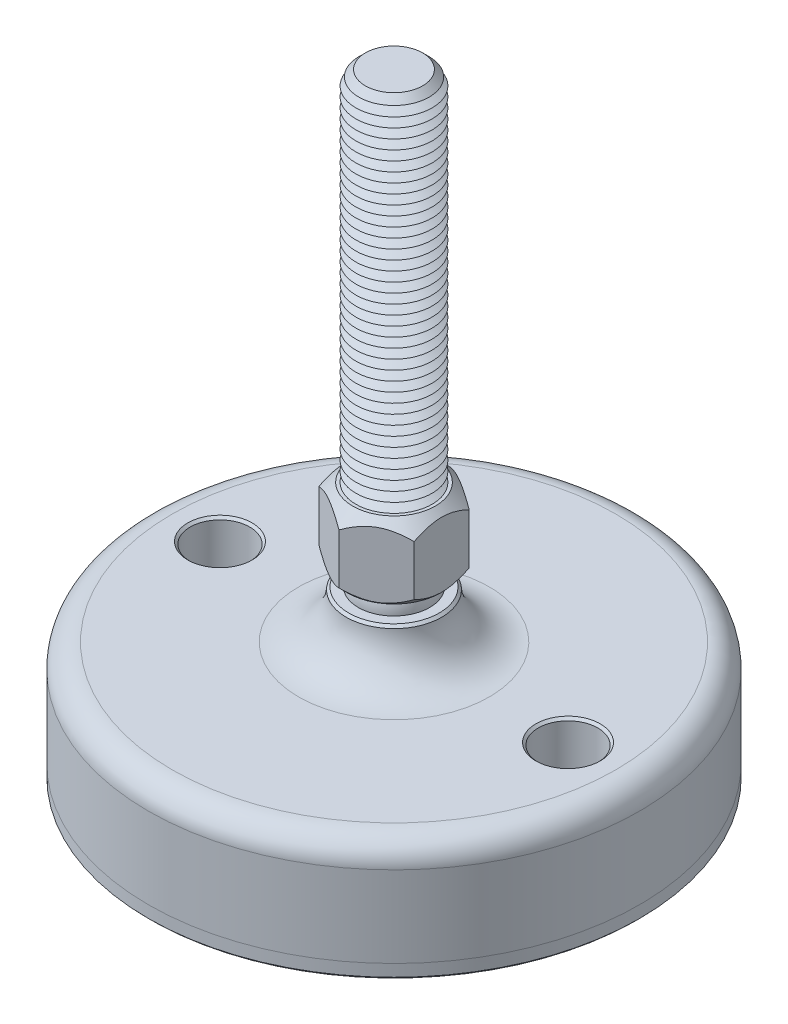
ISO-10303-21;
HEADER;
FILE_DESCRIPTION(('STEP AP214'),'2;1');
FILE_NAME('part.step','',(''),(''),'','','');
FILE_SCHEMA(('AUTOMOTIVE_DESIGN { 1 0 10303 214 1 1 1 1 }'));
ENDSEC;
DATA;
#1=APPLICATION_CONTEXT('core data for automotive mechanical design processes');
#2=APPLICATION_PROTOCOL_DEFINITION('international standard','automotive_design',2000,#1);
#3=PRODUCT_CONTEXT('',#1,'mechanical');
#4=PRODUCT('Part','Part','',(#3));
#5=PRODUCT_RELATED_PRODUCT_CATEGORY('part','',(#4));
#6=PRODUCT_DEFINITION_FORMATION('','',#4);
#7=PRODUCT_DEFINITION_CONTEXT('part definition',#1,'design');
#8=PRODUCT_DEFINITION('design','',#6,#7);
#9=PRODUCT_DEFINITION_SHAPE('','',#8);
#10=(LENGTH_UNIT() NAMED_UNIT(*) SI_UNIT(.MILLI.,.METRE.));
#11=(NAMED_UNIT(*) PLANE_ANGLE_UNIT() SI_UNIT($,.RADIAN.));
#12=(NAMED_UNIT(*) SI_UNIT($,.STERADIAN.) SOLID_ANGLE_UNIT());
#13=UNCERTAINTY_MEASURE_WITH_UNIT(LENGTH_MEASURE(1.E-05),#10,'distance_accuracy_value','');
#14=(GEOMETRIC_REPRESENTATION_CONTEXT(3) GLOBAL_UNCERTAINTY_ASSIGNED_CONTEXT((#13)) GLOBAL_UNIT_ASSIGNED_CONTEXT((#10,
#11,#12)) REPRESENTATION_CONTEXT('',''));
#15=CARTESIAN_POINT('',(0.,0.,0.));
#16=DIRECTION('',(0.,0.,1.));
#17=DIRECTION('',(1.,0.,0.));
#18=AXIS2_PLACEMENT_3D('',#15,#16,#17);
#19=CARTESIAN_POINT('',(0.,-32.,0.));
#20=DIRECTION('',(0.,1.,0.));
#21=DIRECTION('',(0.,0.,1.));
#22=AXIS2_PLACEMENT_3D('',#19,#20,#21);
#23=PLANE('',#22);
#24=CARTESIAN_POINT('',(-36.5,-32.,0.));
#25=DIRECTION('',(0.,1.,0.));
#26=DIRECTION('',(0.,0.,1.));
#27=AXIS2_PLACEMENT_3D('',#24,#25,#26);
#28=CIRCLE('',#27,6.25);
#29=CARTESIAN_POINT('',(-36.5,-32.,6.25));
#30=VERTEX_POINT('',#29);
#31=EDGE_CURVE('P0_E43',#30,#30,#28,.T.);
#32=ORIENTED_EDGE('',*,*,#31,.F.);
#33=EDGE_LOOP('',(#32));
#34=FACE_BOUND('',#33,.T.);
#35=CARTESIAN_POINT('',(36.5,-32.,0.));
#36=DIRECTION('',(0.,1.,0.));
#37=DIRECTION('',(0.,0.,1.));
#38=AXIS2_PLACEMENT_3D('',#35,#36,#37);
#39=CIRCLE('',#38,6.25);
#40=CARTESIAN_POINT('',(36.5,-32.,6.25));
#41=VERTEX_POINT('',#40);
#42=EDGE_CURVE('P0_E44',#41,#41,#39,.T.);
#43=ORIENTED_EDGE('',*,*,#42,.F.);
#44=EDGE_LOOP('',(#43));
#45=FACE_BOUND('',#44,.T.);
#46=CARTESIAN_POINT('',(0.,-32.,0.));
#47=DIRECTION('',(0.,1.,0.));
#48=DIRECTION('',(0.,0.,1.));
#49=AXIS2_PLACEMENT_3D('',#46,#47,#48);
#50=CIRCLE('',#49,51.5);
#51=CARTESIAN_POINT('',(0.,-32.,51.5));
#52=VERTEX_POINT('',#51);
#53=EDGE_CURVE('P0_E40',#52,#52,#50,.T.);
#54=ORIENTED_EDGE('',*,*,#53,.T.);
#55=EDGE_LOOP('',(#54));
#56=FACE_BOUND('',#55,.T.);
#57=ADVANCED_FACE('P0_F14',(#34,#45,#56),#23,.T.);
#58=CARTESIAN_POINT('',(0.,43.1654938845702,0.));
#59=DIRECTION('',(0.,1.,0.));
#60=DIRECTION('',(0.,0.,1.));
#61=AXIS2_PLACEMENT_3D('',#58,#59,#60);
#62=CYLINDRICAL_SURFACE('',#61,51.5);
#63=CARTESIAN_POINT('',(0.,-34.5,0.));
#64=DIRECTION('',(0.,-1.,0.));
#65=DIRECTION('',(0.,0.,-1.));
#66=AXIS2_PLACEMENT_3D('',#63,#64,#65);
#67=CIRCLE('',#66,51.5);
#68=CARTESIAN_POINT('',(0.,-34.5,-51.5));
#69=VERTEX_POINT('',#68);
#70=EDGE_CURVE('P0_E37',#69,#69,#67,.F.);
#71=ORIENTED_EDGE('',*,*,#70,.T.);
#72=EDGE_LOOP('',(#71));
#73=FACE_BOUND('',#72,.T.);
#74=ORIENTED_EDGE('',*,*,#53,.F.);
#75=EDGE_LOOP('',(#74));
#76=FACE_BOUND('',#75,.T.);
#77=ADVANCED_FACE('P0_F54',(#73,#76),#62,.T.);
#78=CARTESIAN_POINT('',(0.,-35.,51.5));
#79=DIRECTION('',(0.,-1.,0.));
#80=DIRECTION('',(0.,0.,-1.));
#81=AXIS2_PLACEMENT_3D('',#78,#79,#80);
#82=PLANE('',#81);
#83=CARTESIAN_POINT('',(36.5,-35.,0.));
#84=DIRECTION('',(0.,-1.,0.));
#85=DIRECTION('',(0.,0.,-1.));
#86=AXIS2_PLACEMENT_3D('',#83,#84,#85);
#87=CIRCLE('',#86,6.75000000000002);
#88=CARTESIAN_POINT('',(36.5,-35.,-6.75000000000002));
#89=VERTEX_POINT('',#88);
#90=EDGE_CURVE('P0_E25',#89,#89,#87,.F.);
#91=ORIENTED_EDGE('',*,*,#90,.T.);
#92=EDGE_LOOP('',(#91));
#93=FACE_BOUND('',#92,.T.);
#94=CARTESIAN_POINT('',(-36.5,-35.,0.));
#95=DIRECTION('',(0.,-1.,0.));
#96=DIRECTION('',(0.,0.,-1.));
#97=AXIS2_PLACEMENT_3D('',#94,#95,#96);
#98=CIRCLE('',#97,6.74999999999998);
#99=CARTESIAN_POINT('',(-36.5,-35.,-6.74999999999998));
#100=VERTEX_POINT('',#99);
#101=EDGE_CURVE('P0_E29',#100,#100,#98,.F.);
#102=ORIENTED_EDGE('',*,*,#101,.T.);
#103=EDGE_LOOP('',(#102));
#104=FACE_BOUND('',#103,.T.);
#105=CARTESIAN_POINT('',(0.,-35.,0.));
#106=DIRECTION('',(0.,-1.,0.));
#107=DIRECTION('',(0.,0.,-1.));
#108=AXIS2_PLACEMENT_3D('',#105,#106,#107);
#109=CIRCLE('',#108,51.);
#110=CARTESIAN_POINT('',(0.,-35.,-51.));
#111=VERTEX_POINT('',#110);
#112=EDGE_CURVE('P0_E34',#111,#111,#109,.T.);
#113=ORIENTED_EDGE('',*,*,#112,.T.);
#114=EDGE_LOOP('',(#113));
#115=FACE_BOUND('',#114,.T.);
#116=ADVANCED_FACE('P0_F61',(#93,#104,#115),#82,.T.);
#117=CARTESIAN_POINT('',(0.,-34.5,0.));
#118=DIRECTION('',(0.,1.,0.));
#119=DIRECTION('',(0.,0.,1.));
#120=AXIS2_PLACEMENT_3D('',#117,#118,#119);
#121=CONICAL_SURFACE('',#120,51.5,0.785398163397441);
#122=ORIENTED_EDGE('',*,*,#112,.F.);
#123=EDGE_LOOP('',(#122));
#124=FACE_BOUND('',#123,.T.);
#125=ORIENTED_EDGE('',*,*,#70,.F.);
#126=EDGE_LOOP('',(#125));
#127=FACE_BOUND('',#126,.T.);
#128=ADVANCED_FACE('P0_F68',(#124,#127),#121,.T.);
#129=CARTESIAN_POINT('',(36.5,-35.,0.));
#130=DIRECTION('',(0.,1.,0.));
#131=DIRECTION('',(0.,0.,1.));
#132=AXIS2_PLACEMENT_3D('',#129,#130,#131);
#133=CYLINDRICAL_SURFACE('',#132,6.25);
#134=CARTESIAN_POINT('',(36.5,-34.5,0.));
#135=DIRECTION('',(0.,-1.,0.));
#136=DIRECTION('',(0.,0.,-1.));
#137=AXIS2_PLACEMENT_3D('',#134,#135,#136);
#138=CIRCLE('',#137,6.25);
#139=CARTESIAN_POINT('',(36.5,-34.5,-6.25));
#140=VERTEX_POINT('',#139);
#141=EDGE_CURVE('P0_E21',#140,#140,#138,.T.);
#142=ORIENTED_EDGE('',*,*,#141,.T.);
#143=EDGE_LOOP('',(#142));
#144=FACE_BOUND('',#143,.T.);
#145=ORIENTED_EDGE('',*,*,#42,.T.);
#146=EDGE_LOOP('',(#145));
#147=FACE_BOUND('',#146,.T.);
#148=ADVANCED_FACE('P0_F74',(#144,#147),#133,.F.);
#149=CARTESIAN_POINT('',(-36.5,-35.,0.));
#150=DIRECTION('',(0.,1.,0.));
#151=DIRECTION('',(0.,0.,1.));
#152=AXIS2_PLACEMENT_3D('',#149,#150,#151);
#153=CYLINDRICAL_SURFACE('',#152,6.25);
#154=CARTESIAN_POINT('',(-36.5,-34.5,0.));
#155=DIRECTION('',(0.,-1.,0.));
#156=DIRECTION('',(0.,0.,-1.));
#157=AXIS2_PLACEMENT_3D('',#154,#155,#156);
#158=CIRCLE('',#157,6.25);
#159=CARTESIAN_POINT('',(-36.5,-34.5,-6.25));
#160=VERTEX_POINT('',#159);
#161=EDGE_CURVE('P0_E10',#160,#160,#158,.T.);
#162=ORIENTED_EDGE('',*,*,#161,.T.);
#163=EDGE_LOOP('',(#162));
#164=FACE_BOUND('',#163,.T.);
#165=ORIENTED_EDGE('',*,*,#31,.T.);
#166=EDGE_LOOP('',(#165));
#167=FACE_BOUND('',#166,.T.);
#168=ADVANCED_FACE('P0_F50',(#164,#167),#153,.F.);
#169=CARTESIAN_POINT('',(36.5,-35.,0.));
#170=DIRECTION('',(0.,-1.,0.));
#171=DIRECTION('',(0.,0.,-1.));
#172=AXIS2_PLACEMENT_3D('',#169,#170,#171);
#173=CONICAL_SURFACE('',#172,6.75000000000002,0.785398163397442);
#174=ORIENTED_EDGE('',*,*,#141,.F.);
#175=EDGE_LOOP('',(#174));
#176=FACE_BOUND('',#175,.T.);
#177=ORIENTED_EDGE('',*,*,#90,.F.);
#178=EDGE_LOOP('',(#177));
#179=FACE_BOUND('',#178,.T.);
#180=ADVANCED_FACE('P0_F76',(#176,#179),#173,.F.);
#181=CARTESIAN_POINT('',(-36.5,-35.,0.));
#182=DIRECTION('',(0.,-1.,0.));
#183=DIRECTION('',(0.,0.,-1.));
#184=AXIS2_PLACEMENT_3D('',#181,#182,#183);
#185=CONICAL_SURFACE('',#184,6.74999999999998,0.785398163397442);
#186=ORIENTED_EDGE('',*,*,#161,.F.);
#187=EDGE_LOOP('',(#186));
#188=FACE_BOUND('',#187,.T.);
#189=ORIENTED_EDGE('',*,*,#101,.F.);
#190=EDGE_LOOP('',(#189));
#191=FACE_BOUND('',#190,.T.);
#192=ADVANCED_FACE('P0_F16',(#188,#191),#185,.F.);
#193=CLOSED_SHELL('',(#57,#77,#116,#128,#148,#168,#180,#192));
#194=MANIFOLD_SOLID_BREP('P0_B1',#193);
#195=CARTESIAN_POINT('',(0.,3.75,0.));
#196=DIRECTION('',(0.,1.,0.));
#197=DIRECTION('',(0.,0.,1.));
#198=AXIS2_PLACEMENT_3D('',#195,#196,#197);
#199=PLANE('',#198);
#200=CARTESIAN_POINT('',(0.,3.75,0.));
#201=DIRECTION('',(0.,1.,0.));
#202=DIRECTION('',(0.,0.,1.));
#203=AXIS2_PLACEMENT_3D('',#200,#201,#202);
#204=CIRCLE('',#203,9.72829454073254);
#205=CARTESIAN_POINT('',(0.,3.75,9.72829454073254));
#206=VERTEX_POINT('',#205);
#207=EDGE_CURVE('P1_E223',#206,#206,#204,.T.);
#208=ORIENTED_EDGE('',*,*,#207,.F.);
#209=EDGE_LOOP('',(#208));
#210=FACE_BOUND('',#209,.T.);
#211=CARTESIAN_POINT('',(0.,3.75,0.));
#212=DIRECTION('',(0.,1.,0.));
#213=DIRECTION('',(0.,0.,1.));
#214=AXIS2_PLACEMENT_3D('',#211,#212,#213);
#215=CIRCLE('',#214,6.49519052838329);
#216=CARTESIAN_POINT('',(0.,3.75,6.49519052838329));
#217=VERTEX_POINT('',#216);
#218=EDGE_CURVE('P1_E25',#217,#217,#215,.F.);
#219=ORIENTED_EDGE('',*,*,#218,.F.);
#220=EDGE_LOOP('',(#219));
#221=FACE_BOUND('',#220,.T.);
#222=ADVANCED_FACE('P1_F16',(#210,#221),#199,.F.);
#223=CARTESIAN_POINT('',(0.,0.,0.));
#224=DIRECTION('',(0.,1.,0.));
#225=DIRECTION('',(0.,0.,-1.));
#226=AXIS2_PLACEMENT_3D('',#223,#224,#225);
#227=SPHERICAL_SURFACE('',#226,7.5);
#228=ORIENTED_EDGE('',*,*,#218,.T.);
#229=EDGE_LOOP('',(#228));
#230=FACE_BOUND('',#229,.T.);
#231=ADVANCED_FACE('P1_F205',(#230),#227,.T.);
#232=CARTESIAN_POINT('',(0.,3.75,0.));
#233=DIRECTION('',(0.,1.,0.));
#234=DIRECTION('',(0.,0.,1.));
#235=AXIS2_PLACEMENT_3D('',#232,#233,#234);
#236=CONICAL_SURFACE('',#235,9.72829454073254,0.785398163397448);
#237=ORIENTED_EDGE('',*,*,#207,.T.);
#238=EDGE_LOOP('',(#237));
#239=FACE_BOUND('',#238,.T.);
#240=CARTESIAN_POINT('',(-10.,9.59571642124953,-11.9394228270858));
#241=CARTESIAN_POINT('',(-10.,9.37430561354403,-11.6505452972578));
#242=CARTESIAN_POINT('',(-10.,9.15490936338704,-11.3600988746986));
#243=CARTESIAN_POINT('',(-10.,8.72106267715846,-10.7754314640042));
#244=CARTESIAN_POINT('',(-10.,8.50661343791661,-10.4812095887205));
#245=CARTESIAN_POINT('',(-10.,8.08205114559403,-9.88620330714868));
#246=CARTESIAN_POINT('',(-10.,7.87198437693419,-9.58538576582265));
#247=CARTESIAN_POINT('',(-10.,7.45926520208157,-8.97872312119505));
#248=CARTESIAN_POINT('',(-10.,7.25661228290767,-8.67287836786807));
#249=CARTESIAN_POINT('',(-10.,6.84809543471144,-8.03614350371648));
#250=CARTESIAN_POINT('',(-10.,6.64281401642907,-7.70487777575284));
#251=CARTESIAN_POINT('',(-10.,6.245142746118,-7.03457466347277));
#252=CARTESIAN_POINT('',(-10.,6.0527550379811,-6.69553599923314));
#253=CARTESIAN_POINT('',(-10.,5.68497951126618,-6.00961937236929));
#254=CARTESIAN_POINT('',(-10.,5.50954176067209,-5.66276839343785));
#255=CARTESIAN_POINT('',(-10.,5.17959635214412,-4.95932933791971));
#256=CARTESIAN_POINT('',(-10.,5.02507889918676,-4.60274591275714));
#257=CARTESIAN_POINT('',(-10.,4.75599518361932,-3.91353381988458));
#258=CARTESIAN_POINT('',(-10.,4.63902686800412,-3.58185263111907));
#259=CARTESIAN_POINT('',(-10.,4.43164927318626,-2.91013341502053));
#260=CARTESIAN_POINT('',(-10.,4.34124171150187,-2.57009484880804));
#261=CARTESIAN_POINT('',(-10.,4.19334931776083,-1.88955843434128));
#262=CARTESIAN_POINT('',(-10.,4.13527351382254,-1.54919119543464));
#263=CARTESIAN_POINT('',(-10.,4.05324021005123,-0.864347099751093));
#264=CARTESIAN_POINT('',(-10.,4.029275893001,-0.519871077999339));
#265=CARTESIAN_POINT('',(-10.,4.01745435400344,0.155191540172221));
#266=CARTESIAN_POINT('',(-10.,4.02812008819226,0.485752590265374));
#267=CARTESIAN_POINT('',(-10.,4.08160326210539,1.1442457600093));
#268=CARTESIAN_POINT('',(-10.,4.12442366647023,1.47217763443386));
#269=CARTESIAN_POINT('',(-10.,4.24054019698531,2.12859326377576));
#270=CARTESIAN_POINT('',(-10.,4.31437036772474,2.45698095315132));
#271=CARTESIAN_POINT('',(-10.,4.48844287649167,3.10654175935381));
#272=CARTESIAN_POINT('',(-10.,4.58868356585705,3.42771532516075));
#273=CARTESIAN_POINT('',(-10.,4.81839210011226,4.08271396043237));
#274=CARTESIAN_POINT('',(-10.,4.94932842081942,4.41601827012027));
#275=CARTESIAN_POINT('',(-10.,5.23140828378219,5.07403931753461));
#276=CARTESIAN_POINT('',(-10.,5.38256099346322,5.3987520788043));
#277=CARTESIAN_POINT('',(-10.,5.70148727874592,6.04113299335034));
#278=CARTESIAN_POINT('',(-10.,5.86931223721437,6.35877542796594));
#279=CARTESIAN_POINT('',(-10.,6.21788686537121,6.98677627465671));
#280=CARTESIAN_POINT('',(-10.,6.39863453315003,7.29713580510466));
#281=CARTESIAN_POINT('',(-10.,6.76133545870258,7.89633938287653));
#282=CARTESIAN_POINT('',(-10.,6.94278731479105,8.18548854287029));
#283=CARTESIAN_POINT('',(-10.,7.31339871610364,8.75881961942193));
#284=CARTESIAN_POINT('',(-10.,7.50255884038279,9.04300116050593));
#285=CARTESIAN_POINT('',(-10.,7.8856676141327,9.6047584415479));
#286=CARTESIAN_POINT('',(-10.,8.07956548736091,9.88236893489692));
#287=CARTESIAN_POINT('',(-10.,8.47254700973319,10.4337838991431));
#288=CARTESIAN_POINT('',(-10.,8.67162921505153,10.7075893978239));
#289=CARTESIAN_POINT('',(-10.,8.87283307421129,10.9797992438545));
#290=B_SPLINE_CURVE_WITH_KNOTS('',3,(#240,#241,#242,#243,#244,#245,#246,#247,#248,#249,#250,
#251,#252,#253,#254,#255,#256,#257,#258,#259,#260,#261,#262,#263,#264,#265,#266,#267,#268,#269,
#270,#271,#272,#273,#274,#275,#276,#277,#278,#279,#280,#281,#282,#283,#284,#285,#286,#287,#288,
#289),.UNSPECIFIED.,.F.,.F.,(4,2,2,2,2,2,2,2,2,2,2,2,2,2,2,2,2,2,2,2,2,2,2,2,4),(0.,
1.09192545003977,2.18411235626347,3.28473497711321,4.3852812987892,5.5541916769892,
6.72329593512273,7.88884387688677,9.05384420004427,10.1080362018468,11.1622963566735,
12.1965943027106,13.2306855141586,14.2212593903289,15.2119246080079,16.2203997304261,
17.2288119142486,18.3022883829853,19.3762532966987,20.4536373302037,21.5308548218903,
22.5548150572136,23.5788523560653,24.5946500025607,25.6101677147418),.UNSPECIFIED.);
#291=CARTESIAN_POINT('',(-10.,5.56871084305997,-5.77350269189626));
#292=VERTEX_POINT('',#291);
#293=CARTESIAN_POINT('',(-10.,5.56871084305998,5.77350269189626));
#294=VERTEX_POINT('',#293);
#295=EDGE_CURVE('P1_E188',#292,#294,#290,.T.);
#296=ORIENTED_EDGE('',*,*,#295,.F.);
#297=CARTESIAN_POINT('',(0.000199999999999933,5.56882631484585,-11.5471208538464));
#298=CARTESIAN_POINT('',(-0.171722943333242,5.4695807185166,-11.447861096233));
#299=CARTESIAN_POINT('',(-0.344992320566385,5.37336355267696,-11.3478239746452));
#300=CARTESIAN_POINT('',(-0.694433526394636,5.18794806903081,-11.1460740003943));
#301=CARTESIAN_POINT('',(-0.870606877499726,5.09875358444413,-11.0443602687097));
#302=CARTESIAN_POINT('',(-1.22689656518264,4.92796770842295,-10.8386563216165));
#303=CARTESIAN_POINT('',(-1.40702970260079,4.84642277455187,-10.7346564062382));
#304=CARTESIAN_POINT('',(-1.77025459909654,4.69270708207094,-10.52494841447));
#305=CARTESIAN_POINT('',(-1.95334590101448,4.62053489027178,-10.4192406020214));
#306=CARTESIAN_POINT('',(-2.31954331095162,4.4878482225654,-10.2078164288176));
#307=CARTESIAN_POINT('',(-2.50260441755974,4.42716910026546,-10.1021260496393));
#308=CARTESIAN_POINT('',(-2.87129282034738,4.31731511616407,-9.88926370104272));
#309=CARTESIAN_POINT('',(-3.05691983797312,4.26813901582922,-9.78209189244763));
#310=CARTESIAN_POINT('',(-3.42994608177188,4.1825291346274,-9.56672509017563));
#311=CARTESIAN_POINT('',(-3.61734032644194,4.14606667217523,-9.45853297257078));
#312=CARTESIAN_POINT('',(-3.99370204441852,4.08668528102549,-9.24124043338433));
#313=CARTESIAN_POINT('',(-4.1826692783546,4.06376432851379,-9.13214015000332));
#314=CARTESIAN_POINT('',(-4.64316633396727,4.0253323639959,-8.86627205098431));
#315=CARTESIAN_POINT('',(-4.91519388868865,4.01726744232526,-8.70921686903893));
#316=CARTESIAN_POINT('',(-5.45875701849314,4.03080424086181,-8.39539054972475));
#317=CARTESIAN_POINT('',(-5.7302923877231,4.05241636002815,-8.23861953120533));
#318=CARTESIAN_POINT('',(-6.27080349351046,4.12403157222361,-7.92655529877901));
#319=CARTESIAN_POINT('',(-6.53977602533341,4.17406641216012,-7.77126393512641));
#320=CARTESIAN_POINT('',(-7.07309796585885,4.29980733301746,-7.46335036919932));
#321=CARTESIAN_POINT('',(-7.33744772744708,4.3755114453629,-7.31072796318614));
#322=CARTESIAN_POINT('',(-7.80670351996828,4.53125365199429,-7.03980300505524));
#323=CARTESIAN_POINT('',(-8.01264886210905,4.60719488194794,-6.92090040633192));
#324=CARTESIAN_POINT('',(-8.42084280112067,4.77131434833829,-6.68522952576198));
#325=CARTESIAN_POINT('',(-8.62309128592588,4.85949295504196,-6.5684613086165));
#326=CARTESIAN_POINT('',(-9.02325448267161,5.04611070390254,-6.33742697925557));
#327=CARTESIAN_POINT('',(-9.22118057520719,5.1445175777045,-6.2231542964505));
#328=CARTESIAN_POINT('',(-9.61336795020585,5.35030005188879,-5.99672480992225));
#329=CARTESIAN_POINT('',(-9.80763139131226,5.45767015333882,-5.88456675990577));
#330=CARTESIAN_POINT('',(-10.0002,5.56882631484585,-5.77338722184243));
#331=B_SPLINE_CURVE_WITH_KNOTS('',3,(#297,#298,#299,#300,#301,#302,#303,#304,#305,#306,#307,
#308,#309,#310,#311,#312,#313,#314,#315,#316,#317,#318,#319,#320,#321,#322,#323,#324,#325,#326,
#327,#328,#329,#330),.UNSPECIFIED.,.F.,.F.,(4,2,2,2,2,2,2,2,2,2,2,2,2,2,2,2,4),(0.,
0.665863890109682,1.33208874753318,2.00212824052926,2.67206515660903,3.33152613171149,
3.99091606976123,4.64880867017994,5.30660292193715,6.24777541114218,7.18927777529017,
8.13183382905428,9.07431761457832,9.82287578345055,10.5714566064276,11.3177436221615,
12.0635761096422),.UNSPECIFIED.);
#332=CARTESIAN_POINT('',(0.,5.56871084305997,-11.5470053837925));
#333=VERTEX_POINT('',#332);
#334=EDGE_CURVE('P1_E182',#333,#292,#331,.T.);
#335=ORIENTED_EDGE('',*,*,#334,.F.);
#336=CARTESIAN_POINT('',(10.0002,5.56882631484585,-5.77338722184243));
#337=CARTESIAN_POINT('',(9.82827705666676,5.4695807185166,-5.87264697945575));
#338=CARTESIAN_POINT('',(9.65500767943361,5.37336355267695,-5.97268410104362));
#339=CARTESIAN_POINT('',(9.30556647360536,5.18794806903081,-6.17443407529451));
#340=CARTESIAN_POINT('',(9.12939312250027,5.09875358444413,-6.27614780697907));
#341=CARTESIAN_POINT('',(8.77310343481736,4.92796770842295,-6.48185175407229));
#342=CARTESIAN_POINT('',(8.59297029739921,4.84642277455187,-6.58585166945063));
#343=CARTESIAN_POINT('',(8.22974540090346,4.69270708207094,-6.79555966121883));
#344=CARTESIAN_POINT('',(8.04665409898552,4.62053489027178,-6.90126747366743));
#345=CARTESIAN_POINT('',(7.68045668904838,4.4878482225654,-7.11269164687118));
#346=CARTESIAN_POINT('',(7.49739558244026,4.42716910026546,-7.21838202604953));
#347=CARTESIAN_POINT('',(7.12870717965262,4.31731511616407,-7.43124437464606));
#348=CARTESIAN_POINT('',(6.94308016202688,4.26813901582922,-7.53841618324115));
#349=CARTESIAN_POINT('',(6.57005391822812,4.1825291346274,-7.75378298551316));
#350=CARTESIAN_POINT('',(6.38265967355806,4.14606667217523,-7.861975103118));
#351=CARTESIAN_POINT('',(6.00629795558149,4.08668528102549,-8.07926764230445));
#352=CARTESIAN_POINT('',(5.81733072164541,4.06376432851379,-8.18836792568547));
#353=CARTESIAN_POINT('',(5.35683366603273,4.0253323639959,-8.45423602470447));
#354=CARTESIAN_POINT('',(5.08480611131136,4.01726744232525,-8.61129120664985));
#355=CARTESIAN_POINT('',(4.54124298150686,4.03080424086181,-8.92511752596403));
#356=CARTESIAN_POINT('',(4.2697076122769,4.05241636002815,-9.08188854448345));
#357=CARTESIAN_POINT('',(3.72919650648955,4.12403157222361,-9.39395277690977));
#358=CARTESIAN_POINT('',(3.46022397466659,4.17406641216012,-9.54924414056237));
#359=CARTESIAN_POINT('',(2.92690203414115,4.29980733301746,-9.85715770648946));
#360=CARTESIAN_POINT('',(2.66255227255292,4.37551144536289,-10.0097801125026));
#361=CARTESIAN_POINT('',(2.19329648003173,4.53125365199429,-10.2807050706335));
#362=CARTESIAN_POINT('',(1.98735113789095,4.60719488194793,-10.3996076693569));
#363=CARTESIAN_POINT('',(1.57915719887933,4.77131434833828,-10.6352785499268));
#364=CARTESIAN_POINT('',(1.37690871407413,4.85949295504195,-10.7520467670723));
#365=CARTESIAN_POINT('',(0.976745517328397,5.04611070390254,-10.9830810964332));
#366=CARTESIAN_POINT('',(0.77881942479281,5.1445175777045,-11.0973537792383));
#367=CARTESIAN_POINT('',(0.386632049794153,5.35030005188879,-11.3237832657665));
#368=CARTESIAN_POINT('',(0.192368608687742,5.45767015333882,-11.435941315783));
#369=CARTESIAN_POINT('',(-0.000199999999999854,5.56882631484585,-11.5471208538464));
#370=B_SPLINE_CURVE_WITH_KNOTS('',3,(#336,#337,#338,#339,#340,#341,#342,#343,#344,#345,#346,
#347,#348,#349,#350,#351,#352,#353,#354,#355,#356,#357,#358,#359,#360,#361,#362,#363,#364,#365,
#366,#367,#368,#369),.UNSPECIFIED.,.F.,.F.,(4,2,2,2,2,2,2,2,2,2,2,2,2,2,2,2,4),(0.,
0.665863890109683,1.33208874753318,2.00212824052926,2.67206515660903,3.33152613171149,
3.99091606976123,4.64880867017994,5.30660292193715,6.24777541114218,7.18927777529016,
8.13183382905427,9.07431761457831,9.82287578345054,10.5714566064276,11.3177436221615,
12.0635761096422),.UNSPECIFIED.);
#371=CARTESIAN_POINT('',(9.99999999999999,5.56871084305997,-5.77350269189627));
#372=VERTEX_POINT('',#371);
#373=EDGE_CURVE('P1_E170',#372,#333,#370,.T.);
#374=ORIENTED_EDGE('',*,*,#373,.F.);
#375=CARTESIAN_POINT('',(10.,9.59571642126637,-11.9394228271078));
#376=CARTESIAN_POINT('',(10.,9.37430561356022,-11.6505452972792));
#377=CARTESIAN_POINT('',(10.,9.15490936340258,-11.3600988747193));
#378=CARTESIAN_POINT('',(10.,8.7210626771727,-10.7754314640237));
#379=CARTESIAN_POINT('',(10.,8.5066134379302,-10.4812095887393));
#380=CARTESIAN_POINT('',(10.,8.08205114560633,-9.88620330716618));
#381=CARTESIAN_POINT('',(10.,7.87198437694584,-9.58538576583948));
#382=CARTESIAN_POINT('',(10.,7.45926520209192,-8.97872312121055));
#383=CARTESIAN_POINT('',(10.,7.25661228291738,-8.67287836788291));
#384=CARTESIAN_POINT('',(10.,6.84809543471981,-8.03614350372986));
#385=CARTESIAN_POINT('',(10.,6.64281401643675,-7.70487777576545));
#386=CARTESIAN_POINT('',(10.,6.24514274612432,-7.03457466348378));
#387=CARTESIAN_POINT('',(10.,6.05275503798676,-6.69553599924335));
#388=CARTESIAN_POINT('',(10.,5.68497951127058,-6.00961937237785));
#389=CARTESIAN_POINT('',(10.,5.50954176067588,-5.66276839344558));
#390=CARTESIAN_POINT('',(10.,5.17959635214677,-4.95932933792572));
#391=CARTESIAN_POINT('',(10.,5.02507889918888,-4.60274591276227));
#392=CARTESIAN_POINT('',(10.,4.75599518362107,-3.91353381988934));
#393=CARTESIAN_POINT('',(10.,4.63902686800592,-3.58185263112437));
#394=CARTESIAN_POINT('',(10.,4.43164927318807,-2.91013341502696));
#395=CARTESIAN_POINT('',(10.,4.34124171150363,-2.57009484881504));
#396=CARTESIAN_POINT('',(10.,4.19334931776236,-1.8895584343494));
#397=CARTESIAN_POINT('',(10.,4.13527351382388,-1.54919119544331));
#398=CARTESIAN_POINT('',(10.,4.05324021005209,-0.86434709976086));
#399=CARTESIAN_POINT('',(10.,4.02927589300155,-0.519871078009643));
#400=CARTESIAN_POINT('',(10.,4.01745435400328,0.155191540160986));
#401=CARTESIAN_POINT('',(10.,4.0281200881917,0.485752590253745));
#402=CARTESIAN_POINT('',(10.,4.08160326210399,1.14424575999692));
#403=CARTESIAN_POINT('',(10.,4.12442366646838,1.47217763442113));
#404=CARTESIAN_POINT('',(10.,4.24054019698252,2.12859326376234));
#405=CARTESIAN_POINT('',(10.,4.31437036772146,2.45698095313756));
#406=CARTESIAN_POINT('',(10.,4.48844287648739,3.1065417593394));
#407=CARTESIAN_POINT('',(10.,4.58868356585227,3.42771532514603));
#408=CARTESIAN_POINT('',(10.,4.81839210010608,4.08271396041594));
#409=CARTESIAN_POINT('',(10.,4.94932842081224,4.41601827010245));
#410=CARTESIAN_POINT('',(10.,5.23140828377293,5.0740393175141));
#411=CARTESIAN_POINT('',(10.,5.38256099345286,5.39875207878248));
#412=CARTESIAN_POINT('',(10.,5.70148727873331,6.04113299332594));
#413=CARTESIAN_POINT('',(10.,5.86931223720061,6.35877542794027));
#414=CARTESIAN_POINT('',(10.,6.21788686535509,6.98677627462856));
#415=CARTESIAN_POINT('',(10.,6.39863453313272,7.29713580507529));
#416=CARTESIAN_POINT('',(10.,6.761335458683,7.89633938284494));
#417=CARTESIAN_POINT('',(10.,6.9427873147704,8.18548854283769));
#418=CARTESIAN_POINT('',(10.,7.31339871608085,8.75881961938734));
#419=CARTESIAN_POINT('',(10.,7.50255884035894,9.04300116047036));
#420=CARTESIAN_POINT('',(10.,7.88566761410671,9.60475844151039));
#421=CARTESIAN_POINT('',(10.,8.07956548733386,9.88236893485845));
#422=CARTESIAN_POINT('',(10.,8.47254700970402,10.4337838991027));
#423=CARTESIAN_POINT('',(10.,8.6716292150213,10.7075893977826));
#424=CARTESIAN_POINT('',(10.,8.87283307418,10.9797992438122));
#425=B_SPLINE_CURVE_WITH_KNOTS('',3,(#375,#376,#377,#378,#379,#380,#381,#382,#383,#384,#385,
#386,#387,#388,#389,#390,#391,#392,#393,#394,#395,#396,#397,#398,#399,#400,#401,#402,#403,#404,
#405,#406,#407,#408,#409,#410,#411,#412,#413,#414,#415,#416,#417,#418,#419,#420,#421,#422,#423,
#424),.UNSPECIFIED.,.F.,.F.,(4,2,2,2,2,2,2,2,2,2,2,2,2,2,2,2,2,2,2,2,2,2,2,2,4),(0.,
1.09192545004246,2.18411235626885,3.28473497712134,4.38528129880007,5.55419167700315,
6.72329593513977,7.88884387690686,9.05384420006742,10.1080362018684,11.1622963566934,
12.196594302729,13.2306855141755,14.2212593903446,15.2119246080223,16.2203997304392,
17.2288119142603,18.3022883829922,19.3762532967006,20.4536373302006,21.5308548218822,
22.5548150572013,23.5788523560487,24.5946500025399,25.6101677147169),.UNSPECIFIED.);
#426=CARTESIAN_POINT('',(10.,5.56871084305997,5.77350269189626));
#427=VERTEX_POINT('',#426);
#428=EDGE_CURVE('P1_E71',#427,#372,#425,.F.);
#429=ORIENTED_EDGE('',*,*,#428,.F.);
#430=CARTESIAN_POINT('',(-0.000200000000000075,5.56882631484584,11.5471208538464));
#431=CARTESIAN_POINT('',(0.171722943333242,5.4695807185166,11.447861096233));
#432=CARTESIAN_POINT('',(0.344992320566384,5.37336355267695,11.3478239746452));
#433=CARTESIAN_POINT('',(0.694433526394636,5.18794806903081,11.1460740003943));
#434=CARTESIAN_POINT('',(0.870606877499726,5.09875358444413,11.0443602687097));
#435=CARTESIAN_POINT('',(1.22689656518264,4.92796770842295,10.8386563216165));
#436=CARTESIAN_POINT('',(1.40702970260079,4.84642277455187,10.7346564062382));
#437=CARTESIAN_POINT('',(1.77025459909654,4.69270708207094,10.52494841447));
#438=CARTESIAN_POINT('',(1.95334590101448,4.62053489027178,10.4192406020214));
#439=CARTESIAN_POINT('',(2.31954331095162,4.4878482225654,10.2078164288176));
#440=CARTESIAN_POINT('',(2.50260441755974,4.42716910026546,10.1021260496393));
#441=CARTESIAN_POINT('',(2.87129282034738,4.31731511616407,9.88926370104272));
#442=CARTESIAN_POINT('',(3.05691983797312,4.26813901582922,9.78209189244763));
#443=CARTESIAN_POINT('',(3.42994608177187,4.18252913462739,9.56672509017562));
#444=CARTESIAN_POINT('',(3.61734032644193,4.14606667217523,9.45853297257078));
#445=CARTESIAN_POINT('',(3.99370204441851,4.08668528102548,9.24124043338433));
#446=CARTESIAN_POINT('',(4.18266927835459,4.06376432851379,9.13214015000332));
#447=CARTESIAN_POINT('',(4.64316633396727,4.0253323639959,8.86627205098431));
#448=CARTESIAN_POINT('',(4.91519388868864,4.01726744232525,8.70921686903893));
#449=CARTESIAN_POINT('',(5.45875701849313,4.03080424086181,8.39539054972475));
#450=CARTESIAN_POINT('',(5.7302923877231,4.05241636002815,8.23861953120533));
#451=CARTESIAN_POINT('',(6.27080349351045,4.1240315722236,7.92655529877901));
#452=CARTESIAN_POINT('',(6.53977602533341,4.17406641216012,7.77126393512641));
#453=CARTESIAN_POINT('',(7.07309796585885,4.29980733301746,7.46335036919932));
#454=CARTESIAN_POINT('',(7.33744772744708,4.37551144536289,7.31072796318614));
#455=CARTESIAN_POINT('',(7.80670351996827,4.53125365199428,7.03980300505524));
#456=CARTESIAN_POINT('',(8.01264886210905,4.60719488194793,6.92090040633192));
#457=CARTESIAN_POINT('',(8.42084280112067,4.77131434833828,6.68522952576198));
#458=CARTESIAN_POINT('',(8.62309128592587,4.85949295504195,6.5684613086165));
#459=CARTESIAN_POINT('',(9.0232544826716,5.04611070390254,6.33742697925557));
#460=CARTESIAN_POINT('',(9.22118057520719,5.1445175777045,6.2231542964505));
#461=CARTESIAN_POINT('',(9.61336795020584,5.35030005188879,5.99672480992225));
#462=CARTESIAN_POINT('',(9.80763139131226,5.45767015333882,5.88456675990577));
#463=CARTESIAN_POINT('',(10.0002,5.56882631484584,5.77338722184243));
#464=B_SPLINE_CURVE_WITH_KNOTS('',3,(#430,#431,#432,#433,#434,#435,#436,#437,#438,#439,#440,
#441,#442,#443,#444,#445,#446,#447,#448,#449,#450,#451,#452,#453,#454,#455,#456,#457,#458,#459,
#460,#461,#462,#463),.UNSPECIFIED.,.F.,.F.,(4,2,2,2,2,2,2,2,2,2,2,2,2,2,2,2,4),(0.,
0.665863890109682,1.33208874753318,2.00212824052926,2.67206515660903,3.33152613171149,
3.99091606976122,4.64880867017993,5.30660292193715,6.24777541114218,7.18927777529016,
8.13183382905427,9.07431761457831,9.82287578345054,10.5714566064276,11.3177436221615,
12.0635761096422),.UNSPECIFIED.);
#465=CARTESIAN_POINT('',(0.,5.56871084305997,11.5470053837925));
#466=VERTEX_POINT('',#465);
#467=EDGE_CURVE('P1_E68',#466,#427,#464,.T.);
#468=ORIENTED_EDGE('',*,*,#467,.F.);
#469=CARTESIAN_POINT('',(-10.0002,5.56882631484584,5.77338722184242));
#470=CARTESIAN_POINT('',(-9.82827705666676,5.4695807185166,5.87264697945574));
#471=CARTESIAN_POINT('',(-9.65500767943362,5.37336355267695,5.97268410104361));
#472=CARTESIAN_POINT('',(-9.30556647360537,5.18794806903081,6.1744340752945));
#473=CARTESIAN_POINT('',(-9.12939312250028,5.09875358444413,6.27614780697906));
#474=CARTESIAN_POINT('',(-8.77310343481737,4.92796770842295,6.48185175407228));
#475=CARTESIAN_POINT('',(-8.59297029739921,4.84642277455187,6.58585166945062));
#476=CARTESIAN_POINT('',(-8.22974540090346,4.69270708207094,6.79555966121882));
#477=CARTESIAN_POINT('',(-8.04665409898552,4.62053489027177,6.90126747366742));
#478=CARTESIAN_POINT('',(-7.68045668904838,4.48784822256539,7.11269164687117));
#479=CARTESIAN_POINT('',(-7.49739558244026,4.42716910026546,7.21838202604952));
#480=CARTESIAN_POINT('',(-7.12870717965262,4.31731511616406,7.43124437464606));
#481=CARTESIAN_POINT('',(-6.94308016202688,4.26813901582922,7.53841618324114));
#482=CARTESIAN_POINT('',(-6.57005391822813,4.18252913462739,7.75378298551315));
#483=CARTESIAN_POINT('',(-6.38265967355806,4.14606667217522,7.861975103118));
#484=CARTESIAN_POINT('',(-6.00629795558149,4.08668528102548,8.07926764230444));
#485=CARTESIAN_POINT('',(-5.81733072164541,4.06376432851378,8.18836792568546));
#486=CARTESIAN_POINT('',(-5.35683366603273,4.0253323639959,8.45423602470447));
#487=CARTESIAN_POINT('',(-5.08480611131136,4.01726744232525,8.61129120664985));
#488=CARTESIAN_POINT('',(-4.54124298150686,4.0308042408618,8.92511752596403));
#489=CARTESIAN_POINT('',(-4.2697076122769,4.05241636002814,9.08188854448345));
#490=CARTESIAN_POINT('',(-3.72919650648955,4.1240315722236,9.39395277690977));
#491=CARTESIAN_POINT('',(-3.46022397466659,4.17406641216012,9.54924414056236));
#492=CARTESIAN_POINT('',(-2.92690203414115,4.29980733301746,9.85715770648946));
#493=CARTESIAN_POINT('',(-2.66255227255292,4.37551144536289,10.0097801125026));
#494=CARTESIAN_POINT('',(-2.19329648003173,4.53125365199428,10.2807050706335));
#495=CARTESIAN_POINT('',(-1.98735113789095,4.60719488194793,10.3996076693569));
#496=CARTESIAN_POINT('',(-1.57915719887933,4.77131434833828,10.6352785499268));
#497=CARTESIAN_POINT('',(-1.37690871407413,4.85949295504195,10.7520467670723));
#498=CARTESIAN_POINT('',(-0.976745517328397,5.04611070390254,10.9830810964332));
#499=CARTESIAN_POINT('',(-0.778819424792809,5.1445175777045,11.0973537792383));
#500=CARTESIAN_POINT('',(-0.386632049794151,5.35030005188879,11.3237832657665));
#501=CARTESIAN_POINT('',(-0.192368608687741,5.45767015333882,11.435941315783));
#502=CARTESIAN_POINT('',(0.000199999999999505,5.56882631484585,11.5471208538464));
#503=B_SPLINE_CURVE_WITH_KNOTS('',3,(#469,#470,#471,#472,#473,#474,#475,#476,#477,#478,#479,
#480,#481,#482,#483,#484,#485,#486,#487,#488,#489,#490,#491,#492,#493,#494,#495,#496,#497,#498,
#499,#500,#501,#502),.UNSPECIFIED.,.F.,.F.,(4,2,2,2,2,2,2,2,2,2,2,2,2,2,2,2,4),(0.,
0.665863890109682,1.33208874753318,2.00212824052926,2.67206515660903,3.33152613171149,
3.99091606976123,4.64880867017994,5.30660292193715,6.24777541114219,7.18927777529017,
8.13183382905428,9.07431761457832,9.82287578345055,10.5714566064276,11.3177436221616,
12.0635761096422),.UNSPECIFIED.);
#504=EDGE_CURVE('P1_E40',#294,#466,#503,.T.);
#505=ORIENTED_EDGE('',*,*,#504,.F.);
#506=EDGE_LOOP('',(#296,#335,#374,#429,#468,#505));
#507=FACE_BOUND('',#506,.T.);
#508=ADVANCED_FACE('P1_F69',(#239,#507),#236,.T.);
#509=CARTESIAN_POINT('',(-10.,19.,-5.77350269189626));
#510=DIRECTION('',(1.,0.,0.));
#511=DIRECTION('',(0.,0.,-1.));
#512=AXIS2_PLACEMENT_3D('',#509,#510,#511);
#513=PLANE('',#512);
#514=DIRECTION('',(0.,-1.,0.));
#515=VECTOR('',#514,1.);
#516=CARTESIAN_POINT('',(-10.,19.,5.77350269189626));
#517=LINE('',#516,#515);
#518=CARTESIAN_POINT('',(-10.,16.1132486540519,5.77350269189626));
#519=VERTEX_POINT('',#518);
#520=EDGE_CURVE('P1_E84',#519,#294,#517,.T.);
#521=ORIENTED_EDGE('',*,*,#520,.F.);
#522=CARTESIAN_POINT('',(-10.,12.4093918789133,-11.5147208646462));
#523=CARTESIAN_POINT('',(-10.,12.6210295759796,-11.2343500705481));
#524=CARTESIAN_POINT('',(-10.,12.8306215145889,-10.9524094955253));
#525=CARTESIAN_POINT('',(-10.,13.2447979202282,-10.3847695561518));
#526=CARTESIAN_POINT('',(-10.,13.4493811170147,-10.0990692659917));
#527=CARTESIAN_POINT('',(-10.,13.8540786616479,-9.52120077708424));
#528=CARTESIAN_POINT('',(-10.,14.0541461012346,-9.22899961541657));
#529=CARTESIAN_POINT('',(-10.,14.4468132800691,-8.63963749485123));
#530=CARTESIAN_POINT('',(-10.,14.6394135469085,-8.34247688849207));
#531=CARTESIAN_POINT('',(-10.,15.0262335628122,-7.72525702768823));
#532=CARTESIAN_POINT('',(-10.,15.2199166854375,-7.40485974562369));
#533=CARTESIAN_POINT('',(-10.,15.5945399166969,-6.75658646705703));
#534=CARTESIAN_POINT('',(-10.,15.7754780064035,-6.4287092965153));
#535=CARTESIAN_POINT('',(-10.,16.1207071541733,-5.76550673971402));
#536=CARTESIAN_POINT('',(-10.,16.285047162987,-5.43020703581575));
#537=CARTESIAN_POINT('',(-10.,16.5934011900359,-4.75046311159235));
#538=CARTESIAN_POINT('',(-10.,16.7374244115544,-4.40602311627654));
#539=CARTESIAN_POINT('',(-10.,16.9894496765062,-3.73558113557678));
#540=CARTESIAN_POINT('',(-10.,17.0994177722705,-3.41032595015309));
#541=CARTESIAN_POINT('',(-10.,17.2932601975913,-2.75198473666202));
#542=CARTESIAN_POINT('',(-10.,17.377132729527,-2.4188981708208));
#543=CARTESIAN_POINT('',(-10.,17.5130086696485,-1.7524231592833));
#544=CARTESIAN_POINT('',(-10.,17.565558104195,-1.41914787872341));
#545=CARTESIAN_POINT('',(-10.,17.6377678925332,-0.749034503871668));
#546=CARTESIAN_POINT('',(-10.,17.6574338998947,-0.412197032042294));
#547=CARTESIAN_POINT('',(-10.,17.6624162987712,0.249527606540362));
#548=CARTESIAN_POINT('',(-10.,17.6489502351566,0.574406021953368));
#549=CARTESIAN_POINT('',(-10.,17.5910984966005,1.22138001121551));
#550=CARTESIAN_POINT('',(-10.,17.5467098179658,1.54347531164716));
#551=CARTESIAN_POINT('',(-10.,17.4286795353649,2.18799750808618));
#552=CARTESIAN_POINT('',(-10.,17.3545401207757,2.51033177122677));
#553=CARTESIAN_POINT('',(-10.,17.180962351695,3.14797698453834));
#554=CARTESIAN_POINT('',(-10.,17.0815261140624,3.46328851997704));
#555=CARTESIAN_POINT('',(-10.,16.8512186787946,4.11544298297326));
#556=CARTESIAN_POINT('',(-10.,16.7182795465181,4.45154819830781));
#557=CARTESIAN_POINT('',(-10.,16.431992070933,5.115028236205));
#558=CARTESIAN_POINT('',(-10.,16.2786342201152,5.4423989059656));
#559=CARTESIAN_POINT('',(-10.,15.9551580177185,6.09000973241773));
#560=CARTESIAN_POINT('',(-10.,15.7849870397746,6.41022338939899));
#561=CARTESIAN_POINT('',(-10.,15.4316458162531,7.04328175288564));
#562=CARTESIAN_POINT('',(-10.,15.2484776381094,7.35612762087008));
#563=CARTESIAN_POINT('',(-10.,14.8810750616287,7.96002022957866));
#564=CARTESIAN_POINT('',(-10.,14.6973474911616,8.25137695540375));
#565=CARTESIAN_POINT('',(-10.,14.3221662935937,8.82908851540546));
#566=CARTESIAN_POINT('',(-10.,14.1307120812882,9.1154429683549));
#567=CARTESIAN_POINT('',(-10.,13.7430400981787,9.68148259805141));
#568=CARTESIAN_POINT('',(-10.,13.5468736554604,9.96120305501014));
#569=CARTESIAN_POINT('',(-10.,13.149353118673,10.5168212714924));
#570=CARTESIAN_POINT('',(-10.,12.9480004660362,10.7927200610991));
#571=CARTESIAN_POINT('',(-10.,12.7445274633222,11.0670185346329));
#572=B_SPLINE_CURVE_WITH_KNOTS('',3,(#522,#523,#524,#525,#526,#527,#528,#529,#530,#531,#532,
#533,#534,#535,#536,#537,#538,#539,#540,#541,#542,#543,#544,#545,#546,#547,#548,#549,#550,#551,
#552,#553,#554,#555,#556,#557,#558,#559,#560,#561,#562,#563,#564,#565,#566,#567,#568,#569,#570,
#571),.UNSPECIFIED.,.F.,.F.,(4,2,2,2,2,2,2,2,2,2,2,2,2,2,2,2,2,2,2,2,2,2,2,2,4),(0.,
1.05386365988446,2.10799187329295,3.17028777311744,4.23250847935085,5.35544154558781,
6.47855209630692,7.5982472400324,8.71743353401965,9.74655549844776,10.7757483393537,
11.7864315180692,12.7969409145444,13.7708741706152,14.7449020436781,15.7359570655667,
16.7269291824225,17.8104078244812,18.8943927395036,19.981885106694,21.0692048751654,
22.1024062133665,23.1356859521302,24.1605722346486,25.1851766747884),.UNSPECIFIED.);
#573=CARTESIAN_POINT('',(-10.,16.1132486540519,-5.77350269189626));
#574=VERTEX_POINT('',#573);
#575=EDGE_CURVE('P1_E85',#519,#574,#572,.F.);
#576=ORIENTED_EDGE('',*,*,#575,.T.);
#577=DIRECTION('',(0.,-1.,0.));
#578=VECTOR('',#577,1.);
#579=CARTESIAN_POINT('',(-10.,19.,-5.77350269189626));
#580=LINE('',#579,#578);
#581=EDGE_CURVE('P1_E102',#574,#292,#580,.T.);
#582=ORIENTED_EDGE('',*,*,#581,.T.);
#583=ORIENTED_EDGE('',*,*,#295,.T.);
#584=EDGE_LOOP('',(#521,#576,#582,#583));
#585=FACE_BOUND('',#584,.T.);
#586=ADVANCED_FACE('P1_F196',(#585),#513,.F.);
#587=CARTESIAN_POINT('',(0.,19.,-11.5470053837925));
#588=DIRECTION('',(0.5,0.,0.866025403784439));
#589=DIRECTION('',(0.866025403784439,0.,-0.5));
#590=AXIS2_PLACEMENT_3D('',#587,#588,#589);
#591=PLANE('',#590);
#592=ORIENTED_EDGE('',*,*,#581,.F.);
#593=CARTESIAN_POINT('',(-10.0002,16.113133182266,-5.77338722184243));
#594=CARTESIAN_POINT('',(-9.82827705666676,16.2123787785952,-5.87264697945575));
#595=CARTESIAN_POINT('',(-9.65500767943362,16.3085959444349,-5.97268410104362));
#596=CARTESIAN_POINT('',(-9.30556647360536,16.494011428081,-6.17443407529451));
#597=CARTESIAN_POINT('',(-9.12939312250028,16.5832059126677,-6.27614780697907));
#598=CARTESIAN_POINT('',(-8.77310343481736,16.7539917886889,-6.48185175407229));
#599=CARTESIAN_POINT('',(-8.59297029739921,16.83553672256,-6.58585166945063));
#600=CARTESIAN_POINT('',(-8.22974540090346,16.9892524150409,-6.79555966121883));
#601=CARTESIAN_POINT('',(-8.04665409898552,17.0614246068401,-6.90126747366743));
#602=CARTESIAN_POINT('',(-7.68045668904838,17.1941112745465,-7.11269164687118));
#603=CARTESIAN_POINT('',(-7.49739558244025,17.2547903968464,-7.21838202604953));
#604=CARTESIAN_POINT('',(-7.12870717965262,17.3646443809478,-7.43124437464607));
#605=CARTESIAN_POINT('',(-6.94308016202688,17.4138204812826,-7.53841618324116));
#606=CARTESIAN_POINT('',(-6.57005391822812,17.4994303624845,-7.75378298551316));
#607=CARTESIAN_POINT('',(-6.38265967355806,17.5358928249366,-7.86197510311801));
#608=CARTESIAN_POINT('',(-6.00629795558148,17.5952742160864,-8.07926764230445));
#609=CARTESIAN_POINT('',(-5.8173307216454,17.6181951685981,-8.18836792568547));
#610=CARTESIAN_POINT('',(-5.35683366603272,17.6566271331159,-8.45423602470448));
#611=CARTESIAN_POINT('',(-5.08480611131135,17.6646920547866,-8.61129120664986));
#612=CARTESIAN_POINT('',(-4.54124298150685,17.65115525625,-8.92511752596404));
#613=CARTESIAN_POINT('',(-4.26970761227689,17.6295431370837,-9.08188854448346));
#614=CARTESIAN_POINT('',(-3.72919650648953,17.5579279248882,-9.39395277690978));
#615=CARTESIAN_POINT('',(-3.46022397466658,17.5078930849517,-9.54924414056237));
#616=CARTESIAN_POINT('',(-2.92690203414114,17.3821521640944,-9.85715770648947));
#617=CARTESIAN_POINT('',(-2.66255227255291,17.3064480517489,-10.0097801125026));
#618=CARTESIAN_POINT('',(-2.19329648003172,17.1507058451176,-10.2807050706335));
#619=CARTESIAN_POINT('',(-1.98735113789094,17.0747646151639,-10.3996076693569));
#620=CARTESIAN_POINT('',(-1.57915719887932,16.9106451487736,-10.6352785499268));
#621=CARTESIAN_POINT('',(-1.37690871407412,16.8224665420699,-10.7520467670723));
#622=CARTESIAN_POINT('',(-0.976745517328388,16.6358487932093,-10.9830810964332));
#623=CARTESIAN_POINT('',(-0.778819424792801,16.5374419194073,-11.0973537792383));
#624=CARTESIAN_POINT('',(-0.386632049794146,16.3316594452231,-11.3237832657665));
#625=CARTESIAN_POINT('',(-0.192368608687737,16.224289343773,-11.435941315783));
#626=CARTESIAN_POINT('',(0.000200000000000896,16.113133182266,-11.5471208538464));
#627=B_SPLINE_CURVE_WITH_KNOTS('',3,(#593,#594,#595,#596,#597,#598,#599,#600,#601,#602,#603,
#604,#605,#606,#607,#608,#609,#610,#611,#612,#613,#614,#615,#616,#617,#618,#619,#620,#621,#622,
#623,#624,#625,#626),.UNSPECIFIED.,.F.,.F.,(4,2,2,2,2,2,2,2,2,2,2,2,2,2,2,2,4),(0.,
0.665863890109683,1.33208874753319,2.00212824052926,2.67206515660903,3.3315261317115,
3.99091606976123,4.64880867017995,5.30660292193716,6.24777541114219,7.18927777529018,
8.13183382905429,9.07431761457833,9.82287578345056,10.5714566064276,11.3177436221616,
12.0635761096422),.UNSPECIFIED.);
#628=CARTESIAN_POINT('',(0.,16.1132486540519,-11.5470053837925));
#629=VERTEX_POINT('',#628);
#630=EDGE_CURVE('P1_E32',#574,#629,#627,.T.);
#631=ORIENTED_EDGE('',*,*,#630,.T.);
#632=DIRECTION('',(0.,-1.,0.));
#633=VECTOR('',#632,1.);
#634=CARTESIAN_POINT('',(0.,19.,-11.5470053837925));
#635=LINE('',#634,#633);
#636=EDGE_CURVE('P1_E99',#629,#333,#635,.T.);
#637=ORIENTED_EDGE('',*,*,#636,.T.);
#638=ORIENTED_EDGE('',*,*,#334,.T.);
#639=EDGE_LOOP('',(#592,#631,#637,#638));
#640=FACE_BOUND('',#639,.T.);
#641=ADVANCED_FACE('P1_F193',(#640),#591,.F.);
#642=CARTESIAN_POINT('',(10.,19.,-5.77350269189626));
#643=DIRECTION('',(-0.5,0.,0.866025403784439));
#644=DIRECTION('',(0.866025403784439,0.,0.5));
#645=AXIS2_PLACEMENT_3D('',#642,#643,#644);
#646=PLANE('',#645);
#647=ORIENTED_EDGE('',*,*,#636,.F.);
#648=CARTESIAN_POINT('',(-0.000199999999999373,16.113133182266,-11.5471208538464));
#649=CARTESIAN_POINT('',(0.171722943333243,16.2123787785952,-11.447861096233));
#650=CARTESIAN_POINT('',(0.344992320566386,16.3085959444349,-11.3478239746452));
#651=CARTESIAN_POINT('',(0.694433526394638,16.494011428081,-11.1460740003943));
#652=CARTESIAN_POINT('',(0.870606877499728,16.5832059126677,-11.0443602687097));
#653=CARTESIAN_POINT('',(1.22689656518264,16.7539917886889,-10.8386563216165));
#654=CARTESIAN_POINT('',(1.4070297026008,16.83553672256,-10.7346564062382));
#655=CARTESIAN_POINT('',(1.77025459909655,16.9892524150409,-10.52494841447));
#656=CARTESIAN_POINT('',(1.95334590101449,17.0614246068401,-10.4192406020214));
#657=CARTESIAN_POINT('',(2.31954331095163,17.1941112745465,-10.2078164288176));
#658=CARTESIAN_POINT('',(2.50260441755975,17.2547903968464,-10.1021260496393));
#659=CARTESIAN_POINT('',(2.87129282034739,17.3646443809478,-9.88926370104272));
#660=CARTESIAN_POINT('',(3.05691983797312,17.4138204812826,-9.78209189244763));
#661=CARTESIAN_POINT('',(3.42994608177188,17.4994303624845,-9.56672509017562));
#662=CARTESIAN_POINT('',(3.61734032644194,17.5358928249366,-9.45853297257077));
#663=CARTESIAN_POINT('',(3.99370204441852,17.5952742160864,-9.24124043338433));
#664=CARTESIAN_POINT('',(4.1826692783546,17.6181951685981,-9.13214015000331));
#665=CARTESIAN_POINT('',(4.64316633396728,17.6566271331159,-8.86627205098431));
#666=CARTESIAN_POINT('',(4.91519388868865,17.6646920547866,-8.70921686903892));
#667=CARTESIAN_POINT('',(5.45875701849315,17.65115525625,-8.39539054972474));
#668=CARTESIAN_POINT('',(5.73029238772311,17.6295431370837,-8.23861953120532));
#669=CARTESIAN_POINT('',(6.27080349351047,17.5579279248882,-7.92655529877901));
#670=CARTESIAN_POINT('',(6.53977602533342,17.5078930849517,-7.77126393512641));
#671=CARTESIAN_POINT('',(7.07309796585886,17.3821521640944,-7.46335036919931));
#672=CARTESIAN_POINT('',(7.33744772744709,17.3064480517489,-7.31072796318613));
#673=CARTESIAN_POINT('',(7.80670351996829,17.1507058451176,-7.03980300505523));
#674=CARTESIAN_POINT('',(8.01264886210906,17.0747646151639,-6.92090040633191));
#675=CARTESIAN_POINT('',(8.42084280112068,16.9106451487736,-6.68522952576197));
#676=CARTESIAN_POINT('',(8.62309128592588,16.8224665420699,-6.5684613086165));
#677=CARTESIAN_POINT('',(9.02325448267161,16.6358487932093,-6.33742697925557));
#678=CARTESIAN_POINT('',(9.2211805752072,16.5374419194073,-6.2231542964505));
#679=CARTESIAN_POINT('',(9.61336795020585,16.3316594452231,-5.99672480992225));
#680=CARTESIAN_POINT('',(9.80763139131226,16.224289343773,-5.88456675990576));
#681=CARTESIAN_POINT('',(10.0002,16.113133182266,-5.77338722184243));
#682=B_SPLINE_CURVE_WITH_KNOTS('',3,(#648,#649,#650,#651,#652,#653,#654,#655,#656,#657,#658,
#659,#660,#661,#662,#663,#664,#665,#666,#667,#668,#669,#670,#671,#672,#673,#674,#675,#676,#677,
#678,#679,#680,#681),.UNSPECIFIED.,.F.,.F.,(4,2,2,2,2,2,2,2,2,2,2,2,2,2,2,2,4),(0.,
0.665863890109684,1.33208874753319,2.00212824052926,2.67206515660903,3.3315261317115,
3.99091606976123,4.64880867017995,5.30660292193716,6.24777541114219,7.18927777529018,
8.13183382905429,9.07431761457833,9.82287578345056,10.5714566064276,11.3177436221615,
12.0635761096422),.UNSPECIFIED.);
#683=CARTESIAN_POINT('',(10.,16.1132486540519,-5.77350269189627));
#684=VERTEX_POINT('',#683);
#685=EDGE_CURVE('P1_E146',#629,#684,#682,.T.);
#686=ORIENTED_EDGE('',*,*,#685,.T.);
#687=DIRECTION('',(0.,-1.,0.));
#688=VECTOR('',#687,1.);
#689=CARTESIAN_POINT('',(10.,19.,-5.77350269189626));
#690=LINE('',#689,#688);
#691=EDGE_CURVE('P1_E94',#684,#372,#690,.T.);
#692=ORIENTED_EDGE('',*,*,#691,.T.);
#693=ORIENTED_EDGE('',*,*,#373,.T.);
#694=EDGE_LOOP('',(#647,#686,#692,#693));
#695=FACE_BOUND('',#694,.T.);
#696=ADVANCED_FACE('P1_F160',(#695),#646,.F.);
#697=CARTESIAN_POINT('',(10.,19.,5.77350269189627));
#698=DIRECTION('',(-1.,0.,0.));
#699=DIRECTION('',(0.,0.,1.));
#700=AXIS2_PLACEMENT_3D('',#697,#698,#699);
#701=PLANE('',#700);
#702=ORIENTED_EDGE('',*,*,#691,.F.);
#703=CARTESIAN_POINT('',(10.,12.4093918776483,-11.5147208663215));
#704=CARTESIAN_POINT('',(10.,12.6210295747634,-11.2343500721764));
#705=CARTESIAN_POINT('',(10.,12.8306215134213,-10.9524094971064));
#706=CARTESIAN_POINT('',(10.,13.2447979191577,-10.3847695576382));
#707=CARTESIAN_POINT('',(10.,13.4493811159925,-10.0990692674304));
#708=CARTESIAN_POINT('',(10.,13.8540786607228,-9.52120077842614));
#709=CARTESIAN_POINT('',(10.,14.0541461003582,-9.22899961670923));
#710=CARTESIAN_POINT('',(10.,14.4468132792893,-8.6396374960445));
#711=CARTESIAN_POINT('',(10.,14.6394135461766,-8.34247688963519));
#712=CARTESIAN_POINT('',(10.,15.02623356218,-7.72525702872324));
#713=CARTESIAN_POINT('',(10.,15.2199166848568,-7.40485974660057));
#714=CARTESIAN_POINT('',(10.,15.5945399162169,-6.75658646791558));
#715=CARTESIAN_POINT('',(10.,15.7754780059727,-6.42870929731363));
#716=CARTESIAN_POINT('',(10.,16.1207071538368,-5.76550674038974));
#717=CARTESIAN_POINT('',(10.,16.2850471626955,-5.4302070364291));
#718=CARTESIAN_POINT('',(10.,16.593401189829,-4.75046311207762));
#719=CARTESIAN_POINT('',(10.,16.7374244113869,-4.40602311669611));
#720=CARTESIAN_POINT('',(10.,16.9894496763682,-3.73558113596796));
#721=CARTESIAN_POINT('',(10.,17.09941777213,-3.41032595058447));
#722=CARTESIAN_POINT('',(10.,17.2932601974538,-2.75198473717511));
#723=CARTESIAN_POINT('',(10.,17.3771327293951,-2.4188981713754));
#724=CARTESIAN_POINT('',(10.,17.5130086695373,-1.75242315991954));
#725=CARTESIAN_POINT('',(10.,17.5655581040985,-1.41914787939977));
#726=CARTESIAN_POINT('',(10.,17.6377678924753,-0.749034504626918));
#727=CARTESIAN_POINT('',(10.,17.6574338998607,-0.41219703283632));
#728=CARTESIAN_POINT('',(10.,17.6624162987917,0.249527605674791));
#729=CARTESIAN_POINT('',(10.,17.6489502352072,0.574406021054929));
#730=CARTESIAN_POINT('',(10.,17.5910984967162,1.22138001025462));
#731=CARTESIAN_POINT('',(10.,17.5467098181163,1.5434753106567));
#732=CARTESIAN_POINT('',(10.,17.4286795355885,2.18799750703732));
#733=CARTESIAN_POINT('',(10.,17.3545401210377,2.51033177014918));
#734=CARTESIAN_POINT('',(10.,17.1809623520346,3.14797698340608));
#735=CARTESIAN_POINT('',(10.,17.0815261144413,3.46328851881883));
#736=CARTESIAN_POINT('',(10.,16.8512186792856,4.11544298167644));
#737=CARTESIAN_POINT('',(10.,16.7182795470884,4.45154819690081));
#738=CARTESIAN_POINT('',(10.,16.4319920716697,5.11502823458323));
#739=CARTESIAN_POINT('',(10.,16.2786342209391,5.44239890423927));
#740=CARTESIAN_POINT('',(10.,15.9551580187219,6.09000973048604));
#741=CARTESIAN_POINT('',(10.,15.7849870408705,6.41022338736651));
#742=CARTESIAN_POINT('',(10.,15.4316458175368,7.04328175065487));
#743=CARTESIAN_POINT('',(10.,15.2484776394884,7.35612761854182));
#744=CARTESIAN_POINT('',(10.,14.8810750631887,7.96002022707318));
#745=CARTESIAN_POINT('',(10.,14.6973474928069,8.25137695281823));
#746=CARTESIAN_POINT('',(10.,14.3221662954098,8.82908851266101));
#747=CARTESIAN_POINT('',(10.,14.13071208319,9.11544296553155));
#748=CARTESIAN_POINT('',(10.,13.7430401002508,9.68148259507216));
#749=CARTESIAN_POINT('',(10.,13.5468736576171,9.96120305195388));
#750=CARTESIAN_POINT('',(10.,13.149353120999,10.5168212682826));
#751=CARTESIAN_POINT('',(10.,12.9480004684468,10.7927200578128));
#752=CARTESIAN_POINT('',(10.,12.7445274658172,11.0670185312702));
#753=B_SPLINE_CURVE_WITH_KNOTS('',3,(#703,#704,#705,#706,#707,#708,#709,#710,#711,#712,#713,
#714,#715,#716,#717,#718,#719,#720,#721,#722,#723,#724,#725,#726,#727,#728,#729,#730,#731,#732,
#733,#734,#735,#736,#737,#738,#739,#740,#741,#742,#743,#744,#745,#746,#747,#748,#749,#750,#751,
#752),.UNSPECIFIED.,.F.,.F.,(4,2,2,2,2,2,2,2,2,2,2,2,2,2,2,2,2,2,2,2,2,2,2,2,4),(0.,
1.05386366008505,2.10799187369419,3.17028777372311,4.23250848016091,5.35544154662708,
6.47855209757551,7.59824724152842,8.71743353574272,9.74655550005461,10.7757483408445,
11.7864315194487,12.7969409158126,13.7708741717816,14.7449020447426,15.7359570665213,
16.7269291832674,17.8104078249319,18.8943927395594,19.9818851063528,21.0692048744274,
22.1024062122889,23.135685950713,24.1605722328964,25.1851766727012),.UNSPECIFIED.);
#754=CARTESIAN_POINT('',(10.,16.1132486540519,5.77350269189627));
#755=VERTEX_POINT('',#754);
#756=EDGE_CURVE('P1_E151',#684,#755,#753,.T.);
#757=ORIENTED_EDGE('',*,*,#756,.T.);
#758=DIRECTION('',(0.,-1.,0.));
#759=VECTOR('',#758,1.);
#760=CARTESIAN_POINT('',(10.,19.,5.77350269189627));
#761=LINE('',#760,#759);
#762=EDGE_CURVE('P1_E90',#755,#427,#761,.T.);
#763=ORIENTED_EDGE('',*,*,#762,.T.);
#764=ORIENTED_EDGE('',*,*,#428,.T.);
#765=EDGE_LOOP('',(#702,#757,#763,#764));
#766=FACE_BOUND('',#765,.T.);
#767=ADVANCED_FACE('P1_F157',(#766),#701,.F.);
#768=CARTESIAN_POINT('',(0.,19.,11.5470053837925));
#769=DIRECTION('',(-0.5,0.,-0.866025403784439));
#770=DIRECTION('',(-0.866025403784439,0.,0.5));
#771=AXIS2_PLACEMENT_3D('',#768,#769,#770);
#772=PLANE('',#771);
#773=ORIENTED_EDGE('',*,*,#762,.F.);
#774=CARTESIAN_POINT('',(10.0002,16.113133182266,5.77338722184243));
#775=CARTESIAN_POINT('',(9.82827705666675,16.2123787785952,5.87264697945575));
#776=CARTESIAN_POINT('',(9.65500767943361,16.3085959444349,5.97268410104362));
#777=CARTESIAN_POINT('',(9.30556647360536,16.494011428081,6.17443407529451));
#778=CARTESIAN_POINT('',(9.12939312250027,16.5832059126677,6.27614780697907));
#779=CARTESIAN_POINT('',(8.77310343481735,16.7539917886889,6.48185175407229));
#780=CARTESIAN_POINT('',(8.5929702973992,16.83553672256,6.58585166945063));
#781=CARTESIAN_POINT('',(8.22974540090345,16.9892524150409,6.79555966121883));
#782=CARTESIAN_POINT('',(8.04665409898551,17.0614246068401,6.90126747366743));
#783=CARTESIAN_POINT('',(7.68045668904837,17.1941112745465,7.11269164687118));
#784=CARTESIAN_POINT('',(7.49739558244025,17.2547903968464,7.21838202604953));
#785=CARTESIAN_POINT('',(7.12870717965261,17.3646443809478,7.43124437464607));
#786=CARTESIAN_POINT('',(6.94308016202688,17.4138204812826,7.53841618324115));
#787=CARTESIAN_POINT('',(6.57005391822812,17.4994303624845,7.75378298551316));
#788=CARTESIAN_POINT('',(6.38265967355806,17.5358928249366,7.86197510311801));
#789=CARTESIAN_POINT('',(6.00629795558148,17.5952742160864,8.07926764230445));
#790=CARTESIAN_POINT('',(5.8173307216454,17.6181951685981,8.18836792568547));
#791=CARTESIAN_POINT('',(5.35683366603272,17.6566271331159,8.45423602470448));
#792=CARTESIAN_POINT('',(5.08480611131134,17.6646920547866,8.61129120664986));
#793=CARTESIAN_POINT('',(4.54124298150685,17.65115525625,8.92511752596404));
#794=CARTESIAN_POINT('',(4.26970761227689,17.6295431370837,9.08188854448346));
#795=CARTESIAN_POINT('',(3.72919650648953,17.5579279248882,9.39395277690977));
#796=CARTESIAN_POINT('',(3.46022397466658,17.5078930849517,9.54924414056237));
#797=CARTESIAN_POINT('',(2.92690203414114,17.3821521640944,9.85715770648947));
#798=CARTESIAN_POINT('',(2.66255227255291,17.3064480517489,10.0097801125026));
#799=CARTESIAN_POINT('',(2.19329648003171,17.1507058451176,10.2807050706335));
#800=CARTESIAN_POINT('',(1.98735113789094,17.0747646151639,10.3996076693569));
#801=CARTESIAN_POINT('',(1.57915719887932,16.9106451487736,10.6352785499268));
#802=CARTESIAN_POINT('',(1.37690871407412,16.8224665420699,10.7520467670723));
#803=CARTESIAN_POINT('',(0.976745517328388,16.6358487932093,10.9830810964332));
#804=CARTESIAN_POINT('',(0.778819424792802,16.5374419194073,11.0973537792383));
#805=CARTESIAN_POINT('',(0.386632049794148,16.3316594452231,11.3237832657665));
#806=CARTESIAN_POINT('',(0.192368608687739,16.224289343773,11.435941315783));
#807=CARTESIAN_POINT('',(-0.000200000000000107,16.113133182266,11.5471208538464));
#808=B_SPLINE_CURVE_WITH_KNOTS('',3,(#774,#775,#776,#777,#778,#779,#780,#781,#782,#783,#784,
#785,#786,#787,#788,#789,#790,#791,#792,#793,#794,#795,#796,#797,#798,#799,#800,#801,#802,#803,
#804,#805,#806,#807),.UNSPECIFIED.,.F.,.F.,(4,2,2,2,2,2,2,2,2,2,2,2,2,2,2,2,4),(0.,
0.665863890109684,1.33208874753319,2.00212824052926,2.67206515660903,3.33152613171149,
3.99091606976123,4.64880867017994,5.30660292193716,6.24777541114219,7.18927777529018,
8.13183382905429,9.07431761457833,9.82287578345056,10.5714566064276,11.3177436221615,
12.0635761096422),.UNSPECIFIED.);
#809=CARTESIAN_POINT('',(0.,16.1132486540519,11.5470053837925));
#810=VERTEX_POINT('',#809);
#811=EDGE_CURVE('P1_E89',#755,#810,#808,.T.);
#812=ORIENTED_EDGE('',*,*,#811,.T.);
#813=DIRECTION('',(0.,-1.,0.));
#814=VECTOR('',#813,1.);
#815=CARTESIAN_POINT('',(0.,19.,11.5470053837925));
#816=LINE('',#815,#814);
#817=EDGE_CURVE('P1_E82',#810,#466,#816,.T.);
#818=ORIENTED_EDGE('',*,*,#817,.T.);
#819=ORIENTED_EDGE('',*,*,#467,.T.);
#820=EDGE_LOOP('',(#773,#812,#818,#819));
#821=FACE_BOUND('',#820,.T.);
#822=ADVANCED_FACE('P1_F88',(#821),#772,.F.);
#823=CARTESIAN_POINT('',(-10.,19.,5.77350269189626));
#824=DIRECTION('',(0.5,0.,-0.866025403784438));
#825=DIRECTION('',(-0.866025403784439,0.,-0.5));
#826=AXIS2_PLACEMENT_3D('',#823,#824,#825);
#827=PLANE('',#826);
#828=ORIENTED_EDGE('',*,*,#817,.F.);
#829=CARTESIAN_POINT('',(0.000200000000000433,16.113133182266,11.5471208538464));
#830=CARTESIAN_POINT('',(-0.171722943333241,16.2123787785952,11.447861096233));
#831=CARTESIAN_POINT('',(-0.344992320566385,16.3085959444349,11.3478239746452));
#832=CARTESIAN_POINT('',(-0.694433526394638,16.494011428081,11.1460740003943));
#833=CARTESIAN_POINT('',(-0.870606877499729,16.5832059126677,11.0443602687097));
#834=CARTESIAN_POINT('',(-1.22689656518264,16.7539917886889,10.8386563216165));
#835=CARTESIAN_POINT('',(-1.4070297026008,16.83553672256,10.7346564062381));
#836=CARTESIAN_POINT('',(-1.77025459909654,16.9892524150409,10.52494841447));
#837=CARTESIAN_POINT('',(-1.95334590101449,17.0614246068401,10.4192406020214));
#838=CARTESIAN_POINT('',(-2.31954331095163,17.1941112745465,10.2078164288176));
#839=CARTESIAN_POINT('',(-2.50260441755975,17.2547903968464,10.1021260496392));
#840=CARTESIAN_POINT('',(-2.87129282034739,17.3646443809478,9.88926370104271));
#841=CARTESIAN_POINT('',(-3.05691983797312,17.4138204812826,9.78209189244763));
#842=CARTESIAN_POINT('',(-3.42994608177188,17.4994303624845,9.56672509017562));
#843=CARTESIAN_POINT('',(-3.61734032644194,17.5358928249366,9.45853297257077));
#844=CARTESIAN_POINT('',(-3.99370204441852,17.5952742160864,9.24124043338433));
#845=CARTESIAN_POINT('',(-4.1826692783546,17.6181951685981,9.13214015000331));
#846=CARTESIAN_POINT('',(-4.64316633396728,17.6566271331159,8.8662720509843));
#847=CARTESIAN_POINT('',(-4.91519388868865,17.6646920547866,8.70921686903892));
#848=CARTESIAN_POINT('',(-5.45875701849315,17.65115525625,8.39539054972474));
#849=CARTESIAN_POINT('',(-5.73029238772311,17.6295431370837,8.23861953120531));
#850=CARTESIAN_POINT('',(-6.27080349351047,17.5579279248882,7.926555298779));
#851=CARTESIAN_POINT('',(-6.53977602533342,17.5078930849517,7.7712639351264));
#852=CARTESIAN_POINT('',(-7.07309796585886,17.3821521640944,7.46335036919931));
#853=CARTESIAN_POINT('',(-7.33744772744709,17.306448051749,7.31072796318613));
#854=CARTESIAN_POINT('',(-7.80670351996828,17.1507058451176,7.03980300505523));
#855=CARTESIAN_POINT('',(-8.01264886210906,17.0747646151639,6.9209004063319));
#856=CARTESIAN_POINT('',(-8.42084280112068,16.9106451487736,6.68522952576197));
#857=CARTESIAN_POINT('',(-8.62309128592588,16.8224665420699,6.56846130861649));
#858=CARTESIAN_POINT('',(-9.02325448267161,16.6358487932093,6.33742697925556));
#859=CARTESIAN_POINT('',(-9.2211805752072,16.5374419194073,6.22315429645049));
#860=CARTESIAN_POINT('',(-9.61336795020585,16.3316594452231,5.99672480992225));
#861=CARTESIAN_POINT('',(-9.80763139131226,16.224289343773,5.88456675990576));
#862=CARTESIAN_POINT('',(-10.0002,16.113133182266,5.77338722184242));
#863=B_SPLINE_CURVE_WITH_KNOTS('',3,(#829,#830,#831,#832,#833,#834,#835,#836,#837,#838,#839,
#840,#841,#842,#843,#844,#845,#846,#847,#848,#849,#850,#851,#852,#853,#854,#855,#856,#857,#858,
#859,#860,#861,#862),.UNSPECIFIED.,.F.,.F.,(4,2,2,2,2,2,2,2,2,2,2,2,2,2,2,2,4),(0.,
0.665863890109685,1.33208874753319,2.00212824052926,2.67206515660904,3.3315261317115,
3.99091606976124,4.64880867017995,5.30660292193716,6.24777541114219,7.18927777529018,
8.13183382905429,9.07431761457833,9.82287578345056,10.5714566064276,11.3177436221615,
12.0635761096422),.UNSPECIFIED.);
#864=EDGE_CURVE('P1_E106',#810,#519,#863,.T.);
#865=ORIENTED_EDGE('',*,*,#864,.T.);
#866=ORIENTED_EDGE('',*,*,#520,.T.);
#867=ORIENTED_EDGE('',*,*,#504,.T.);
#868=EDGE_LOOP('',(#828,#865,#866,#867));
#869=FACE_BOUND('',#868,.T.);
#870=ADVANCED_FACE('P1_F80',(#869),#827,.F.);
#871=CARTESIAN_POINT('',(0.,16.1132486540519,0.));
#872=DIRECTION('',(0.,-1.,0.));
#873=DIRECTION('',(0.,0.,-1.));
#874=AXIS2_PLACEMENT_3D('',#871,#872,#873);
#875=CONICAL_SURFACE('',#874,11.5470053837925,0.785398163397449);
#876=CARTESIAN_POINT('',(0.,19.,0.));
#877=DIRECTION('',(0.,1.,0.));
#878=DIRECTION('',(0.,0.,1.));
#879=AXIS2_PLACEMENT_3D('',#876,#877,#878);
#880=CIRCLE('',#879,8.66025403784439);
#881=CARTESIAN_POINT('',(0.,19.,8.66025403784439));
#882=VERTEX_POINT('',#881);
#883=EDGE_CURVE('P1_E222',#882,#882,#880,.T.);
#884=ORIENTED_EDGE('',*,*,#883,.F.);
#885=EDGE_LOOP('',(#884));
#886=FACE_BOUND('',#885,.T.);
#887=ORIENTED_EDGE('',*,*,#811,.F.);
#888=ORIENTED_EDGE('',*,*,#756,.F.);
#889=ORIENTED_EDGE('',*,*,#685,.F.);
#890=ORIENTED_EDGE('',*,*,#630,.F.);
#891=ORIENTED_EDGE('',*,*,#575,.F.);
#892=ORIENTED_EDGE('',*,*,#864,.F.);
#893=EDGE_LOOP('',(#887,#888,#889,#890,#891,#892));
#894=FACE_BOUND('',#893,.T.);
#895=ADVANCED_FACE('P1_F119',(#886,#894),#875,.T.);
#896=CARTESIAN_POINT('',(0.,19.,0.));
#897=DIRECTION('',(0.,1.,0.));
#898=DIRECTION('',(0.,0.,1.));
#899=AXIS2_PLACEMENT_3D('',#896,#897,#898);
#900=PLANE('',#899);
#901=CARTESIAN_POINT('',(0.,19.,0.));
#902=DIRECTION('',(0.,1.,0.));
#903=DIRECTION('',(0.,0.,1.));
#904=AXIS2_PLACEMENT_3D('',#901,#902,#903);
#905=CIRCLE('',#904,8.);
#906=CARTESIAN_POINT('',(0.,19.,8.));
#907=VERTEX_POINT('',#906);
#908=EDGE_CURVE('P1_E219',#907,#907,#905,.T.);
#909=ORIENTED_EDGE('',*,*,#908,.F.);
#910=EDGE_LOOP('',(#909));
#911=FACE_BOUND('',#910,.T.);
#912=ORIENTED_EDGE('',*,*,#883,.T.);
#913=EDGE_LOOP('',(#912));
#914=FACE_BOUND('',#913,.T.);
#915=ADVANCED_FACE('P1_F124',(#911,#914),#900,.T.);
#916=CARTESIAN_POINT('',(0.,19.,0.));
#917=DIRECTION('',(0.,-1.,0.));
#918=DIRECTION('',(0.,0.,-1.));
#919=AXIS2_PLACEMENT_3D('',#916,#917,#918);
#920=CONICAL_SURFACE('',#919,8.,1.0471975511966);
#921=CARTESIAN_POINT('',(0.,20.,0.));
#922=DIRECTION('',(0.,1.,0.));
#923=DIRECTION('',(0.,0.,1.));
#924=AXIS2_PLACEMENT_3D('',#921,#922,#923);
#925=CIRCLE('',#924,6.26794919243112);
#926=CARTESIAN_POINT('',(0.,20.,6.26794919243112));
#927=VERTEX_POINT('',#926);
#928=EDGE_CURVE('P1_E228',#927,#927,#925,.T.);
#929=ORIENTED_EDGE('',*,*,#928,.F.);
#930=EDGE_LOOP('',(#929));
#931=FACE_BOUND('',#930,.T.);
#932=ORIENTED_EDGE('',*,*,#908,.T.);
#933=EDGE_LOOP('',(#932));
#934=FACE_BOUND('',#933,.T.);
#935=ADVANCED_FACE('P1_F208',(#931,#934),#920,.T.);
#936=CARTESIAN_POINT('',(0.,20.,0.));
#937=DIRECTION('',(0.,1.,0.));
#938=DIRECTION('',(0.,0.,1.));
#939=AXIS2_PLACEMENT_3D('',#936,#937,#938);
#940=CONICAL_SURFACE('',#939,6.26794919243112,1.0471975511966);
#941=CARTESIAN_POINT('',(0.,21.,0.));
#942=DIRECTION('',(0.,1.,0.));
#943=DIRECTION('',(0.,0.,1.));
#944=AXIS2_PLACEMENT_3D('',#941,#942,#943);
#945=CIRCLE('',#944,8.);
#946=CARTESIAN_POINT('',(0.,21.,8.));
#947=VERTEX_POINT('',#946);
#948=EDGE_CURVE('P1_E231',#947,#947,#945,.T.);
#949=ORIENTED_EDGE('',*,*,#948,.F.);
#950=EDGE_LOOP('',(#949));
#951=FACE_BOUND('',#950,.T.);
#952=ORIENTED_EDGE('',*,*,#928,.T.);
#953=EDGE_LOOP('',(#952));
#954=FACE_BOUND('',#953,.T.);
#955=ADVANCED_FACE('P1_F214',(#951,#954),#940,.T.);
#956=CARTESIAN_POINT('',(0.,21.,0.));
#957=DIRECTION('',(0.,-1.,0.));
#958=DIRECTION('',(0.,0.,-1.));
#959=AXIS2_PLACEMENT_3D('',#956,#957,#958);
#960=CONICAL_SURFACE('',#959,8.,1.0471975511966);
#961=CARTESIAN_POINT('',(0.,22.,0.));
#962=DIRECTION('',(0.,1.,0.));
#963=DIRECTION('',(0.,0.,1.));
#964=AXIS2_PLACEMENT_3D('',#961,#962,#963);
#965=CIRCLE('',#964,6.26794919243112);
#966=CARTESIAN_POINT('',(0.,22.,6.26794919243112));
#967=VERTEX_POINT('',#966);
#968=EDGE_CURVE('P1_E234',#967,#967,#965,.T.);
#969=ORIENTED_EDGE('',*,*,#968,.F.);
#970=EDGE_LOOP('',(#969));
#971=FACE_BOUND('',#970,.T.);
#972=ORIENTED_EDGE('',*,*,#948,.T.);
#973=EDGE_LOOP('',(#972));
#974=FACE_BOUND('',#973,.T.);
#975=ADVANCED_FACE('P1_F867',(#971,#974),#960,.T.);
#976=CARTESIAN_POINT('',(0.,22.,0.));
#977=DIRECTION('',(0.,1.,0.));
#978=DIRECTION('',(0.,0.,1.));
#979=AXIS2_PLACEMENT_3D('',#976,#977,#978);
#980=CONICAL_SURFACE('',#979,6.26794919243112,1.0471975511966);
#981=CARTESIAN_POINT('',(0.,23.,0.));
#982=DIRECTION('',(0.,1.,0.));
#983=DIRECTION('',(0.,0.,1.));
#984=AXIS2_PLACEMENT_3D('',#981,#982,#983);
#985=CIRCLE('',#984,8.);
#986=CARTESIAN_POINT('',(0.,23.,8.));
#987=VERTEX_POINT('',#986);
#988=EDGE_CURVE('P1_E237',#987,#987,#985,.T.);
#989=ORIENTED_EDGE('',*,*,#988,.F.);
#990=EDGE_LOOP('',(#989));
#991=FACE_BOUND('',#990,.T.);
#992=ORIENTED_EDGE('',*,*,#968,.T.);
#993=EDGE_LOOP('',(#992));
#994=FACE_BOUND('',#993,.T.);
#995=ADVANCED_FACE('P1_F861',(#991,#994),#980,.T.);
#996=CARTESIAN_POINT('',(0.,23.,0.));
#997=DIRECTION('',(0.,-1.,0.));
#998=DIRECTION('',(0.,0.,-1.));
#999=AXIS2_PLACEMENT_3D('',#996,#997,#998);
#1000=CONICAL_SURFACE('',#999,8.,1.0471975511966);
#1001=CARTESIAN_POINT('',(0.,24.,0.));
#1002=DIRECTION('',(0.,1.,0.));
#1003=DIRECTION('',(0.,0.,1.));
#1004=AXIS2_PLACEMENT_3D('',#1001,#1002,#1003);
#1005=CIRCLE('',#1004,6.26794919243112);
#1006=CARTESIAN_POINT('',(0.,24.,6.26794919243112));
#1007=VERTEX_POINT('',#1006);
#1008=EDGE_CURVE('P1_E240',#1007,#1007,#1005,.T.);
#1009=ORIENTED_EDGE('',*,*,#1008,.F.);
#1010=EDGE_LOOP('',(#1009));
#1011=FACE_BOUND('',#1010,.T.);
#1012=ORIENTED_EDGE('',*,*,#988,.T.);
#1013=EDGE_LOOP('',(#1012));
#1014=FACE_BOUND('',#1013,.T.);
#1015=ADVANCED_FACE('P1_F855',(#1011,#1014),#1000,.T.);
#1016=CARTESIAN_POINT('',(0.,24.,0.));
#1017=DIRECTION('',(0.,1.,0.));
#1018=DIRECTION('',(0.,0.,1.));
#1019=AXIS2_PLACEMENT_3D('',#1016,#1017,#1018);
#1020=CONICAL_SURFACE('',#1019,6.26794919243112,1.0471975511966);
#1021=CARTESIAN_POINT('',(0.,25.,0.));
#1022=DIRECTION('',(0.,1.,0.));
#1023=DIRECTION('',(0.,0.,1.));
#1024=AXIS2_PLACEMENT_3D('',#1021,#1022,#1023);
#1025=CIRCLE('',#1024,8.);
#1026=CARTESIAN_POINT('',(0.,25.,8.));
#1027=VERTEX_POINT('',#1026);
#1028=EDGE_CURVE('P1_E243',#1027,#1027,#1025,.T.);
#1029=ORIENTED_EDGE('',*,*,#1028,.F.);
#1030=EDGE_LOOP('',(#1029));
#1031=FACE_BOUND('',#1030,.T.);
#1032=ORIENTED_EDGE('',*,*,#1008,.T.);
#1033=EDGE_LOOP('',(#1032));
#1034=FACE_BOUND('',#1033,.T.);
#1035=ADVANCED_FACE('P1_F849',(#1031,#1034),#1020,.T.);
#1036=CARTESIAN_POINT('',(0.,25.,0.));
#1037=DIRECTION('',(0.,-1.,0.));
#1038=DIRECTION('',(0.,0.,-1.));
#1039=AXIS2_PLACEMENT_3D('',#1036,#1037,#1038);
#1040=CONICAL_SURFACE('',#1039,8.,1.0471975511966);
#1041=CARTESIAN_POINT('',(0.,26.,0.));
#1042=DIRECTION('',(0.,1.,0.));
#1043=DIRECTION('',(0.,0.,1.));
#1044=AXIS2_PLACEMENT_3D('',#1041,#1042,#1043);
#1045=CIRCLE('',#1044,6.26794919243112);
#1046=CARTESIAN_POINT('',(0.,26.,6.26794919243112));
#1047=VERTEX_POINT('',#1046);
#1048=EDGE_CURVE('P1_E246',#1047,#1047,#1045,.T.);
#1049=ORIENTED_EDGE('',*,*,#1048,.F.);
#1050=EDGE_LOOP('',(#1049));
#1051=FACE_BOUND('',#1050,.T.);
#1052=ORIENTED_EDGE('',*,*,#1028,.T.);
#1053=EDGE_LOOP('',(#1052));
#1054=FACE_BOUND('',#1053,.T.);
#1055=ADVANCED_FACE('P1_F843',(#1051,#1054),#1040,.T.);
#1056=CARTESIAN_POINT('',(0.,26.,0.));
#1057=DIRECTION('',(0.,1.,0.));
#1058=DIRECTION('',(0.,0.,1.));
#1059=AXIS2_PLACEMENT_3D('',#1056,#1057,#1058);
#1060=CONICAL_SURFACE('',#1059,6.26794919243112,1.0471975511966);
#1061=CARTESIAN_POINT('',(0.,27.,0.));
#1062=DIRECTION('',(0.,1.,0.));
#1063=DIRECTION('',(0.,0.,1.));
#1064=AXIS2_PLACEMENT_3D('',#1061,#1062,#1063);
#1065=CIRCLE('',#1064,8.);
#1066=CARTESIAN_POINT('',(0.,27.,8.));
#1067=VERTEX_POINT('',#1066);
#1068=EDGE_CURVE('P1_E249',#1067,#1067,#1065,.T.);
#1069=ORIENTED_EDGE('',*,*,#1068,.F.);
#1070=EDGE_LOOP('',(#1069));
#1071=FACE_BOUND('',#1070,.T.);
#1072=ORIENTED_EDGE('',*,*,#1048,.T.);
#1073=EDGE_LOOP('',(#1072));
#1074=FACE_BOUND('',#1073,.T.);
#1075=ADVANCED_FACE('P1_F837',(#1071,#1074),#1060,.T.);
#1076=CARTESIAN_POINT('',(0.,27.,0.));
#1077=DIRECTION('',(0.,-1.,0.));
#1078=DIRECTION('',(0.,0.,-1.));
#1079=AXIS2_PLACEMENT_3D('',#1076,#1077,#1078);
#1080=CONICAL_SURFACE('',#1079,8.,1.0471975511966);
#1081=CARTESIAN_POINT('',(0.,28.,0.));
#1082=DIRECTION('',(0.,1.,0.));
#1083=DIRECTION('',(0.,0.,1.));
#1084=AXIS2_PLACEMENT_3D('',#1081,#1082,#1083);
#1085=CIRCLE('',#1084,6.26794919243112);
#1086=CARTESIAN_POINT('',(0.,28.,6.26794919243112));
#1087=VERTEX_POINT('',#1086);
#1088=EDGE_CURVE('P1_E252',#1087,#1087,#1085,.T.);
#1089=ORIENTED_EDGE('',*,*,#1088,.F.);
#1090=EDGE_LOOP('',(#1089));
#1091=FACE_BOUND('',#1090,.T.);
#1092=ORIENTED_EDGE('',*,*,#1068,.T.);
#1093=EDGE_LOOP('',(#1092));
#1094=FACE_BOUND('',#1093,.T.);
#1095=ADVANCED_FACE('P1_F831',(#1091,#1094),#1080,.T.);
#1096=CARTESIAN_POINT('',(0.,28.,0.));
#1097=DIRECTION('',(0.,1.,0.));
#1098=DIRECTION('',(0.,0.,1.));
#1099=AXIS2_PLACEMENT_3D('',#1096,#1097,#1098);
#1100=CONICAL_SURFACE('',#1099,6.26794919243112,1.0471975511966);
#1101=CARTESIAN_POINT('',(0.,29.,0.));
#1102=DIRECTION('',(0.,1.,0.));
#1103=DIRECTION('',(0.,0.,1.));
#1104=AXIS2_PLACEMENT_3D('',#1101,#1102,#1103);
#1105=CIRCLE('',#1104,8.);
#1106=CARTESIAN_POINT('',(0.,29.,8.));
#1107=VERTEX_POINT('',#1106);
#1108=EDGE_CURVE('P1_E255',#1107,#1107,#1105,.T.);
#1109=ORIENTED_EDGE('',*,*,#1108,.F.);
#1110=EDGE_LOOP('',(#1109));
#1111=FACE_BOUND('',#1110,.T.);
#1112=ORIENTED_EDGE('',*,*,#1088,.T.);
#1113=EDGE_LOOP('',(#1112));
#1114=FACE_BOUND('',#1113,.T.);
#1115=ADVANCED_FACE('P1_F825',(#1111,#1114),#1100,.T.);
#1116=CARTESIAN_POINT('',(0.,29.,0.));
#1117=DIRECTION('',(0.,-1.,0.));
#1118=DIRECTION('',(0.,0.,-1.));
#1119=AXIS2_PLACEMENT_3D('',#1116,#1117,#1118);
#1120=CONICAL_SURFACE('',#1119,8.,1.0471975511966);
#1121=CARTESIAN_POINT('',(0.,30.,0.));
#1122=DIRECTION('',(0.,1.,0.));
#1123=DIRECTION('',(0.,0.,1.));
#1124=AXIS2_PLACEMENT_3D('',#1121,#1122,#1123);
#1125=CIRCLE('',#1124,6.26794919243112);
#1126=CARTESIAN_POINT('',(0.,30.,6.26794919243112));
#1127=VERTEX_POINT('',#1126);
#1128=EDGE_CURVE('P1_E258',#1127,#1127,#1125,.T.);
#1129=ORIENTED_EDGE('',*,*,#1128,.F.);
#1130=EDGE_LOOP('',(#1129));
#1131=FACE_BOUND('',#1130,.T.);
#1132=ORIENTED_EDGE('',*,*,#1108,.T.);
#1133=EDGE_LOOP('',(#1132));
#1134=FACE_BOUND('',#1133,.T.);
#1135=ADVANCED_FACE('P1_F819',(#1131,#1134),#1120,.T.);
#1136=CARTESIAN_POINT('',(0.,30.,0.));
#1137=DIRECTION('',(0.,1.,0.));
#1138=DIRECTION('',(0.,0.,1.));
#1139=AXIS2_PLACEMENT_3D('',#1136,#1137,#1138);
#1140=CONICAL_SURFACE('',#1139,6.26794919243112,1.0471975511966);
#1141=CARTESIAN_POINT('',(0.,31.,0.));
#1142=DIRECTION('',(0.,1.,0.));
#1143=DIRECTION('',(0.,0.,1.));
#1144=AXIS2_PLACEMENT_3D('',#1141,#1142,#1143);
#1145=CIRCLE('',#1144,8.);
#1146=CARTESIAN_POINT('',(0.,31.,8.));
#1147=VERTEX_POINT('',#1146);
#1148=EDGE_CURVE('P1_E261',#1147,#1147,#1145,.T.);
#1149=ORIENTED_EDGE('',*,*,#1148,.F.);
#1150=EDGE_LOOP('',(#1149));
#1151=FACE_BOUND('',#1150,.T.);
#1152=ORIENTED_EDGE('',*,*,#1128,.T.);
#1153=EDGE_LOOP('',(#1152));
#1154=FACE_BOUND('',#1153,.T.);
#1155=ADVANCED_FACE('P1_F813',(#1151,#1154),#1140,.T.);
#1156=CARTESIAN_POINT('',(0.,31.,0.));
#1157=DIRECTION('',(0.,-1.,0.));
#1158=DIRECTION('',(0.,0.,-1.));
#1159=AXIS2_PLACEMENT_3D('',#1156,#1157,#1158);
#1160=CONICAL_SURFACE('',#1159,8.,1.0471975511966);
#1161=CARTESIAN_POINT('',(0.,32.,0.));
#1162=DIRECTION('',(0.,1.,0.));
#1163=DIRECTION('',(0.,0.,1.));
#1164=AXIS2_PLACEMENT_3D('',#1161,#1162,#1163);
#1165=CIRCLE('',#1164,6.26794919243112);
#1166=CARTESIAN_POINT('',(0.,32.,6.26794919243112));
#1167=VERTEX_POINT('',#1166);
#1168=EDGE_CURVE('P1_E264',#1167,#1167,#1165,.T.);
#1169=ORIENTED_EDGE('',*,*,#1168,.F.);
#1170=EDGE_LOOP('',(#1169));
#1171=FACE_BOUND('',#1170,.T.);
#1172=ORIENTED_EDGE('',*,*,#1148,.T.);
#1173=EDGE_LOOP('',(#1172));
#1174=FACE_BOUND('',#1173,.T.);
#1175=ADVANCED_FACE('P1_F807',(#1171,#1174),#1160,.T.);
#1176=CARTESIAN_POINT('',(0.,32.,0.));
#1177=DIRECTION('',(0.,1.,0.));
#1178=DIRECTION('',(0.,0.,1.));
#1179=AXIS2_PLACEMENT_3D('',#1176,#1177,#1178);
#1180=CONICAL_SURFACE('',#1179,6.26794919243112,1.0471975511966);
#1181=CARTESIAN_POINT('',(0.,33.,0.));
#1182=DIRECTION('',(0.,1.,0.));
#1183=DIRECTION('',(0.,0.,1.));
#1184=AXIS2_PLACEMENT_3D('',#1181,#1182,#1183);
#1185=CIRCLE('',#1184,8.);
#1186=CARTESIAN_POINT('',(0.,33.,8.));
#1187=VERTEX_POINT('',#1186);
#1188=EDGE_CURVE('P1_E267',#1187,#1187,#1185,.T.);
#1189=ORIENTED_EDGE('',*,*,#1188,.F.);
#1190=EDGE_LOOP('',(#1189));
#1191=FACE_BOUND('',#1190,.T.);
#1192=ORIENTED_EDGE('',*,*,#1168,.T.);
#1193=EDGE_LOOP('',(#1192));
#1194=FACE_BOUND('',#1193,.T.);
#1195=ADVANCED_FACE('P1_F801',(#1191,#1194),#1180,.T.);
#1196=CARTESIAN_POINT('',(0.,33.,0.));
#1197=DIRECTION('',(0.,-1.,0.));
#1198=DIRECTION('',(0.,0.,-1.));
#1199=AXIS2_PLACEMENT_3D('',#1196,#1197,#1198);
#1200=CONICAL_SURFACE('',#1199,8.,1.0471975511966);
#1201=CARTESIAN_POINT('',(0.,34.,0.));
#1202=DIRECTION('',(0.,1.,0.));
#1203=DIRECTION('',(0.,0.,1.));
#1204=AXIS2_PLACEMENT_3D('',#1201,#1202,#1203);
#1205=CIRCLE('',#1204,6.26794919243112);
#1206=CARTESIAN_POINT('',(0.,34.,6.26794919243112));
#1207=VERTEX_POINT('',#1206);
#1208=EDGE_CURVE('P1_E270',#1207,#1207,#1205,.T.);
#1209=ORIENTED_EDGE('',*,*,#1208,.F.);
#1210=EDGE_LOOP('',(#1209));
#1211=FACE_BOUND('',#1210,.T.);
#1212=ORIENTED_EDGE('',*,*,#1188,.T.);
#1213=EDGE_LOOP('',(#1212));
#1214=FACE_BOUND('',#1213,.T.);
#1215=ADVANCED_FACE('P1_F795',(#1211,#1214),#1200,.T.);
#1216=CARTESIAN_POINT('',(0.,34.,0.));
#1217=DIRECTION('',(0.,1.,0.));
#1218=DIRECTION('',(0.,0.,1.));
#1219=AXIS2_PLACEMENT_3D('',#1216,#1217,#1218);
#1220=CONICAL_SURFACE('',#1219,6.26794919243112,1.0471975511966);
#1221=CARTESIAN_POINT('',(0.,35.,0.));
#1222=DIRECTION('',(0.,1.,0.));
#1223=DIRECTION('',(0.,0.,1.));
#1224=AXIS2_PLACEMENT_3D('',#1221,#1222,#1223);
#1225=CIRCLE('',#1224,8.);
#1226=CARTESIAN_POINT('',(0.,35.,8.));
#1227=VERTEX_POINT('',#1226);
#1228=EDGE_CURVE('P1_E273',#1227,#1227,#1225,.T.);
#1229=ORIENTED_EDGE('',*,*,#1228,.F.);
#1230=EDGE_LOOP('',(#1229));
#1231=FACE_BOUND('',#1230,.T.);
#1232=ORIENTED_EDGE('',*,*,#1208,.T.);
#1233=EDGE_LOOP('',(#1232));
#1234=FACE_BOUND('',#1233,.T.);
#1235=ADVANCED_FACE('P1_F789',(#1231,#1234),#1220,.T.);
#1236=CARTESIAN_POINT('',(0.,35.,0.));
#1237=DIRECTION('',(0.,-1.,0.));
#1238=DIRECTION('',(0.,0.,-1.));
#1239=AXIS2_PLACEMENT_3D('',#1236,#1237,#1238);
#1240=CONICAL_SURFACE('',#1239,8.,1.0471975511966);
#1241=CARTESIAN_POINT('',(0.,36.,0.));
#1242=DIRECTION('',(0.,1.,0.));
#1243=DIRECTION('',(0.,0.,1.));
#1244=AXIS2_PLACEMENT_3D('',#1241,#1242,#1243);
#1245=CIRCLE('',#1244,6.26794919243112);
#1246=CARTESIAN_POINT('',(0.,36.,6.26794919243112));
#1247=VERTEX_POINT('',#1246);
#1248=EDGE_CURVE('P1_E276',#1247,#1247,#1245,.T.);
#1249=ORIENTED_EDGE('',*,*,#1248,.F.);
#1250=EDGE_LOOP('',(#1249));
#1251=FACE_BOUND('',#1250,.T.);
#1252=ORIENTED_EDGE('',*,*,#1228,.T.);
#1253=EDGE_LOOP('',(#1252));
#1254=FACE_BOUND('',#1253,.T.);
#1255=ADVANCED_FACE('P1_F783',(#1251,#1254),#1240,.T.);
#1256=CARTESIAN_POINT('',(0.,36.,0.));
#1257=DIRECTION('',(0.,1.,0.));
#1258=DIRECTION('',(0.,0.,1.));
#1259=AXIS2_PLACEMENT_3D('',#1256,#1257,#1258);
#1260=CONICAL_SURFACE('',#1259,6.26794919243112,1.0471975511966);
#1261=CARTESIAN_POINT('',(0.,37.,0.));
#1262=DIRECTION('',(0.,1.,0.));
#1263=DIRECTION('',(0.,0.,1.));
#1264=AXIS2_PLACEMENT_3D('',#1261,#1262,#1263);
#1265=CIRCLE('',#1264,8.);
#1266=CARTESIAN_POINT('',(0.,37.,8.));
#1267=VERTEX_POINT('',#1266);
#1268=EDGE_CURVE('P1_E279',#1267,#1267,#1265,.T.);
#1269=ORIENTED_EDGE('',*,*,#1268,.F.);
#1270=EDGE_LOOP('',(#1269));
#1271=FACE_BOUND('',#1270,.T.);
#1272=ORIENTED_EDGE('',*,*,#1248,.T.);
#1273=EDGE_LOOP('',(#1272));
#1274=FACE_BOUND('',#1273,.T.);
#1275=ADVANCED_FACE('P1_F777',(#1271,#1274),#1260,.T.);
#1276=CARTESIAN_POINT('',(0.,37.,0.));
#1277=DIRECTION('',(0.,-1.,0.));
#1278=DIRECTION('',(0.,0.,-1.));
#1279=AXIS2_PLACEMENT_3D('',#1276,#1277,#1278);
#1280=CONICAL_SURFACE('',#1279,8.,1.0471975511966);
#1281=CARTESIAN_POINT('',(0.,38.,0.));
#1282=DIRECTION('',(0.,1.,0.));
#1283=DIRECTION('',(0.,0.,1.));
#1284=AXIS2_PLACEMENT_3D('',#1281,#1282,#1283);
#1285=CIRCLE('',#1284,6.26794919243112);
#1286=CARTESIAN_POINT('',(0.,38.,6.26794919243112));
#1287=VERTEX_POINT('',#1286);
#1288=EDGE_CURVE('P1_E282',#1287,#1287,#1285,.T.);
#1289=ORIENTED_EDGE('',*,*,#1288,.F.);
#1290=EDGE_LOOP('',(#1289));
#1291=FACE_BOUND('',#1290,.T.);
#1292=ORIENTED_EDGE('',*,*,#1268,.T.);
#1293=EDGE_LOOP('',(#1292));
#1294=FACE_BOUND('',#1293,.T.);
#1295=ADVANCED_FACE('P1_F771',(#1291,#1294),#1280,.T.);
#1296=CARTESIAN_POINT('',(0.,38.,0.));
#1297=DIRECTION('',(0.,1.,0.));
#1298=DIRECTION('',(0.,0.,1.));
#1299=AXIS2_PLACEMENT_3D('',#1296,#1297,#1298);
#1300=CONICAL_SURFACE('',#1299,6.26794919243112,1.0471975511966);
#1301=CARTESIAN_POINT('',(0.,39.,0.));
#1302=DIRECTION('',(0.,1.,0.));
#1303=DIRECTION('',(0.,0.,1.));
#1304=AXIS2_PLACEMENT_3D('',#1301,#1302,#1303);
#1305=CIRCLE('',#1304,8.);
#1306=CARTESIAN_POINT('',(0.,39.,8.));
#1307=VERTEX_POINT('',#1306);
#1308=EDGE_CURVE('P1_E285',#1307,#1307,#1305,.T.);
#1309=ORIENTED_EDGE('',*,*,#1308,.F.);
#1310=EDGE_LOOP('',(#1309));
#1311=FACE_BOUND('',#1310,.T.);
#1312=ORIENTED_EDGE('',*,*,#1288,.T.);
#1313=EDGE_LOOP('',(#1312));
#1314=FACE_BOUND('',#1313,.T.);
#1315=ADVANCED_FACE('P1_F765',(#1311,#1314),#1300,.T.);
#1316=CARTESIAN_POINT('',(0.,39.,0.));
#1317=DIRECTION('',(0.,-1.,0.));
#1318=DIRECTION('',(0.,0.,-1.));
#1319=AXIS2_PLACEMENT_3D('',#1316,#1317,#1318);
#1320=CONICAL_SURFACE('',#1319,8.,1.0471975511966);
#1321=CARTESIAN_POINT('',(0.,40.,0.));
#1322=DIRECTION('',(0.,1.,0.));
#1323=DIRECTION('',(0.,0.,1.));
#1324=AXIS2_PLACEMENT_3D('',#1321,#1322,#1323);
#1325=CIRCLE('',#1324,6.26794919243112);
#1326=CARTESIAN_POINT('',(0.,40.,6.26794919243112));
#1327=VERTEX_POINT('',#1326);
#1328=EDGE_CURVE('P1_E288',#1327,#1327,#1325,.T.);
#1329=ORIENTED_EDGE('',*,*,#1328,.F.);
#1330=EDGE_LOOP('',(#1329));
#1331=FACE_BOUND('',#1330,.T.);
#1332=ORIENTED_EDGE('',*,*,#1308,.T.);
#1333=EDGE_LOOP('',(#1332));
#1334=FACE_BOUND('',#1333,.T.);
#1335=ADVANCED_FACE('P1_F759',(#1331,#1334),#1320,.T.);
#1336=CARTESIAN_POINT('',(0.,40.,0.));
#1337=DIRECTION('',(0.,1.,0.));
#1338=DIRECTION('',(0.,0.,1.));
#1339=AXIS2_PLACEMENT_3D('',#1336,#1337,#1338);
#1340=CONICAL_SURFACE('',#1339,6.26794919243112,1.0471975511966);
#1341=CARTESIAN_POINT('',(0.,41.,0.));
#1342=DIRECTION('',(0.,1.,0.));
#1343=DIRECTION('',(0.,0.,1.));
#1344=AXIS2_PLACEMENT_3D('',#1341,#1342,#1343);
#1345=CIRCLE('',#1344,8.);
#1346=CARTESIAN_POINT('',(0.,41.,8.));
#1347=VERTEX_POINT('',#1346);
#1348=EDGE_CURVE('P1_E291',#1347,#1347,#1345,.T.);
#1349=ORIENTED_EDGE('',*,*,#1348,.F.);
#1350=EDGE_LOOP('',(#1349));
#1351=FACE_BOUND('',#1350,.T.);
#1352=ORIENTED_EDGE('',*,*,#1328,.T.);
#1353=EDGE_LOOP('',(#1352));
#1354=FACE_BOUND('',#1353,.T.);
#1355=ADVANCED_FACE('P1_F753',(#1351,#1354),#1340,.T.);
#1356=CARTESIAN_POINT('',(0.,41.,0.));
#1357=DIRECTION('',(0.,-1.,0.));
#1358=DIRECTION('',(0.,0.,-1.));
#1359=AXIS2_PLACEMENT_3D('',#1356,#1357,#1358);
#1360=CONICAL_SURFACE('',#1359,8.,1.0471975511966);
#1361=CARTESIAN_POINT('',(0.,42.,0.));
#1362=DIRECTION('',(0.,1.,0.));
#1363=DIRECTION('',(0.,0.,1.));
#1364=AXIS2_PLACEMENT_3D('',#1361,#1362,#1363);
#1365=CIRCLE('',#1364,6.26794919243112);
#1366=CARTESIAN_POINT('',(0.,42.,6.26794919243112));
#1367=VERTEX_POINT('',#1366);
#1368=EDGE_CURVE('P1_E294',#1367,#1367,#1365,.T.);
#1369=ORIENTED_EDGE('',*,*,#1368,.F.);
#1370=EDGE_LOOP('',(#1369));
#1371=FACE_BOUND('',#1370,.T.);
#1372=ORIENTED_EDGE('',*,*,#1348,.T.);
#1373=EDGE_LOOP('',(#1372));
#1374=FACE_BOUND('',#1373,.T.);
#1375=ADVANCED_FACE('P1_F747',(#1371,#1374),#1360,.T.);
#1376=CARTESIAN_POINT('',(0.,42.,0.));
#1377=DIRECTION('',(0.,1.,0.));
#1378=DIRECTION('',(0.,0.,1.));
#1379=AXIS2_PLACEMENT_3D('',#1376,#1377,#1378);
#1380=CONICAL_SURFACE('',#1379,6.26794919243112,1.0471975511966);
#1381=CARTESIAN_POINT('',(0.,43.,0.));
#1382=DIRECTION('',(0.,1.,0.));
#1383=DIRECTION('',(0.,0.,1.));
#1384=AXIS2_PLACEMENT_3D('',#1381,#1382,#1383);
#1385=CIRCLE('',#1384,8.);
#1386=CARTESIAN_POINT('',(0.,43.,8.));
#1387=VERTEX_POINT('',#1386);
#1388=EDGE_CURVE('P1_E297',#1387,#1387,#1385,.T.);
#1389=ORIENTED_EDGE('',*,*,#1388,.F.);
#1390=EDGE_LOOP('',(#1389));
#1391=FACE_BOUND('',#1390,.T.);
#1392=ORIENTED_EDGE('',*,*,#1368,.T.);
#1393=EDGE_LOOP('',(#1392));
#1394=FACE_BOUND('',#1393,.T.);
#1395=ADVANCED_FACE('P1_F741',(#1391,#1394),#1380,.T.);
#1396=CARTESIAN_POINT('',(0.,43.,0.));
#1397=DIRECTION('',(0.,-1.,0.));
#1398=DIRECTION('',(0.,0.,-1.));
#1399=AXIS2_PLACEMENT_3D('',#1396,#1397,#1398);
#1400=CONICAL_SURFACE('',#1399,8.,1.0471975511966);
#1401=CARTESIAN_POINT('',(0.,44.,0.));
#1402=DIRECTION('',(0.,1.,0.));
#1403=DIRECTION('',(0.,0.,1.));
#1404=AXIS2_PLACEMENT_3D('',#1401,#1402,#1403);
#1405=CIRCLE('',#1404,6.26794919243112);
#1406=CARTESIAN_POINT('',(0.,44.,6.26794919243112));
#1407=VERTEX_POINT('',#1406);
#1408=EDGE_CURVE('P1_E300',#1407,#1407,#1405,.T.);
#1409=ORIENTED_EDGE('',*,*,#1408,.F.);
#1410=EDGE_LOOP('',(#1409));
#1411=FACE_BOUND('',#1410,.T.);
#1412=ORIENTED_EDGE('',*,*,#1388,.T.);
#1413=EDGE_LOOP('',(#1412));
#1414=FACE_BOUND('',#1413,.T.);
#1415=ADVANCED_FACE('P1_F735',(#1411,#1414),#1400,.T.);
#1416=CARTESIAN_POINT('',(0.,44.,0.));
#1417=DIRECTION('',(0.,1.,0.));
#1418=DIRECTION('',(0.,0.,1.));
#1419=AXIS2_PLACEMENT_3D('',#1416,#1417,#1418);
#1420=CONICAL_SURFACE('',#1419,6.26794919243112,1.0471975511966);
#1421=CARTESIAN_POINT('',(0.,45.,0.));
#1422=DIRECTION('',(0.,1.,0.));
#1423=DIRECTION('',(0.,0.,1.));
#1424=AXIS2_PLACEMENT_3D('',#1421,#1422,#1423);
#1425=CIRCLE('',#1424,8.);
#1426=CARTESIAN_POINT('',(0.,45.,8.));
#1427=VERTEX_POINT('',#1426);
#1428=EDGE_CURVE('P1_E303',#1427,#1427,#1425,.T.);
#1429=ORIENTED_EDGE('',*,*,#1428,.F.);
#1430=EDGE_LOOP('',(#1429));
#1431=FACE_BOUND('',#1430,.T.);
#1432=ORIENTED_EDGE('',*,*,#1408,.T.);
#1433=EDGE_LOOP('',(#1432));
#1434=FACE_BOUND('',#1433,.T.);
#1435=ADVANCED_FACE('P1_F729',(#1431,#1434),#1420,.T.);
#1436=CARTESIAN_POINT('',(0.,45.,0.));
#1437=DIRECTION('',(0.,-1.,0.));
#1438=DIRECTION('',(0.,0.,-1.));
#1439=AXIS2_PLACEMENT_3D('',#1436,#1437,#1438);
#1440=CONICAL_SURFACE('',#1439,8.,1.0471975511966);
#1441=CARTESIAN_POINT('',(0.,46.,0.));
#1442=DIRECTION('',(0.,1.,0.));
#1443=DIRECTION('',(0.,0.,1.));
#1444=AXIS2_PLACEMENT_3D('',#1441,#1442,#1443);
#1445=CIRCLE('',#1444,6.26794919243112);
#1446=CARTESIAN_POINT('',(0.,46.,6.26794919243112));
#1447=VERTEX_POINT('',#1446);
#1448=EDGE_CURVE('P1_E306',#1447,#1447,#1445,.T.);
#1449=ORIENTED_EDGE('',*,*,#1448,.F.);
#1450=EDGE_LOOP('',(#1449));
#1451=FACE_BOUND('',#1450,.T.);
#1452=ORIENTED_EDGE('',*,*,#1428,.T.);
#1453=EDGE_LOOP('',(#1452));
#1454=FACE_BOUND('',#1453,.T.);
#1455=ADVANCED_FACE('P1_F723',(#1451,#1454),#1440,.T.);
#1456=CARTESIAN_POINT('',(0.,46.,0.));
#1457=DIRECTION('',(0.,1.,0.));
#1458=DIRECTION('',(0.,0.,1.));
#1459=AXIS2_PLACEMENT_3D('',#1456,#1457,#1458);
#1460=CONICAL_SURFACE('',#1459,6.26794919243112,1.0471975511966);
#1461=CARTESIAN_POINT('',(0.,47.,0.));
#1462=DIRECTION('',(0.,1.,0.));
#1463=DIRECTION('',(0.,0.,1.));
#1464=AXIS2_PLACEMENT_3D('',#1461,#1462,#1463);
#1465=CIRCLE('',#1464,8.);
#1466=CARTESIAN_POINT('',(0.,47.,8.));
#1467=VERTEX_POINT('',#1466);
#1468=EDGE_CURVE('P1_E309',#1467,#1467,#1465,.T.);
#1469=ORIENTED_EDGE('',*,*,#1468,.F.);
#1470=EDGE_LOOP('',(#1469));
#1471=FACE_BOUND('',#1470,.T.);
#1472=ORIENTED_EDGE('',*,*,#1448,.T.);
#1473=EDGE_LOOP('',(#1472));
#1474=FACE_BOUND('',#1473,.T.);
#1475=ADVANCED_FACE('P1_F717',(#1471,#1474),#1460,.T.);
#1476=CARTESIAN_POINT('',(0.,47.,0.));
#1477=DIRECTION('',(0.,-1.,0.));
#1478=DIRECTION('',(0.,0.,-1.));
#1479=AXIS2_PLACEMENT_3D('',#1476,#1477,#1478);
#1480=CONICAL_SURFACE('',#1479,8.,1.0471975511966);
#1481=CARTESIAN_POINT('',(0.,48.,0.));
#1482=DIRECTION('',(0.,1.,0.));
#1483=DIRECTION('',(0.,0.,1.));
#1484=AXIS2_PLACEMENT_3D('',#1481,#1482,#1483);
#1485=CIRCLE('',#1484,6.26794919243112);
#1486=CARTESIAN_POINT('',(0.,48.,6.26794919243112));
#1487=VERTEX_POINT('',#1486);
#1488=EDGE_CURVE('P1_E312',#1487,#1487,#1485,.T.);
#1489=ORIENTED_EDGE('',*,*,#1488,.F.);
#1490=EDGE_LOOP('',(#1489));
#1491=FACE_BOUND('',#1490,.T.);
#1492=ORIENTED_EDGE('',*,*,#1468,.T.);
#1493=EDGE_LOOP('',(#1492));
#1494=FACE_BOUND('',#1493,.T.);
#1495=ADVANCED_FACE('P1_F711',(#1491,#1494),#1480,.T.);
#1496=CARTESIAN_POINT('',(0.,48.,0.));
#1497=DIRECTION('',(0.,1.,0.));
#1498=DIRECTION('',(0.,0.,1.));
#1499=AXIS2_PLACEMENT_3D('',#1496,#1497,#1498);
#1500=CONICAL_SURFACE('',#1499,6.26794919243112,1.0471975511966);
#1501=CARTESIAN_POINT('',(0.,49.,0.));
#1502=DIRECTION('',(0.,1.,0.));
#1503=DIRECTION('',(0.,0.,1.));
#1504=AXIS2_PLACEMENT_3D('',#1501,#1502,#1503);
#1505=CIRCLE('',#1504,8.);
#1506=CARTESIAN_POINT('',(0.,49.,8.));
#1507=VERTEX_POINT('',#1506);
#1508=EDGE_CURVE('P1_E315',#1507,#1507,#1505,.T.);
#1509=ORIENTED_EDGE('',*,*,#1508,.F.);
#1510=EDGE_LOOP('',(#1509));
#1511=FACE_BOUND('',#1510,.T.);
#1512=ORIENTED_EDGE('',*,*,#1488,.T.);
#1513=EDGE_LOOP('',(#1512));
#1514=FACE_BOUND('',#1513,.T.);
#1515=ADVANCED_FACE('P1_F705',(#1511,#1514),#1500,.T.);
#1516=CARTESIAN_POINT('',(0.,49.,0.));
#1517=DIRECTION('',(0.,-1.,0.));
#1518=DIRECTION('',(0.,0.,-1.));
#1519=AXIS2_PLACEMENT_3D('',#1516,#1517,#1518);
#1520=CONICAL_SURFACE('',#1519,8.,1.0471975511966);
#1521=CARTESIAN_POINT('',(0.,50.,0.));
#1522=DIRECTION('',(0.,1.,0.));
#1523=DIRECTION('',(0.,0.,1.));
#1524=AXIS2_PLACEMENT_3D('',#1521,#1522,#1523);
#1525=CIRCLE('',#1524,6.26794919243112);
#1526=CARTESIAN_POINT('',(0.,50.,6.26794919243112));
#1527=VERTEX_POINT('',#1526);
#1528=EDGE_CURVE('P1_E318',#1527,#1527,#1525,.T.);
#1529=ORIENTED_EDGE('',*,*,#1528,.F.);
#1530=EDGE_LOOP('',(#1529));
#1531=FACE_BOUND('',#1530,.T.);
#1532=ORIENTED_EDGE('',*,*,#1508,.T.);
#1533=EDGE_LOOP('',(#1532));
#1534=FACE_BOUND('',#1533,.T.);
#1535=ADVANCED_FACE('P1_F699',(#1531,#1534),#1520,.T.);
#1536=CARTESIAN_POINT('',(0.,50.,0.));
#1537=DIRECTION('',(0.,1.,0.));
#1538=DIRECTION('',(0.,0.,1.));
#1539=AXIS2_PLACEMENT_3D('',#1536,#1537,#1538);
#1540=CONICAL_SURFACE('',#1539,6.26794919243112,1.0471975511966);
#1541=CARTESIAN_POINT('',(0.,51.,0.));
#1542=DIRECTION('',(0.,1.,0.));
#1543=DIRECTION('',(0.,0.,1.));
#1544=AXIS2_PLACEMENT_3D('',#1541,#1542,#1543);
#1545=CIRCLE('',#1544,8.);
#1546=CARTESIAN_POINT('',(0.,51.,8.));
#1547=VERTEX_POINT('',#1546);
#1548=EDGE_CURVE('P1_E321',#1547,#1547,#1545,.T.);
#1549=ORIENTED_EDGE('',*,*,#1548,.F.);
#1550=EDGE_LOOP('',(#1549));
#1551=FACE_BOUND('',#1550,.T.);
#1552=ORIENTED_EDGE('',*,*,#1528,.T.);
#1553=EDGE_LOOP('',(#1552));
#1554=FACE_BOUND('',#1553,.T.);
#1555=ADVANCED_FACE('P1_F693',(#1551,#1554),#1540,.T.);
#1556=CARTESIAN_POINT('',(0.,51.,0.));
#1557=DIRECTION('',(0.,-1.,0.));
#1558=DIRECTION('',(0.,0.,-1.));
#1559=AXIS2_PLACEMENT_3D('',#1556,#1557,#1558);
#1560=CONICAL_SURFACE('',#1559,8.,1.0471975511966);
#1561=CARTESIAN_POINT('',(0.,52.,0.));
#1562=DIRECTION('',(0.,1.,0.));
#1563=DIRECTION('',(0.,0.,1.));
#1564=AXIS2_PLACEMENT_3D('',#1561,#1562,#1563);
#1565=CIRCLE('',#1564,6.26794919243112);
#1566=CARTESIAN_POINT('',(0.,52.,6.26794919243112));
#1567=VERTEX_POINT('',#1566);
#1568=EDGE_CURVE('P1_E324',#1567,#1567,#1565,.T.);
#1569=ORIENTED_EDGE('',*,*,#1568,.F.);
#1570=EDGE_LOOP('',(#1569));
#1571=FACE_BOUND('',#1570,.T.);
#1572=ORIENTED_EDGE('',*,*,#1548,.T.);
#1573=EDGE_LOOP('',(#1572));
#1574=FACE_BOUND('',#1573,.T.);
#1575=ADVANCED_FACE('P1_F687',(#1571,#1574),#1560,.T.);
#1576=CARTESIAN_POINT('',(0.,52.,0.));
#1577=DIRECTION('',(0.,1.,0.));
#1578=DIRECTION('',(0.,0.,1.));
#1579=AXIS2_PLACEMENT_3D('',#1576,#1577,#1578);
#1580=CONICAL_SURFACE('',#1579,6.26794919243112,1.0471975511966);
#1581=CARTESIAN_POINT('',(0.,53.,0.));
#1582=DIRECTION('',(0.,1.,0.));
#1583=DIRECTION('',(0.,0.,1.));
#1584=AXIS2_PLACEMENT_3D('',#1581,#1582,#1583);
#1585=CIRCLE('',#1584,8.);
#1586=CARTESIAN_POINT('',(0.,53.,8.));
#1587=VERTEX_POINT('',#1586);
#1588=EDGE_CURVE('P1_E327',#1587,#1587,#1585,.T.);
#1589=ORIENTED_EDGE('',*,*,#1588,.F.);
#1590=EDGE_LOOP('',(#1589));
#1591=FACE_BOUND('',#1590,.T.);
#1592=ORIENTED_EDGE('',*,*,#1568,.T.);
#1593=EDGE_LOOP('',(#1592));
#1594=FACE_BOUND('',#1593,.T.);
#1595=ADVANCED_FACE('P1_F681',(#1591,#1594),#1580,.T.);
#1596=CARTESIAN_POINT('',(0.,53.,0.));
#1597=DIRECTION('',(0.,-1.,0.));
#1598=DIRECTION('',(0.,0.,-1.));
#1599=AXIS2_PLACEMENT_3D('',#1596,#1597,#1598);
#1600=CONICAL_SURFACE('',#1599,8.,1.0471975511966);
#1601=CARTESIAN_POINT('',(0.,54.,0.));
#1602=DIRECTION('',(0.,1.,0.));
#1603=DIRECTION('',(0.,0.,1.));
#1604=AXIS2_PLACEMENT_3D('',#1601,#1602,#1603);
#1605=CIRCLE('',#1604,6.26794919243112);
#1606=CARTESIAN_POINT('',(0.,54.,6.26794919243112));
#1607=VERTEX_POINT('',#1606);
#1608=EDGE_CURVE('P1_E330',#1607,#1607,#1605,.T.);
#1609=ORIENTED_EDGE('',*,*,#1608,.F.);
#1610=EDGE_LOOP('',(#1609));
#1611=FACE_BOUND('',#1610,.T.);
#1612=ORIENTED_EDGE('',*,*,#1588,.T.);
#1613=EDGE_LOOP('',(#1612));
#1614=FACE_BOUND('',#1613,.T.);
#1615=ADVANCED_FACE('P1_F675',(#1611,#1614),#1600,.T.);
#1616=CARTESIAN_POINT('',(0.,54.,0.));
#1617=DIRECTION('',(0.,1.,0.));
#1618=DIRECTION('',(0.,0.,1.));
#1619=AXIS2_PLACEMENT_3D('',#1616,#1617,#1618);
#1620=CONICAL_SURFACE('',#1619,6.26794919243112,1.0471975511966);
#1621=CARTESIAN_POINT('',(0.,55.,0.));
#1622=DIRECTION('',(0.,1.,0.));
#1623=DIRECTION('',(0.,0.,1.));
#1624=AXIS2_PLACEMENT_3D('',#1621,#1622,#1623);
#1625=CIRCLE('',#1624,8.);
#1626=CARTESIAN_POINT('',(0.,55.,8.));
#1627=VERTEX_POINT('',#1626);
#1628=EDGE_CURVE('P1_E333',#1627,#1627,#1625,.T.);
#1629=ORIENTED_EDGE('',*,*,#1628,.F.);
#1630=EDGE_LOOP('',(#1629));
#1631=FACE_BOUND('',#1630,.T.);
#1632=ORIENTED_EDGE('',*,*,#1608,.T.);
#1633=EDGE_LOOP('',(#1632));
#1634=FACE_BOUND('',#1633,.T.);
#1635=ADVANCED_FACE('P1_F669',(#1631,#1634),#1620,.T.);
#1636=CARTESIAN_POINT('',(0.,55.,0.));
#1637=DIRECTION('',(0.,-1.,0.));
#1638=DIRECTION('',(0.,0.,-1.));
#1639=AXIS2_PLACEMENT_3D('',#1636,#1637,#1638);
#1640=CONICAL_SURFACE('',#1639,8.,1.0471975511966);
#1641=CARTESIAN_POINT('',(0.,56.,0.));
#1642=DIRECTION('',(0.,1.,0.));
#1643=DIRECTION('',(0.,0.,1.));
#1644=AXIS2_PLACEMENT_3D('',#1641,#1642,#1643);
#1645=CIRCLE('',#1644,6.26794919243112);
#1646=CARTESIAN_POINT('',(0.,56.,6.26794919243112));
#1647=VERTEX_POINT('',#1646);
#1648=EDGE_CURVE('P1_E336',#1647,#1647,#1645,.T.);
#1649=ORIENTED_EDGE('',*,*,#1648,.F.);
#1650=EDGE_LOOP('',(#1649));
#1651=FACE_BOUND('',#1650,.T.);
#1652=ORIENTED_EDGE('',*,*,#1628,.T.);
#1653=EDGE_LOOP('',(#1652));
#1654=FACE_BOUND('',#1653,.T.);
#1655=ADVANCED_FACE('P1_F663',(#1651,#1654),#1640,.T.);
#1656=CARTESIAN_POINT('',(0.,56.,0.));
#1657=DIRECTION('',(0.,1.,0.));
#1658=DIRECTION('',(0.,0.,1.));
#1659=AXIS2_PLACEMENT_3D('',#1656,#1657,#1658);
#1660=CONICAL_SURFACE('',#1659,6.26794919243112,1.0471975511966);
#1661=CARTESIAN_POINT('',(0.,57.,0.));
#1662=DIRECTION('',(0.,1.,0.));
#1663=DIRECTION('',(0.,0.,1.));
#1664=AXIS2_PLACEMENT_3D('',#1661,#1662,#1663);
#1665=CIRCLE('',#1664,8.);
#1666=CARTESIAN_POINT('',(0.,57.,8.));
#1667=VERTEX_POINT('',#1666);
#1668=EDGE_CURVE('P1_E339',#1667,#1667,#1665,.T.);
#1669=ORIENTED_EDGE('',*,*,#1668,.F.);
#1670=EDGE_LOOP('',(#1669));
#1671=FACE_BOUND('',#1670,.T.);
#1672=ORIENTED_EDGE('',*,*,#1648,.T.);
#1673=EDGE_LOOP('',(#1672));
#1674=FACE_BOUND('',#1673,.T.);
#1675=ADVANCED_FACE('P1_F657',(#1671,#1674),#1660,.T.);
#1676=CARTESIAN_POINT('',(0.,57.,0.));
#1677=DIRECTION('',(0.,-1.,0.));
#1678=DIRECTION('',(0.,0.,-1.));
#1679=AXIS2_PLACEMENT_3D('',#1676,#1677,#1678);
#1680=CONICAL_SURFACE('',#1679,8.,1.0471975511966);
#1681=CARTESIAN_POINT('',(0.,58.,0.));
#1682=DIRECTION('',(0.,1.,0.));
#1683=DIRECTION('',(0.,0.,1.));
#1684=AXIS2_PLACEMENT_3D('',#1681,#1682,#1683);
#1685=CIRCLE('',#1684,6.26794919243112);
#1686=CARTESIAN_POINT('',(0.,58.,6.26794919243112));
#1687=VERTEX_POINT('',#1686);
#1688=EDGE_CURVE('P1_E342',#1687,#1687,#1685,.T.);
#1689=ORIENTED_EDGE('',*,*,#1688,.F.);
#1690=EDGE_LOOP('',(#1689));
#1691=FACE_BOUND('',#1690,.T.);
#1692=ORIENTED_EDGE('',*,*,#1668,.T.);
#1693=EDGE_LOOP('',(#1692));
#1694=FACE_BOUND('',#1693,.T.);
#1695=ADVANCED_FACE('P1_F651',(#1691,#1694),#1680,.T.);
#1696=CARTESIAN_POINT('',(0.,58.,0.));
#1697=DIRECTION('',(0.,1.,0.));
#1698=DIRECTION('',(0.,0.,1.));
#1699=AXIS2_PLACEMENT_3D('',#1696,#1697,#1698);
#1700=CONICAL_SURFACE('',#1699,6.26794919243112,1.0471975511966);
#1701=CARTESIAN_POINT('',(0.,59.,0.));
#1702=DIRECTION('',(0.,1.,0.));
#1703=DIRECTION('',(0.,0.,1.));
#1704=AXIS2_PLACEMENT_3D('',#1701,#1702,#1703);
#1705=CIRCLE('',#1704,8.);
#1706=CARTESIAN_POINT('',(0.,59.,8.));
#1707=VERTEX_POINT('',#1706);
#1708=EDGE_CURVE('P1_E345',#1707,#1707,#1705,.T.);
#1709=ORIENTED_EDGE('',*,*,#1708,.F.);
#1710=EDGE_LOOP('',(#1709));
#1711=FACE_BOUND('',#1710,.T.);
#1712=ORIENTED_EDGE('',*,*,#1688,.T.);
#1713=EDGE_LOOP('',(#1712));
#1714=FACE_BOUND('',#1713,.T.);
#1715=ADVANCED_FACE('P1_F645',(#1711,#1714),#1700,.T.);
#1716=CARTESIAN_POINT('',(0.,59.,0.));
#1717=DIRECTION('',(0.,-1.,0.));
#1718=DIRECTION('',(0.,0.,-1.));
#1719=AXIS2_PLACEMENT_3D('',#1716,#1717,#1718);
#1720=CONICAL_SURFACE('',#1719,8.,1.0471975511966);
#1721=CARTESIAN_POINT('',(0.,60.,0.));
#1722=DIRECTION('',(0.,1.,0.));
#1723=DIRECTION('',(0.,0.,1.));
#1724=AXIS2_PLACEMENT_3D('',#1721,#1722,#1723);
#1725=CIRCLE('',#1724,6.26794919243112);
#1726=CARTESIAN_POINT('',(0.,60.,6.26794919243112));
#1727=VERTEX_POINT('',#1726);
#1728=EDGE_CURVE('P1_E348',#1727,#1727,#1725,.T.);
#1729=ORIENTED_EDGE('',*,*,#1728,.F.);
#1730=EDGE_LOOP('',(#1729));
#1731=FACE_BOUND('',#1730,.T.);
#1732=ORIENTED_EDGE('',*,*,#1708,.T.);
#1733=EDGE_LOOP('',(#1732));
#1734=FACE_BOUND('',#1733,.T.);
#1735=ADVANCED_FACE('P1_F639',(#1731,#1734),#1720,.T.);
#1736=CARTESIAN_POINT('',(0.,60.,0.));
#1737=DIRECTION('',(0.,1.,0.));
#1738=DIRECTION('',(0.,0.,1.));
#1739=AXIS2_PLACEMENT_3D('',#1736,#1737,#1738);
#1740=CONICAL_SURFACE('',#1739,6.26794919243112,1.0471975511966);
#1741=CARTESIAN_POINT('',(0.,61.,0.));
#1742=DIRECTION('',(0.,1.,0.));
#1743=DIRECTION('',(0.,0.,1.));
#1744=AXIS2_PLACEMENT_3D('',#1741,#1742,#1743);
#1745=CIRCLE('',#1744,8.);
#1746=CARTESIAN_POINT('',(0.,61.,8.));
#1747=VERTEX_POINT('',#1746);
#1748=EDGE_CURVE('P1_E351',#1747,#1747,#1745,.T.);
#1749=ORIENTED_EDGE('',*,*,#1748,.F.);
#1750=EDGE_LOOP('',(#1749));
#1751=FACE_BOUND('',#1750,.T.);
#1752=ORIENTED_EDGE('',*,*,#1728,.T.);
#1753=EDGE_LOOP('',(#1752));
#1754=FACE_BOUND('',#1753,.T.);
#1755=ADVANCED_FACE('P1_F633',(#1751,#1754),#1740,.T.);
#1756=CARTESIAN_POINT('',(0.,61.,0.));
#1757=DIRECTION('',(0.,-1.,0.));
#1758=DIRECTION('',(0.,0.,-1.));
#1759=AXIS2_PLACEMENT_3D('',#1756,#1757,#1758);
#1760=CONICAL_SURFACE('',#1759,8.,1.0471975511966);
#1761=CARTESIAN_POINT('',(0.,62.,0.));
#1762=DIRECTION('',(0.,1.,0.));
#1763=DIRECTION('',(0.,0.,1.));
#1764=AXIS2_PLACEMENT_3D('',#1761,#1762,#1763);
#1765=CIRCLE('',#1764,6.26794919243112);
#1766=CARTESIAN_POINT('',(0.,62.,6.26794919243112));
#1767=VERTEX_POINT('',#1766);
#1768=EDGE_CURVE('P1_E354',#1767,#1767,#1765,.T.);
#1769=ORIENTED_EDGE('',*,*,#1768,.F.);
#1770=EDGE_LOOP('',(#1769));
#1771=FACE_BOUND('',#1770,.T.);
#1772=ORIENTED_EDGE('',*,*,#1748,.T.);
#1773=EDGE_LOOP('',(#1772));
#1774=FACE_BOUND('',#1773,.T.);
#1775=ADVANCED_FACE('P1_F627',(#1771,#1774),#1760,.T.);
#1776=CARTESIAN_POINT('',(0.,62.,0.));
#1777=DIRECTION('',(0.,1.,0.));
#1778=DIRECTION('',(0.,0.,1.));
#1779=AXIS2_PLACEMENT_3D('',#1776,#1777,#1778);
#1780=CONICAL_SURFACE('',#1779,6.26794919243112,1.0471975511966);
#1781=CARTESIAN_POINT('',(0.,63.,0.));
#1782=DIRECTION('',(0.,1.,0.));
#1783=DIRECTION('',(0.,0.,1.));
#1784=AXIS2_PLACEMENT_3D('',#1781,#1782,#1783);
#1785=CIRCLE('',#1784,8.);
#1786=CARTESIAN_POINT('',(0.,63.,8.));
#1787=VERTEX_POINT('',#1786);
#1788=EDGE_CURVE('P1_E357',#1787,#1787,#1785,.T.);
#1789=ORIENTED_EDGE('',*,*,#1788,.F.);
#1790=EDGE_LOOP('',(#1789));
#1791=FACE_BOUND('',#1790,.T.);
#1792=ORIENTED_EDGE('',*,*,#1768,.T.);
#1793=EDGE_LOOP('',(#1792));
#1794=FACE_BOUND('',#1793,.T.);
#1795=ADVANCED_FACE('P1_F621',(#1791,#1794),#1780,.T.);
#1796=CARTESIAN_POINT('',(0.,63.,0.));
#1797=DIRECTION('',(0.,-1.,0.));
#1798=DIRECTION('',(0.,0.,-1.));
#1799=AXIS2_PLACEMENT_3D('',#1796,#1797,#1798);
#1800=CONICAL_SURFACE('',#1799,8.,1.0471975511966);
#1801=CARTESIAN_POINT('',(0.,64.,0.));
#1802=DIRECTION('',(0.,1.,0.));
#1803=DIRECTION('',(0.,0.,1.));
#1804=AXIS2_PLACEMENT_3D('',#1801,#1802,#1803);
#1805=CIRCLE('',#1804,6.26794919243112);
#1806=CARTESIAN_POINT('',(0.,64.,6.26794919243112));
#1807=VERTEX_POINT('',#1806);
#1808=EDGE_CURVE('P1_E360',#1807,#1807,#1805,.T.);
#1809=ORIENTED_EDGE('',*,*,#1808,.F.);
#1810=EDGE_LOOP('',(#1809));
#1811=FACE_BOUND('',#1810,.T.);
#1812=ORIENTED_EDGE('',*,*,#1788,.T.);
#1813=EDGE_LOOP('',(#1812));
#1814=FACE_BOUND('',#1813,.T.);
#1815=ADVANCED_FACE('P1_F615',(#1811,#1814),#1800,.T.);
#1816=CARTESIAN_POINT('',(0.,64.,0.));
#1817=DIRECTION('',(0.,1.,0.));
#1818=DIRECTION('',(0.,0.,1.));
#1819=AXIS2_PLACEMENT_3D('',#1816,#1817,#1818);
#1820=CONICAL_SURFACE('',#1819,6.26794919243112,1.0471975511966);
#1821=CARTESIAN_POINT('',(0.,65.,0.));
#1822=DIRECTION('',(0.,1.,0.));
#1823=DIRECTION('',(0.,0.,1.));
#1824=AXIS2_PLACEMENT_3D('',#1821,#1822,#1823);
#1825=CIRCLE('',#1824,8.);
#1826=CARTESIAN_POINT('',(0.,65.,8.));
#1827=VERTEX_POINT('',#1826);
#1828=EDGE_CURVE('P1_E363',#1827,#1827,#1825,.T.);
#1829=ORIENTED_EDGE('',*,*,#1828,.F.);
#1830=EDGE_LOOP('',(#1829));
#1831=FACE_BOUND('',#1830,.T.);
#1832=ORIENTED_EDGE('',*,*,#1808,.T.);
#1833=EDGE_LOOP('',(#1832));
#1834=FACE_BOUND('',#1833,.T.);
#1835=ADVANCED_FACE('P1_F609',(#1831,#1834),#1820,.T.);
#1836=CARTESIAN_POINT('',(0.,65.,0.));
#1837=DIRECTION('',(0.,-1.,0.));
#1838=DIRECTION('',(0.,0.,-1.));
#1839=AXIS2_PLACEMENT_3D('',#1836,#1837,#1838);
#1840=CONICAL_SURFACE('',#1839,8.,1.0471975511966);
#1841=CARTESIAN_POINT('',(0.,66.,0.));
#1842=DIRECTION('',(0.,1.,0.));
#1843=DIRECTION('',(0.,0.,1.));
#1844=AXIS2_PLACEMENT_3D('',#1841,#1842,#1843);
#1845=CIRCLE('',#1844,6.26794919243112);
#1846=CARTESIAN_POINT('',(0.,66.,6.26794919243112));
#1847=VERTEX_POINT('',#1846);
#1848=EDGE_CURVE('P1_E366',#1847,#1847,#1845,.T.);
#1849=ORIENTED_EDGE('',*,*,#1848,.F.);
#1850=EDGE_LOOP('',(#1849));
#1851=FACE_BOUND('',#1850,.T.);
#1852=ORIENTED_EDGE('',*,*,#1828,.T.);
#1853=EDGE_LOOP('',(#1852));
#1854=FACE_BOUND('',#1853,.T.);
#1855=ADVANCED_FACE('P1_F603',(#1851,#1854),#1840,.T.);
#1856=CARTESIAN_POINT('',(0.,66.,0.));
#1857=DIRECTION('',(0.,1.,0.));
#1858=DIRECTION('',(0.,0.,1.));
#1859=AXIS2_PLACEMENT_3D('',#1856,#1857,#1858);
#1860=CONICAL_SURFACE('',#1859,6.26794919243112,1.0471975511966);
#1861=CARTESIAN_POINT('',(0.,67.,0.));
#1862=DIRECTION('',(0.,1.,0.));
#1863=DIRECTION('',(0.,0.,1.));
#1864=AXIS2_PLACEMENT_3D('',#1861,#1862,#1863);
#1865=CIRCLE('',#1864,8.);
#1866=CARTESIAN_POINT('',(0.,67.,8.));
#1867=VERTEX_POINT('',#1866);
#1868=EDGE_CURVE('P1_E369',#1867,#1867,#1865,.T.);
#1869=ORIENTED_EDGE('',*,*,#1868,.F.);
#1870=EDGE_LOOP('',(#1869));
#1871=FACE_BOUND('',#1870,.T.);
#1872=ORIENTED_EDGE('',*,*,#1848,.T.);
#1873=EDGE_LOOP('',(#1872));
#1874=FACE_BOUND('',#1873,.T.);
#1875=ADVANCED_FACE('P1_F597',(#1871,#1874),#1860,.T.);
#1876=CARTESIAN_POINT('',(0.,67.,0.));
#1877=DIRECTION('',(0.,-1.,0.));
#1878=DIRECTION('',(0.,0.,-1.));
#1879=AXIS2_PLACEMENT_3D('',#1876,#1877,#1878);
#1880=CONICAL_SURFACE('',#1879,8.,1.0471975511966);
#1881=CARTESIAN_POINT('',(0.,68.,0.));
#1882=DIRECTION('',(0.,1.,0.));
#1883=DIRECTION('',(0.,0.,1.));
#1884=AXIS2_PLACEMENT_3D('',#1881,#1882,#1883);
#1885=CIRCLE('',#1884,6.26794919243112);
#1886=CARTESIAN_POINT('',(0.,68.,6.26794919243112));
#1887=VERTEX_POINT('',#1886);
#1888=EDGE_CURVE('P1_E372',#1887,#1887,#1885,.T.);
#1889=ORIENTED_EDGE('',*,*,#1888,.F.);
#1890=EDGE_LOOP('',(#1889));
#1891=FACE_BOUND('',#1890,.T.);
#1892=ORIENTED_EDGE('',*,*,#1868,.T.);
#1893=EDGE_LOOP('',(#1892));
#1894=FACE_BOUND('',#1893,.T.);
#1895=ADVANCED_FACE('P1_F591',(#1891,#1894),#1880,.T.);
#1896=CARTESIAN_POINT('',(0.,68.,0.));
#1897=DIRECTION('',(0.,1.,0.));
#1898=DIRECTION('',(0.,0.,1.));
#1899=AXIS2_PLACEMENT_3D('',#1896,#1897,#1898);
#1900=CONICAL_SURFACE('',#1899,6.26794919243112,1.0471975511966);
#1901=CARTESIAN_POINT('',(0.,69.,0.));
#1902=DIRECTION('',(0.,1.,0.));
#1903=DIRECTION('',(0.,0.,1.));
#1904=AXIS2_PLACEMENT_3D('',#1901,#1902,#1903);
#1905=CIRCLE('',#1904,8.);
#1906=CARTESIAN_POINT('',(0.,69.,8.));
#1907=VERTEX_POINT('',#1906);
#1908=EDGE_CURVE('P1_E375',#1907,#1907,#1905,.T.);
#1909=ORIENTED_EDGE('',*,*,#1908,.F.);
#1910=EDGE_LOOP('',(#1909));
#1911=FACE_BOUND('',#1910,.T.);
#1912=ORIENTED_EDGE('',*,*,#1888,.T.);
#1913=EDGE_LOOP('',(#1912));
#1914=FACE_BOUND('',#1913,.T.);
#1915=ADVANCED_FACE('P1_F585',(#1911,#1914),#1900,.T.);
#1916=CARTESIAN_POINT('',(0.,69.,0.));
#1917=DIRECTION('',(0.,-1.,0.));
#1918=DIRECTION('',(0.,0.,-1.));
#1919=AXIS2_PLACEMENT_3D('',#1916,#1917,#1918);
#1920=CONICAL_SURFACE('',#1919,8.,1.0471975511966);
#1921=CARTESIAN_POINT('',(0.,70.,0.));
#1922=DIRECTION('',(0.,1.,0.));
#1923=DIRECTION('',(0.,0.,1.));
#1924=AXIS2_PLACEMENT_3D('',#1921,#1922,#1923);
#1925=CIRCLE('',#1924,6.26794919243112);
#1926=CARTESIAN_POINT('',(0.,70.,6.26794919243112));
#1927=VERTEX_POINT('',#1926);
#1928=EDGE_CURVE('P1_E378',#1927,#1927,#1925,.T.);
#1929=ORIENTED_EDGE('',*,*,#1928,.F.);
#1930=EDGE_LOOP('',(#1929));
#1931=FACE_BOUND('',#1930,.T.);
#1932=ORIENTED_EDGE('',*,*,#1908,.T.);
#1933=EDGE_LOOP('',(#1932));
#1934=FACE_BOUND('',#1933,.T.);
#1935=ADVANCED_FACE('P1_F579',(#1931,#1934),#1920,.T.);
#1936=CARTESIAN_POINT('',(0.,70.,0.));
#1937=DIRECTION('',(0.,1.,0.));
#1938=DIRECTION('',(0.,0.,1.));
#1939=AXIS2_PLACEMENT_3D('',#1936,#1937,#1938);
#1940=CONICAL_SURFACE('',#1939,6.26794919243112,1.0471975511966);
#1941=CARTESIAN_POINT('',(0.,71.,0.));
#1942=DIRECTION('',(0.,1.,0.));
#1943=DIRECTION('',(0.,0.,1.));
#1944=AXIS2_PLACEMENT_3D('',#1941,#1942,#1943);
#1945=CIRCLE('',#1944,8.);
#1946=CARTESIAN_POINT('',(0.,71.,8.));
#1947=VERTEX_POINT('',#1946);
#1948=EDGE_CURVE('P1_E381',#1947,#1947,#1945,.T.);
#1949=ORIENTED_EDGE('',*,*,#1948,.F.);
#1950=EDGE_LOOP('',(#1949));
#1951=FACE_BOUND('',#1950,.T.);
#1952=ORIENTED_EDGE('',*,*,#1928,.T.);
#1953=EDGE_LOOP('',(#1952));
#1954=FACE_BOUND('',#1953,.T.);
#1955=ADVANCED_FACE('P1_F573',(#1951,#1954),#1940,.T.);
#1956=CARTESIAN_POINT('',(0.,71.,0.));
#1957=DIRECTION('',(0.,-1.,0.));
#1958=DIRECTION('',(0.,0.,-1.));
#1959=AXIS2_PLACEMENT_3D('',#1956,#1957,#1958);
#1960=CONICAL_SURFACE('',#1959,8.,1.0471975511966);
#1961=CARTESIAN_POINT('',(0.,72.,0.));
#1962=DIRECTION('',(0.,1.,0.));
#1963=DIRECTION('',(0.,0.,1.));
#1964=AXIS2_PLACEMENT_3D('',#1961,#1962,#1963);
#1965=CIRCLE('',#1964,6.26794919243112);
#1966=CARTESIAN_POINT('',(0.,72.,6.26794919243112));
#1967=VERTEX_POINT('',#1966);
#1968=EDGE_CURVE('P1_E384',#1967,#1967,#1965,.T.);
#1969=ORIENTED_EDGE('',*,*,#1968,.F.);
#1970=EDGE_LOOP('',(#1969));
#1971=FACE_BOUND('',#1970,.T.);
#1972=ORIENTED_EDGE('',*,*,#1948,.T.);
#1973=EDGE_LOOP('',(#1972));
#1974=FACE_BOUND('',#1973,.T.);
#1975=ADVANCED_FACE('P1_F567',(#1971,#1974),#1960,.T.);
#1976=CARTESIAN_POINT('',(0.,72.,0.));
#1977=DIRECTION('',(0.,1.,0.));
#1978=DIRECTION('',(0.,0.,1.));
#1979=AXIS2_PLACEMENT_3D('',#1976,#1977,#1978);
#1980=CONICAL_SURFACE('',#1979,6.26794919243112,1.0471975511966);
#1981=CARTESIAN_POINT('',(0.,73.,0.));
#1982=DIRECTION('',(0.,1.,0.));
#1983=DIRECTION('',(0.,0.,1.));
#1984=AXIS2_PLACEMENT_3D('',#1981,#1982,#1983);
#1985=CIRCLE('',#1984,8.);
#1986=CARTESIAN_POINT('',(0.,73.,8.));
#1987=VERTEX_POINT('',#1986);
#1988=EDGE_CURVE('P1_E387',#1987,#1987,#1985,.T.);
#1989=ORIENTED_EDGE('',*,*,#1988,.F.);
#1990=EDGE_LOOP('',(#1989));
#1991=FACE_BOUND('',#1990,.T.);
#1992=ORIENTED_EDGE('',*,*,#1968,.T.);
#1993=EDGE_LOOP('',(#1992));
#1994=FACE_BOUND('',#1993,.T.);
#1995=ADVANCED_FACE('P1_F561',(#1991,#1994),#1980,.T.);
#1996=CARTESIAN_POINT('',(0.,73.,0.));
#1997=DIRECTION('',(0.,-1.,0.));
#1998=DIRECTION('',(0.,0.,-1.));
#1999=AXIS2_PLACEMENT_3D('',#1996,#1997,#1998);
#2000=CONICAL_SURFACE('',#1999,8.,1.0471975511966);
#2001=CARTESIAN_POINT('',(0.,74.,0.));
#2002=DIRECTION('',(0.,1.,0.));
#2003=DIRECTION('',(0.,0.,1.));
#2004=AXIS2_PLACEMENT_3D('',#2001,#2002,#2003);
#2005=CIRCLE('',#2004,6.26794919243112);
#2006=CARTESIAN_POINT('',(0.,74.,6.26794919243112));
#2007=VERTEX_POINT('',#2006);
#2008=EDGE_CURVE('P1_E390',#2007,#2007,#2005,.T.);
#2009=ORIENTED_EDGE('',*,*,#2008,.F.);
#2010=EDGE_LOOP('',(#2009));
#2011=FACE_BOUND('',#2010,.T.);
#2012=ORIENTED_EDGE('',*,*,#1988,.T.);
#2013=EDGE_LOOP('',(#2012));
#2014=FACE_BOUND('',#2013,.T.);
#2015=ADVANCED_FACE('P1_F555',(#2011,#2014),#2000,.T.);
#2016=CARTESIAN_POINT('',(0.,74.,0.));
#2017=DIRECTION('',(0.,1.,0.));
#2018=DIRECTION('',(0.,0.,1.));
#2019=AXIS2_PLACEMENT_3D('',#2016,#2017,#2018);
#2020=CONICAL_SURFACE('',#2019,6.26794919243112,1.0471975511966);
#2021=CARTESIAN_POINT('',(0.,75.,0.));
#2022=DIRECTION('',(0.,1.,0.));
#2023=DIRECTION('',(0.,0.,1.));
#2024=AXIS2_PLACEMENT_3D('',#2021,#2022,#2023);
#2025=CIRCLE('',#2024,8.);
#2026=CARTESIAN_POINT('',(0.,75.,8.));
#2027=VERTEX_POINT('',#2026);
#2028=EDGE_CURVE('P1_E393',#2027,#2027,#2025,.T.);
#2029=ORIENTED_EDGE('',*,*,#2028,.F.);
#2030=EDGE_LOOP('',(#2029));
#2031=FACE_BOUND('',#2030,.T.);
#2032=ORIENTED_EDGE('',*,*,#2008,.T.);
#2033=EDGE_LOOP('',(#2032));
#2034=FACE_BOUND('',#2033,.T.);
#2035=ADVANCED_FACE('P1_F549',(#2031,#2034),#2020,.T.);
#2036=CARTESIAN_POINT('',(0.,75.,0.));
#2037=DIRECTION('',(0.,-1.,0.));
#2038=DIRECTION('',(0.,0.,-1.));
#2039=AXIS2_PLACEMENT_3D('',#2036,#2037,#2038);
#2040=CONICAL_SURFACE('',#2039,8.,1.0471975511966);
#2041=CARTESIAN_POINT('',(0.,76.,0.));
#2042=DIRECTION('',(0.,1.,0.));
#2043=DIRECTION('',(0.,0.,1.));
#2044=AXIS2_PLACEMENT_3D('',#2041,#2042,#2043);
#2045=CIRCLE('',#2044,6.26794919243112);
#2046=CARTESIAN_POINT('',(0.,76.,6.26794919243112));
#2047=VERTEX_POINT('',#2046);
#2048=EDGE_CURVE('P1_E396',#2047,#2047,#2045,.T.);
#2049=ORIENTED_EDGE('',*,*,#2048,.F.);
#2050=EDGE_LOOP('',(#2049));
#2051=FACE_BOUND('',#2050,.T.);
#2052=ORIENTED_EDGE('',*,*,#2028,.T.);
#2053=EDGE_LOOP('',(#2052));
#2054=FACE_BOUND('',#2053,.T.);
#2055=ADVANCED_FACE('P1_F543',(#2051,#2054),#2040,.T.);
#2056=CARTESIAN_POINT('',(0.,76.,0.));
#2057=DIRECTION('',(0.,1.,0.));
#2058=DIRECTION('',(0.,0.,1.));
#2059=AXIS2_PLACEMENT_3D('',#2056,#2057,#2058);
#2060=CONICAL_SURFACE('',#2059,6.26794919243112,1.0471975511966);
#2061=CARTESIAN_POINT('',(0.,77.,0.));
#2062=DIRECTION('',(0.,1.,0.));
#2063=DIRECTION('',(0.,0.,1.));
#2064=AXIS2_PLACEMENT_3D('',#2061,#2062,#2063);
#2065=CIRCLE('',#2064,8.);
#2066=CARTESIAN_POINT('',(0.,77.,8.));
#2067=VERTEX_POINT('',#2066);
#2068=EDGE_CURVE('P1_E399',#2067,#2067,#2065,.T.);
#2069=ORIENTED_EDGE('',*,*,#2068,.F.);
#2070=EDGE_LOOP('',(#2069));
#2071=FACE_BOUND('',#2070,.T.);
#2072=ORIENTED_EDGE('',*,*,#2048,.T.);
#2073=EDGE_LOOP('',(#2072));
#2074=FACE_BOUND('',#2073,.T.);
#2075=ADVANCED_FACE('P1_F537',(#2071,#2074),#2060,.T.);
#2076=CARTESIAN_POINT('',(0.,77.,0.));
#2077=DIRECTION('',(0.,-1.,0.));
#2078=DIRECTION('',(0.,0.,-1.));
#2079=AXIS2_PLACEMENT_3D('',#2076,#2077,#2078);
#2080=CONICAL_SURFACE('',#2079,8.,1.0471975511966);
#2081=CARTESIAN_POINT('',(0.,78.,0.));
#2082=DIRECTION('',(0.,1.,0.));
#2083=DIRECTION('',(0.,0.,1.));
#2084=AXIS2_PLACEMENT_3D('',#2081,#2082,#2083);
#2085=CIRCLE('',#2084,6.26794919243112);
#2086=CARTESIAN_POINT('',(0.,78.,6.26794919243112));
#2087=VERTEX_POINT('',#2086);
#2088=EDGE_CURVE('P1_E402',#2087,#2087,#2085,.T.);
#2089=ORIENTED_EDGE('',*,*,#2088,.F.);
#2090=EDGE_LOOP('',(#2089));
#2091=FACE_BOUND('',#2090,.T.);
#2092=ORIENTED_EDGE('',*,*,#2068,.T.);
#2093=EDGE_LOOP('',(#2092));
#2094=FACE_BOUND('',#2093,.T.);
#2095=ADVANCED_FACE('P1_F531',(#2091,#2094),#2080,.T.);
#2096=CARTESIAN_POINT('',(0.,78.,0.));
#2097=DIRECTION('',(0.,1.,0.));
#2098=DIRECTION('',(0.,0.,1.));
#2099=AXIS2_PLACEMENT_3D('',#2096,#2097,#2098);
#2100=CONICAL_SURFACE('',#2099,6.26794919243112,1.0471975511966);
#2101=CARTESIAN_POINT('',(0.,79.,0.));
#2102=DIRECTION('',(0.,1.,0.));
#2103=DIRECTION('',(0.,0.,1.));
#2104=AXIS2_PLACEMENT_3D('',#2101,#2102,#2103);
#2105=CIRCLE('',#2104,8.);
#2106=CARTESIAN_POINT('',(0.,79.,8.));
#2107=VERTEX_POINT('',#2106);
#2108=EDGE_CURVE('P1_E405',#2107,#2107,#2105,.T.);
#2109=ORIENTED_EDGE('',*,*,#2108,.F.);
#2110=EDGE_LOOP('',(#2109));
#2111=FACE_BOUND('',#2110,.T.);
#2112=ORIENTED_EDGE('',*,*,#2088,.T.);
#2113=EDGE_LOOP('',(#2112));
#2114=FACE_BOUND('',#2113,.T.);
#2115=ADVANCED_FACE('P1_F525',(#2111,#2114),#2100,.T.);
#2116=CARTESIAN_POINT('',(0.,79.,0.));
#2117=DIRECTION('',(0.,-1.,0.));
#2118=DIRECTION('',(0.,0.,-1.));
#2119=AXIS2_PLACEMENT_3D('',#2116,#2117,#2118);
#2120=CONICAL_SURFACE('',#2119,8.,1.0471975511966);
#2121=CARTESIAN_POINT('',(0.,80.,0.));
#2122=DIRECTION('',(0.,1.,0.));
#2123=DIRECTION('',(0.,0.,1.));
#2124=AXIS2_PLACEMENT_3D('',#2121,#2122,#2123);
#2125=CIRCLE('',#2124,6.26794919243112);
#2126=CARTESIAN_POINT('',(0.,80.,6.26794919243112));
#2127=VERTEX_POINT('',#2126);
#2128=EDGE_CURVE('P1_E408',#2127,#2127,#2125,.T.);
#2129=ORIENTED_EDGE('',*,*,#2128,.F.);
#2130=EDGE_LOOP('',(#2129));
#2131=FACE_BOUND('',#2130,.T.);
#2132=ORIENTED_EDGE('',*,*,#2108,.T.);
#2133=EDGE_LOOP('',(#2132));
#2134=FACE_BOUND('',#2133,.T.);
#2135=ADVANCED_FACE('P1_F519',(#2131,#2134),#2120,.T.);
#2136=CARTESIAN_POINT('',(0.,80.,0.));
#2137=DIRECTION('',(0.,1.,0.));
#2138=DIRECTION('',(0.,0.,1.));
#2139=AXIS2_PLACEMENT_3D('',#2136,#2137,#2138);
#2140=CONICAL_SURFACE('',#2139,6.26794919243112,1.0471975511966);
#2141=CARTESIAN_POINT('',(0.,81.,0.));
#2142=DIRECTION('',(0.,1.,0.));
#2143=DIRECTION('',(0.,0.,1.));
#2144=AXIS2_PLACEMENT_3D('',#2141,#2142,#2143);
#2145=CIRCLE('',#2144,8.);
#2146=CARTESIAN_POINT('',(0.,81.,8.));
#2147=VERTEX_POINT('',#2146);
#2148=EDGE_CURVE('P1_E411',#2147,#2147,#2145,.T.);
#2149=ORIENTED_EDGE('',*,*,#2148,.F.);
#2150=EDGE_LOOP('',(#2149));
#2151=FACE_BOUND('',#2150,.T.);
#2152=ORIENTED_EDGE('',*,*,#2128,.T.);
#2153=EDGE_LOOP('',(#2152));
#2154=FACE_BOUND('',#2153,.T.);
#2155=ADVANCED_FACE('P1_F513',(#2151,#2154),#2140,.T.);
#2156=CARTESIAN_POINT('',(0.,81.,0.));
#2157=DIRECTION('',(0.,-1.,0.));
#2158=DIRECTION('',(0.,0.,-1.));
#2159=AXIS2_PLACEMENT_3D('',#2156,#2157,#2158);
#2160=CONICAL_SURFACE('',#2159,8.,1.0471975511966);
#2161=CARTESIAN_POINT('',(0.,82.,0.));
#2162=DIRECTION('',(0.,1.,0.));
#2163=DIRECTION('',(0.,0.,1.));
#2164=AXIS2_PLACEMENT_3D('',#2161,#2162,#2163);
#2165=CIRCLE('',#2164,6.26794919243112);
#2166=CARTESIAN_POINT('',(0.,82.,6.26794919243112));
#2167=VERTEX_POINT('',#2166);
#2168=EDGE_CURVE('P1_E414',#2167,#2167,#2165,.T.);
#2169=ORIENTED_EDGE('',*,*,#2168,.F.);
#2170=EDGE_LOOP('',(#2169));
#2171=FACE_BOUND('',#2170,.T.);
#2172=ORIENTED_EDGE('',*,*,#2148,.T.);
#2173=EDGE_LOOP('',(#2172));
#2174=FACE_BOUND('',#2173,.T.);
#2175=ADVANCED_FACE('P1_F507',(#2171,#2174),#2160,.T.);
#2176=CARTESIAN_POINT('',(0.,82.,0.));
#2177=DIRECTION('',(0.,1.,0.));
#2178=DIRECTION('',(0.,0.,1.));
#2179=AXIS2_PLACEMENT_3D('',#2176,#2177,#2178);
#2180=CONICAL_SURFACE('',#2179,6.26794919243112,1.0471975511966);
#2181=CARTESIAN_POINT('',(0.,83.,0.));
#2182=DIRECTION('',(0.,1.,0.));
#2183=DIRECTION('',(0.,0.,1.));
#2184=AXIS2_PLACEMENT_3D('',#2181,#2182,#2183);
#2185=CIRCLE('',#2184,8.);
#2186=CARTESIAN_POINT('',(0.,83.,8.));
#2187=VERTEX_POINT('',#2186);
#2188=EDGE_CURVE('P1_E417',#2187,#2187,#2185,.T.);
#2189=ORIENTED_EDGE('',*,*,#2188,.F.);
#2190=EDGE_LOOP('',(#2189));
#2191=FACE_BOUND('',#2190,.T.);
#2192=ORIENTED_EDGE('',*,*,#2168,.T.);
#2193=EDGE_LOOP('',(#2192));
#2194=FACE_BOUND('',#2193,.T.);
#2195=ADVANCED_FACE('P1_F501',(#2191,#2194),#2180,.T.);
#2196=CARTESIAN_POINT('',(0.,83.,0.));
#2197=DIRECTION('',(0.,-1.,0.));
#2198=DIRECTION('',(0.,0.,-1.));
#2199=AXIS2_PLACEMENT_3D('',#2196,#2197,#2198);
#2200=CONICAL_SURFACE('',#2199,8.,1.0471975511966);
#2201=CARTESIAN_POINT('',(0.,84.,0.));
#2202=DIRECTION('',(0.,1.,0.));
#2203=DIRECTION('',(0.,0.,1.));
#2204=AXIS2_PLACEMENT_3D('',#2201,#2202,#2203);
#2205=CIRCLE('',#2204,6.26794919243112);
#2206=CARTESIAN_POINT('',(0.,84.,6.26794919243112));
#2207=VERTEX_POINT('',#2206);
#2208=EDGE_CURVE('P1_E420',#2207,#2207,#2205,.T.);
#2209=ORIENTED_EDGE('',*,*,#2208,.F.);
#2210=EDGE_LOOP('',(#2209));
#2211=FACE_BOUND('',#2210,.T.);
#2212=ORIENTED_EDGE('',*,*,#2188,.T.);
#2213=EDGE_LOOP('',(#2212));
#2214=FACE_BOUND('',#2213,.T.);
#2215=ADVANCED_FACE('P1_F495',(#2211,#2214),#2200,.T.);
#2216=CARTESIAN_POINT('',(0.,84.,0.));
#2217=DIRECTION('',(0.,1.,0.));
#2218=DIRECTION('',(0.,0.,1.));
#2219=AXIS2_PLACEMENT_3D('',#2216,#2217,#2218);
#2220=CONICAL_SURFACE('',#2219,6.26794919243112,1.0471975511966);
#2221=CARTESIAN_POINT('',(0.,85.,0.));
#2222=DIRECTION('',(0.,1.,0.));
#2223=DIRECTION('',(0.,0.,1.));
#2224=AXIS2_PLACEMENT_3D('',#2221,#2222,#2223);
#2225=CIRCLE('',#2224,8.);
#2226=CARTESIAN_POINT('',(0.,85.,8.));
#2227=VERTEX_POINT('',#2226);
#2228=EDGE_CURVE('P1_E423',#2227,#2227,#2225,.T.);
#2229=ORIENTED_EDGE('',*,*,#2228,.F.);
#2230=EDGE_LOOP('',(#2229));
#2231=FACE_BOUND('',#2230,.T.);
#2232=ORIENTED_EDGE('',*,*,#2208,.T.);
#2233=EDGE_LOOP('',(#2232));
#2234=FACE_BOUND('',#2233,.T.);
#2235=ADVANCED_FACE('P1_F489',(#2231,#2234),#2220,.T.);
#2236=CARTESIAN_POINT('',(0.,85.,0.));
#2237=DIRECTION('',(0.,-1.,0.));
#2238=DIRECTION('',(0.,0.,-1.));
#2239=AXIS2_PLACEMENT_3D('',#2236,#2237,#2238);
#2240=CONICAL_SURFACE('',#2239,8.,1.0471975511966);
#2241=CARTESIAN_POINT('',(0.,86.,0.));
#2242=DIRECTION('',(0.,1.,0.));
#2243=DIRECTION('',(0.,0.,1.));
#2244=AXIS2_PLACEMENT_3D('',#2241,#2242,#2243);
#2245=CIRCLE('',#2244,6.26794919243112);
#2246=CARTESIAN_POINT('',(0.,86.,6.26794919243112));
#2247=VERTEX_POINT('',#2246);
#2248=EDGE_CURVE('P1_E426',#2247,#2247,#2245,.T.);
#2249=ORIENTED_EDGE('',*,*,#2248,.F.);
#2250=EDGE_LOOP('',(#2249));
#2251=FACE_BOUND('',#2250,.T.);
#2252=ORIENTED_EDGE('',*,*,#2228,.T.);
#2253=EDGE_LOOP('',(#2252));
#2254=FACE_BOUND('',#2253,.T.);
#2255=ADVANCED_FACE('P1_F483',(#2251,#2254),#2240,.T.);
#2256=CARTESIAN_POINT('',(0.,86.,0.));
#2257=DIRECTION('',(0.,1.,0.));
#2258=DIRECTION('',(0.,0.,1.));
#2259=AXIS2_PLACEMENT_3D('',#2256,#2257,#2258);
#2260=CONICAL_SURFACE('',#2259,6.26794919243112,1.0471975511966);
#2261=CARTESIAN_POINT('',(0.,87.,0.));
#2262=DIRECTION('',(0.,1.,0.));
#2263=DIRECTION('',(0.,0.,1.));
#2264=AXIS2_PLACEMENT_3D('',#2261,#2262,#2263);
#2265=CIRCLE('',#2264,8.);
#2266=CARTESIAN_POINT('',(0.,87.,8.));
#2267=VERTEX_POINT('',#2266);
#2268=EDGE_CURVE('P1_E429',#2267,#2267,#2265,.T.);
#2269=ORIENTED_EDGE('',*,*,#2268,.F.);
#2270=EDGE_LOOP('',(#2269));
#2271=FACE_BOUND('',#2270,.T.);
#2272=ORIENTED_EDGE('',*,*,#2248,.T.);
#2273=EDGE_LOOP('',(#2272));
#2274=FACE_BOUND('',#2273,.T.);
#2275=ADVANCED_FACE('P1_F477',(#2271,#2274),#2260,.T.);
#2276=CARTESIAN_POINT('',(0.,87.,0.));
#2277=DIRECTION('',(0.,-1.,0.));
#2278=DIRECTION('',(0.,0.,-1.));
#2279=AXIS2_PLACEMENT_3D('',#2276,#2277,#2278);
#2280=CONICAL_SURFACE('',#2279,8.,1.0471975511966);
#2281=CARTESIAN_POINT('',(0.,88.,0.));
#2282=DIRECTION('',(0.,1.,0.));
#2283=DIRECTION('',(0.,0.,1.));
#2284=AXIS2_PLACEMENT_3D('',#2281,#2282,#2283);
#2285=CIRCLE('',#2284,6.26794919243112);
#2286=CARTESIAN_POINT('',(0.,88.,6.26794919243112));
#2287=VERTEX_POINT('',#2286);
#2288=EDGE_CURVE('P1_E432',#2287,#2287,#2285,.T.);
#2289=ORIENTED_EDGE('',*,*,#2288,.F.);
#2290=EDGE_LOOP('',(#2289));
#2291=FACE_BOUND('',#2290,.T.);
#2292=ORIENTED_EDGE('',*,*,#2268,.T.);
#2293=EDGE_LOOP('',(#2292));
#2294=FACE_BOUND('',#2293,.T.);
#2295=ADVANCED_FACE('P1_F471',(#2291,#2294),#2280,.T.);
#2296=CARTESIAN_POINT('',(0.,88.,0.));
#2297=DIRECTION('',(0.,1.,0.));
#2298=DIRECTION('',(0.,0.,1.));
#2299=AXIS2_PLACEMENT_3D('',#2296,#2297,#2298);
#2300=CONICAL_SURFACE('',#2299,6.26794919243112,1.0471975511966);
#2301=CARTESIAN_POINT('',(0.,89.,0.));
#2302=DIRECTION('',(0.,1.,0.));
#2303=DIRECTION('',(0.,0.,1.));
#2304=AXIS2_PLACEMENT_3D('',#2301,#2302,#2303);
#2305=CIRCLE('',#2304,8.);
#2306=CARTESIAN_POINT('',(0.,89.,8.));
#2307=VERTEX_POINT('',#2306);
#2308=EDGE_CURVE('P1_E435',#2307,#2307,#2305,.T.);
#2309=ORIENTED_EDGE('',*,*,#2308,.F.);
#2310=EDGE_LOOP('',(#2309));
#2311=FACE_BOUND('',#2310,.T.);
#2312=ORIENTED_EDGE('',*,*,#2288,.T.);
#2313=EDGE_LOOP('',(#2312));
#2314=FACE_BOUND('',#2313,.T.);
#2315=ADVANCED_FACE('P1_F465',(#2311,#2314),#2300,.T.);
#2316=CARTESIAN_POINT('',(0.,89.,0.));
#2317=DIRECTION('',(0.,-1.,0.));
#2318=DIRECTION('',(0.,0.,-1.));
#2319=AXIS2_PLACEMENT_3D('',#2316,#2317,#2318);
#2320=CONICAL_SURFACE('',#2319,8.,1.0471975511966);
#2321=CARTESIAN_POINT('',(0.,90.,0.));
#2322=DIRECTION('',(0.,1.,0.));
#2323=DIRECTION('',(0.,0.,1.));
#2324=AXIS2_PLACEMENT_3D('',#2321,#2322,#2323);
#2325=CIRCLE('',#2324,6.26794919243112);
#2326=CARTESIAN_POINT('',(0.,90.,6.26794919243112));
#2327=VERTEX_POINT('',#2326);
#2328=EDGE_CURVE('P1_E438',#2327,#2327,#2325,.T.);
#2329=ORIENTED_EDGE('',*,*,#2328,.F.);
#2330=EDGE_LOOP('',(#2329));
#2331=FACE_BOUND('',#2330,.T.);
#2332=ORIENTED_EDGE('',*,*,#2308,.T.);
#2333=EDGE_LOOP('',(#2332));
#2334=FACE_BOUND('',#2333,.T.);
#2335=ADVANCED_FACE('P1_F459',(#2331,#2334),#2320,.T.);
#2336=CARTESIAN_POINT('',(0.,90.,0.));
#2337=DIRECTION('',(0.,1.,0.));
#2338=DIRECTION('',(0.,0.,1.));
#2339=AXIS2_PLACEMENT_3D('',#2336,#2337,#2338);
#2340=CONICAL_SURFACE('',#2339,6.26794919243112,1.0471975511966);
#2341=CARTESIAN_POINT('',(0.,91.,0.));
#2342=DIRECTION('',(0.,1.,0.));
#2343=DIRECTION('',(0.,0.,1.));
#2344=AXIS2_PLACEMENT_3D('',#2341,#2342,#2343);
#2345=CIRCLE('',#2344,8.);
#2346=CARTESIAN_POINT('',(0.,91.,8.));
#2347=VERTEX_POINT('',#2346);
#2348=EDGE_CURVE('P1_E441',#2347,#2347,#2345,.T.);
#2349=ORIENTED_EDGE('',*,*,#2348,.F.);
#2350=EDGE_LOOP('',(#2349));
#2351=FACE_BOUND('',#2350,.T.);
#2352=ORIENTED_EDGE('',*,*,#2328,.T.);
#2353=EDGE_LOOP('',(#2352));
#2354=FACE_BOUND('',#2353,.T.);
#2355=ADVANCED_FACE('P1_F453',(#2351,#2354),#2340,.T.);
#2356=CARTESIAN_POINT('',(0.,91.,0.));
#2357=DIRECTION('',(0.,-1.,0.));
#2358=DIRECTION('',(0.,0.,-1.));
#2359=AXIS2_PLACEMENT_3D('',#2356,#2357,#2358);
#2360=CONICAL_SURFACE('',#2359,8.,1.0471975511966);
#2361=CARTESIAN_POINT('',(0.,92.,0.));
#2362=DIRECTION('',(0.,1.,0.));
#2363=DIRECTION('',(0.,0.,1.));
#2364=AXIS2_PLACEMENT_3D('',#2361,#2362,#2363);
#2365=CIRCLE('',#2364,6.26794919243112);
#2366=CARTESIAN_POINT('',(0.,92.,6.26794919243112));
#2367=VERTEX_POINT('',#2366);
#2368=EDGE_CURVE('P1_E444',#2367,#2367,#2365,.T.);
#2369=ORIENTED_EDGE('',*,*,#2368,.F.);
#2370=EDGE_LOOP('',(#2369));
#2371=FACE_BOUND('',#2370,.T.);
#2372=ORIENTED_EDGE('',*,*,#2348,.T.);
#2373=EDGE_LOOP('',(#2372));
#2374=FACE_BOUND('',#2373,.T.);
#2375=ADVANCED_FACE('P1_F450',(#2371,#2374),#2360,.T.);
#2376=CARTESIAN_POINT('',(0.,92.,0.));
#2377=DIRECTION('',(0.,1.,0.));
#2378=DIRECTION('',(0.,0.,1.));
#2379=AXIS2_PLACEMENT_3D('',#2376,#2377,#2378);
#2380=CONICAL_SURFACE('',#2379,6.26794919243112,1.0471975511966);
#2381=CARTESIAN_POINT('',(0.,92.6339745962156,0.));
#2382=DIRECTION('',(0.,1.,0.));
#2383=DIRECTION('',(0.,0.,1.));
#2384=AXIS2_PLACEMENT_3D('',#2381,#2382,#2383);
#2385=CIRCLE('',#2384,7.36602540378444);
#2386=CARTESIAN_POINT('',(0.,92.6339745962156,7.36602540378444));
#2387=VERTEX_POINT('',#2386);
#2388=EDGE_CURVE('P1_E20',#2387,#2387,#2385,.F.);
#2389=ORIENTED_EDGE('',*,*,#2388,.T.);
#2390=EDGE_LOOP('',(#2389));
#2391=FACE_BOUND('',#2390,.T.);
#2392=ORIENTED_EDGE('',*,*,#2368,.T.);
#2393=EDGE_LOOP('',(#2392));
#2394=FACE_BOUND('',#2393,.T.);
#2395=ADVANCED_FACE('P1_F448',(#2391,#2394),#2380,.T.);
#2396=CARTESIAN_POINT('',(0.,94.,0.));
#2397=DIRECTION('',(0.,1.,0.));
#2398=DIRECTION('',(0.,0.,1.));
#2399=AXIS2_PLACEMENT_3D('',#2396,#2397,#2398);
#2400=PLANE('',#2399);
#2401=CARTESIAN_POINT('',(0.,94.,0.));
#2402=DIRECTION('',(0.,1.,0.));
#2403=DIRECTION('',(0.,0.,1.));
#2404=AXIS2_PLACEMENT_3D('',#2401,#2402,#2403);
#2405=CIRCLE('',#2404,6.00000000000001);
#2406=CARTESIAN_POINT('',(0.,94.,6.00000000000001));
#2407=VERTEX_POINT('',#2406);
#2408=EDGE_CURVE('P1_E11',#2407,#2407,#2405,.T.);
#2409=ORIENTED_EDGE('',*,*,#2408,.T.);
#2410=EDGE_LOOP('',(#2409));
#2411=FACE_BOUND('',#2410,.T.);
#2412=ADVANCED_FACE('P1_F126',(#2411),#2400,.T.);
#2413=CARTESIAN_POINT('',(0.,94.,0.));
#2414=DIRECTION('',(0.,-1.,0.));
#2415=DIRECTION('',(0.,0.,-1.));
#2416=AXIS2_PLACEMENT_3D('',#2413,#2414,#2415);
#2417=CONICAL_SURFACE('',#2416,6.00000000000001,0.785398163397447);
#2418=ORIENTED_EDGE('',*,*,#2388,.F.);
#2419=EDGE_LOOP('',(#2418));
#2420=FACE_BOUND('',#2419,.T.);
#2421=ORIENTED_EDGE('',*,*,#2408,.F.);
#2422=EDGE_LOOP('',(#2421));
#2423=FACE_BOUND('',#2422,.T.);
#2424=ADVANCED_FACE('P1_F18',(#2420,#2423),#2417,.T.);
#2425=CLOSED_SHELL('',(#222,#231,#508,#586,#641,#696,#767,#822,#870,#895,#915,#935,#955,#975,
#995,#1015,#1035,#1055,#1075,#1095,#1115,#1135,#1155,#1175,#1195,#1215,#1235,#1255,#1275,#1295,
#1315,#1335,#1355,#1375,#1395,#1415,#1435,#1455,#1475,#1495,#1515,#1535,#1555,#1575,#1595,#1615,
#1635,#1655,#1675,#1695,#1715,#1735,#1755,#1775,#1795,#1815,#1835,#1855,#1875,#1895,#1915,#1935,
#1955,#1975,#1995,#2015,#2035,#2055,#2075,#2095,#2115,#2135,#2155,#2175,#2195,#2215,#2235,#2255,
#2275,#2295,#2315,#2335,#2355,#2375,#2395,#2412,#2424));
#2426=MANIFOLD_SOLID_BREP('P1_B1',#2425);
#2427=CARTESIAN_POINT('',(0.,-32.,51.5));
#2428=DIRECTION('',(0.,-1.,0.));
#2429=DIRECTION('',(0.,0.,-1.));
#2430=AXIS2_PLACEMENT_3D('',#2427,#2428,#2429);
#2431=PLANE('',#2430);
#2432=CARTESIAN_POINT('',(-36.5,-32.,0.));
#2433=DIRECTION('',(0.,-1.,0.));
#2434=DIRECTION('',(0.,0.,-1.));
#2435=AXIS2_PLACEMENT_3D('',#2432,#2433,#2434);
#2436=CIRCLE('',#2435,6.25);
#2437=CARTESIAN_POINT('',(-36.5,-32.,-6.25));
#2438=VERTEX_POINT('',#2437);
#2439=EDGE_CURVE('P2_E54',#2438,#2438,#2436,.T.);
#2440=ORIENTED_EDGE('',*,*,#2439,.F.);
#2441=EDGE_LOOP('',(#2440));
#2442=FACE_BOUND('',#2441,.T.);
#2443=CARTESIAN_POINT('',(36.5,-32.,0.));
#2444=DIRECTION('',(0.,-1.,0.));
#2445=DIRECTION('',(0.,0.,-1.));
#2446=AXIS2_PLACEMENT_3D('',#2443,#2444,#2445);
#2447=CIRCLE('',#2446,6.25);
#2448=CARTESIAN_POINT('',(36.5,-32.,-6.25));
#2449=VERTEX_POINT('',#2448);
#2450=EDGE_CURVE('P2_E57',#2449,#2449,#2447,.T.);
#2451=ORIENTED_EDGE('',*,*,#2450,.F.);
#2452=EDGE_LOOP('',(#2451));
#2453=FACE_BOUND('',#2452,.T.);
#2454=CARTESIAN_POINT('',(0.,-32.,0.));
#2455=DIRECTION('',(0.,1.,0.));
#2456=DIRECTION('',(0.,0.,1.));
#2457=AXIS2_PLACEMENT_3D('',#2454,#2455,#2456);
#2458=CIRCLE('',#2457,51.5);
#2459=CARTESIAN_POINT('',(0.,-32.,51.5));
#2460=VERTEX_POINT('',#2459);
#2461=EDGE_CURVE('P2_E45',#2460,#2460,#2458,.T.);
#2462=ORIENTED_EDGE('',*,*,#2461,.F.);
#2463=EDGE_LOOP('',(#2462));
#2464=FACE_BOUND('',#2463,.T.);
#2465=ADVANCED_FACE('P2_F13',(#2442,#2453,#2464),#2431,.T.);
#2466=CARTESIAN_POINT('',(0.,67.1782687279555,0.));
#2467=DIRECTION('',(0.,1.,0.));
#2468=DIRECTION('',(0.,0.,1.));
#2469=AXIS2_PLACEMENT_3D('',#2466,#2467,#2468);
#2470=CYLINDRICAL_SURFACE('',#2469,51.5);
#2471=CARTESIAN_POINT('',(0.,-15.,0.));
#2472=DIRECTION('',(0.,1.,0.));
#2473=DIRECTION('',(0.,0.,1.));
#2474=AXIS2_PLACEMENT_3D('',#2471,#2472,#2473);
#2475=CIRCLE('',#2474,51.5);
#2476=CARTESIAN_POINT('',(0.,-15.,51.5));
#2477=VERTEX_POINT('',#2476);
#2478=EDGE_CURVE('P2_E39',#2477,#2477,#2475,.F.);
#2479=ORIENTED_EDGE('',*,*,#2478,.T.);
#2480=EDGE_LOOP('',(#2479));
#2481=FACE_BOUND('',#2480,.T.);
#2482=ORIENTED_EDGE('',*,*,#2461,.T.);
#2483=EDGE_LOOP('',(#2482));
#2484=FACE_BOUND('',#2483,.T.);
#2485=ADVANCED_FACE('P2_F65',(#2481,#2484),#2470,.T.);
#2486=CARTESIAN_POINT('',(0.,-10.,20.));
#2487=DIRECTION('',(0.,1.,0.));
#2488=DIRECTION('',(0.,0.,1.));
#2489=AXIS2_PLACEMENT_3D('',#2486,#2487,#2488);
#2490=PLANE('',#2489);
#2491=CARTESIAN_POINT('',(36.5,-10.,0.));
#2492=DIRECTION('',(0.,1.,0.));
#2493=DIRECTION('',(0.,0.,1.));
#2494=AXIS2_PLACEMENT_3D('',#2491,#2492,#2493);
#2495=CIRCLE('',#2494,6.75000000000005);
#2496=CARTESIAN_POINT('',(36.5,-10.,6.75000000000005));
#2497=VERTEX_POINT('',#2496);
#2498=EDGE_CURVE('P2_E20',#2497,#2497,#2495,.F.);
#2499=ORIENTED_EDGE('',*,*,#2498,.T.);
#2500=EDGE_LOOP('',(#2499));
#2501=FACE_BOUND('',#2500,.T.);
#2502=CARTESIAN_POINT('',(-36.5,-10.,0.));
#2503=DIRECTION('',(0.,1.,0.));
#2504=DIRECTION('',(0.,0.,1.));
#2505=AXIS2_PLACEMENT_3D('',#2502,#2503,#2504);
#2506=CIRCLE('',#2505,6.75000000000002);
#2507=CARTESIAN_POINT('',(-36.5,-10.,6.75000000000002));
#2508=VERTEX_POINT('',#2507);
#2509=EDGE_CURVE('P2_E24',#2508,#2508,#2506,.F.);
#2510=ORIENTED_EDGE('',*,*,#2509,.T.);
#2511=EDGE_LOOP('',(#2510));
#2512=FACE_BOUND('',#2511,.T.);
#2513=CARTESIAN_POINT('',(0.,-10.,0.));
#2514=DIRECTION('',(0.,1.,0.));
#2515=DIRECTION('',(0.,0.,1.));
#2516=AXIS2_PLACEMENT_3D('',#2513,#2514,#2515);
#2517=CIRCLE('',#2516,46.5);
#2518=CARTESIAN_POINT('',(0.,-10.,46.5));
#2519=VERTEX_POINT('',#2518);
#2520=EDGE_CURVE('P2_E42',#2519,#2519,#2517,.T.);
#2521=ORIENTED_EDGE('',*,*,#2520,.T.);
#2522=EDGE_LOOP('',(#2521));
#2523=FACE_BOUND('',#2522,.T.);
#2524=CARTESIAN_POINT('',(0.,-9.99999999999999,0.));
#2525=DIRECTION('',(0.,1.,0.));
#2526=DIRECTION('',(0.,0.,1.));
#2527=AXIS2_PLACEMENT_3D('',#2524,#2525,#2526);
#2528=CIRCLE('',#2527,20.);
#2529=CARTESIAN_POINT('',(0.,-9.99999999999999,20.));
#2530=VERTEX_POINT('',#2529);
#2531=EDGE_CURVE('P2_E48',#2530,#2530,#2528,.T.);
#2532=ORIENTED_EDGE('',*,*,#2531,.F.);
#2533=EDGE_LOOP('',(#2532));
#2534=FACE_BOUND('',#2533,.T.);
#2535=ADVANCED_FACE('P2_F71',(#2501,#2512,#2523,#2534),#2490,.T.);
#2536=CARTESIAN_POINT('',(0.,0.,0.));
#2537=DIRECTION('',(0.,1.,0.));
#2538=DIRECTION('',(0.,0.,1.));
#2539=AXIS2_PLACEMENT_3D('',#2536,#2537,#2538);
#2540=TOROIDAL_SURFACE('',#2539,20.,10.);
#2541=CARTESIAN_POINT('',(0.,-0.513176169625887,0.));
#2542=DIRECTION('',(0.,1.,0.));
#2543=DIRECTION('',(0.,0.,1.));
#2544=AXIS2_PLACEMENT_3D('',#2541,#2542,#2543);
#2545=CIRCLE('',#2544,10.0131761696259);
#2546=CARTESIAN_POINT('',(0.,-0.513176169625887,10.0131761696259));
#2547=VERTEX_POINT('',#2546);
#2548=EDGE_CURVE('P2_E33',#2547,#2547,#2545,.F.);
#2549=ORIENTED_EDGE('',*,*,#2548,.T.);
#2550=EDGE_LOOP('',(#2549));
#2551=FACE_BOUND('',#2550,.T.);
#2552=ORIENTED_EDGE('',*,*,#2531,.T.);
#2553=EDGE_LOOP('',(#2552));
#2554=FACE_BOUND('',#2553,.T.);
#2555=ADVANCED_FACE('P2_F78',(#2551,#2554),#2540,.F.);
#2556=CARTESIAN_POINT('',(0.,0.,0.));
#2557=DIRECTION('',(0.,1.,0.));
#2558=DIRECTION('',(0.,0.,1.));
#2559=AXIS2_PLACEMENT_3D('',#2556,#2557,#2558);
#2560=PLANE('',#2559);
#2561=CARTESIAN_POINT('',(0.,0.,0.));
#2562=DIRECTION('',(0.,1.,0.));
#2563=DIRECTION('',(0.,0.,1.));
#2564=AXIS2_PLACEMENT_3D('',#2561,#2562,#2563);
#2565=CIRCLE('',#2564,9.5);
#2566=CARTESIAN_POINT('',(0.,0.,9.5));
#2567=VERTEX_POINT('',#2566);
#2568=EDGE_CURVE('P2_E36',#2567,#2567,#2565,.T.);
#2569=ORIENTED_EDGE('',*,*,#2568,.T.);
#2570=EDGE_LOOP('',(#2569));
#2571=FACE_BOUND('',#2570,.T.);
#2572=CARTESIAN_POINT('',(0.,0.,0.));
#2573=DIRECTION('',(0.,1.,0.));
#2574=DIRECTION('',(0.,0.,1.));
#2575=AXIS2_PLACEMENT_3D('',#2572,#2573,#2574);
#2576=CIRCLE('',#2575,7.5);
#2577=CARTESIAN_POINT('',(0.,0.,7.5));
#2578=VERTEX_POINT('',#2577);
#2579=EDGE_CURVE('P2_E51',#2578,#2578,#2576,.T.);
#2580=ORIENTED_EDGE('',*,*,#2579,.F.);
#2581=EDGE_LOOP('',(#2580));
#2582=FACE_BOUND('',#2581,.T.);
#2583=ADVANCED_FACE('P2_F86',(#2571,#2582),#2560,.T.);
#2584=CARTESIAN_POINT('',(0.,-15.,0.));
#2585=DIRECTION('',(0.,1.,0.));
#2586=DIRECTION('',(0.,0.,1.));
#2587=AXIS2_PLACEMENT_3D('',#2584,#2585,#2586);
#2588=TOROIDAL_SURFACE('',#2587,46.5,5.);
#2589=ORIENTED_EDGE('',*,*,#2478,.F.);
#2590=EDGE_LOOP('',(#2589));
#2591=FACE_BOUND('',#2590,.T.);
#2592=ORIENTED_EDGE('',*,*,#2520,.F.);
#2593=EDGE_LOOP('',(#2592));
#2594=FACE_BOUND('',#2593,.T.);
#2595=ADVANCED_FACE('P2_F82',(#2591,#2594),#2588,.T.);
#2596=CARTESIAN_POINT('',(0.,0.,0.));
#2597=DIRECTION('',(0.,1.,0.));
#2598=DIRECTION('',(0.,0.,1.));
#2599=AXIS2_PLACEMENT_3D('',#2596,#2597,#2598);
#2600=SPHERICAL_SURFACE('',#2599,7.5);
#2601=ORIENTED_EDGE('',*,*,#2579,.T.);
#2602=EDGE_LOOP('',(#2601));
#2603=FACE_BOUND('',#2602,.T.);
#2604=ADVANCED_FACE('P2_F85',(#2603),#2600,.F.);
#2605=CARTESIAN_POINT('',(0.,0.,0.));
#2606=DIRECTION('',(0.,-1.,0.));
#2607=DIRECTION('',(0.,0.,-1.));
#2608=AXIS2_PLACEMENT_3D('',#2605,#2606,#2607);
#2609=CONICAL_SURFACE('',#2608,9.5,0.785398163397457);
#2610=ORIENTED_EDGE('',*,*,#2548,.F.);
#2611=EDGE_LOOP('',(#2610));
#2612=FACE_BOUND('',#2611,.T.);
#2613=ORIENTED_EDGE('',*,*,#2568,.F.);
#2614=EDGE_LOOP('',(#2613));
#2615=FACE_BOUND('',#2614,.T.);
#2616=ADVANCED_FACE('P2_F88',(#2612,#2615),#2609,.T.);
#2617=CARTESIAN_POINT('',(36.5,-35.,0.));
#2618=DIRECTION('',(0.,1.,0.));
#2619=DIRECTION('',(0.,0.,1.));
#2620=AXIS2_PLACEMENT_3D('',#2617,#2618,#2619);
#2621=CYLINDRICAL_SURFACE('',#2620,6.25);
#2622=CARTESIAN_POINT('',(36.5,-10.5000000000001,0.));
#2623=DIRECTION('',(0.,1.,0.));
#2624=DIRECTION('',(0.,0.,1.));
#2625=AXIS2_PLACEMENT_3D('',#2622,#2623,#2624);
#2626=CIRCLE('',#2625,6.25);
#2627=CARTESIAN_POINT('',(36.5,-10.5000000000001,6.25));
#2628=VERTEX_POINT('',#2627);
#2629=EDGE_CURVE('P2_E28',#2628,#2628,#2626,.T.);
#2630=ORIENTED_EDGE('',*,*,#2629,.T.);
#2631=EDGE_LOOP('',(#2630));
#2632=FACE_BOUND('',#2631,.T.);
#2633=ORIENTED_EDGE('',*,*,#2450,.T.);
#2634=EDGE_LOOP('',(#2633));
#2635=FACE_BOUND('',#2634,.T.);
#2636=ADVANCED_FACE('P2_F61',(#2632,#2635),#2621,.F.);
#2637=CARTESIAN_POINT('',(-36.5,-35.,0.));
#2638=DIRECTION('',(0.,1.,0.));
#2639=DIRECTION('',(0.,0.,1.));
#2640=AXIS2_PLACEMENT_3D('',#2637,#2638,#2639);
#2641=CYLINDRICAL_SURFACE('',#2640,6.25);
#2642=CARTESIAN_POINT('',(-36.5,-10.5,0.));
#2643=DIRECTION('',(0.,1.,0.));
#2644=DIRECTION('',(0.,0.,1.));
#2645=AXIS2_PLACEMENT_3D('',#2642,#2643,#2644);
#2646=CIRCLE('',#2645,6.25);
#2647=CARTESIAN_POINT('',(-36.5,-10.5,6.25));
#2648=VERTEX_POINT('',#2647);
#2649=EDGE_CURVE('P2_E9',#2648,#2648,#2646,.T.);
#2650=ORIENTED_EDGE('',*,*,#2649,.T.);
#2651=EDGE_LOOP('',(#2650));
#2652=FACE_BOUND('',#2651,.T.);
#2653=ORIENTED_EDGE('',*,*,#2439,.T.);
#2654=EDGE_LOOP('',(#2653));
#2655=FACE_BOUND('',#2654,.T.);
#2656=ADVANCED_FACE('P2_F93',(#2652,#2655),#2641,.F.);
#2657=CARTESIAN_POINT('',(36.5,-10.5000000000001,0.));
#2658=DIRECTION('',(0.,1.,0.));
#2659=DIRECTION('',(0.,0.,1.));
#2660=AXIS2_PLACEMENT_3D('',#2657,#2658,#2659);
#2661=CONICAL_SURFACE('',#2660,6.25,0.785398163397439);
#2662=ORIENTED_EDGE('',*,*,#2498,.F.);
#2663=EDGE_LOOP('',(#2662));
#2664=FACE_BOUND('',#2663,.T.);
#2665=ORIENTED_EDGE('',*,*,#2629,.F.);
#2666=EDGE_LOOP('',(#2665));
#2667=FACE_BOUND('',#2666,.T.);
#2668=ADVANCED_FACE('P2_F91',(#2664,#2667),#2661,.F.);
#2669=CARTESIAN_POINT('',(-36.5,-10.5,0.));
#2670=DIRECTION('',(0.,1.,0.));
#2671=DIRECTION('',(0.,0.,1.));
#2672=AXIS2_PLACEMENT_3D('',#2669,#2670,#2671);
#2673=CONICAL_SURFACE('',#2672,6.25,0.785398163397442);
#2674=ORIENTED_EDGE('',*,*,#2509,.F.);
#2675=EDGE_LOOP('',(#2674));
#2676=FACE_BOUND('',#2675,.T.);
#2677=ORIENTED_EDGE('',*,*,#2649,.F.);
#2678=EDGE_LOOP('',(#2677));
#2679=FACE_BOUND('',#2678,.T.);
#2680=ADVANCED_FACE('P2_F15',(#2676,#2679),#2673,.F.);
#2681=CLOSED_SHELL('',(#2465,#2485,#2535,#2555,#2583,#2595,#2604,#2616,#2636,#2656,#2668,#2680));
#2682=MANIFOLD_SOLID_BREP('P2_B1',#2681);
#2683=ADVANCED_BREP_SHAPE_REPRESENTATION('',(#18,#194,#2426,#2682),#14);
#2684=SHAPE_DEFINITION_REPRESENTATION(#9,#2683);
ENDSEC;
END-ISO-10303-21;
